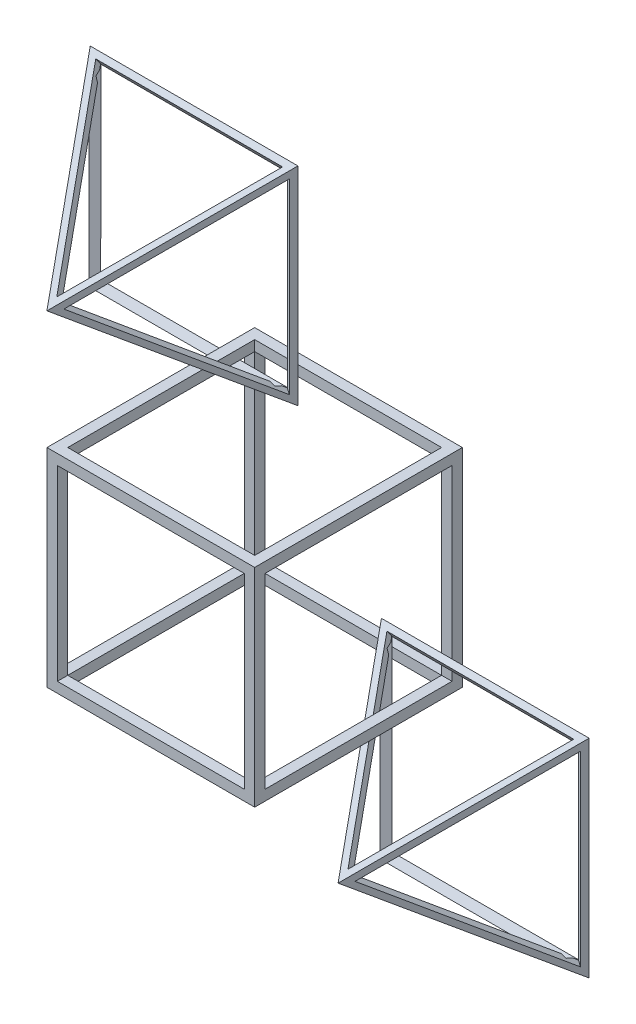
ISO-10303-21;
HEADER;
FILE_DESCRIPTION(('STEP AP214'),'2;1');
FILE_NAME('part.step','',(''),(''),'','','');
FILE_SCHEMA(('AUTOMOTIVE_DESIGN { 1 0 10303 214 1 1 1 1 }'));
ENDSEC;
DATA;
#1=APPLICATION_CONTEXT('core data for automotive mechanical design processes');
#2=APPLICATION_PROTOCOL_DEFINITION('international standard','automotive_design',2000,#1);
#3=PRODUCT_CONTEXT('',#1,'mechanical');
#4=PRODUCT('Part','Part','',(#3));
#5=PRODUCT_RELATED_PRODUCT_CATEGORY('part','',(#4));
#6=PRODUCT_DEFINITION_FORMATION('','',#4);
#7=PRODUCT_DEFINITION_CONTEXT('part definition',#1,'design');
#8=PRODUCT_DEFINITION('design','',#6,#7);
#9=PRODUCT_DEFINITION_SHAPE('','',#8);
#10=(LENGTH_UNIT() NAMED_UNIT(*) SI_UNIT(.MILLI.,.METRE.));
#11=(NAMED_UNIT(*) PLANE_ANGLE_UNIT() SI_UNIT($,.RADIAN.));
#12=(NAMED_UNIT(*) SI_UNIT($,.STERADIAN.) SOLID_ANGLE_UNIT());
#13=UNCERTAINTY_MEASURE_WITH_UNIT(LENGTH_MEASURE(1.E-05),#10,'distance_accuracy_value','');
#14=(GEOMETRIC_REPRESENTATION_CONTEXT(3) GLOBAL_UNCERTAINTY_ASSIGNED_CONTEXT((#13)) GLOBAL_UNIT_ASSIGNED_CONTEXT((#10,
#11,#12)) REPRESENTATION_CONTEXT('',''));
#15=CARTESIAN_POINT('',(0.,0.,0.));
#16=DIRECTION('',(0.,0.,1.));
#17=DIRECTION('',(1.,0.,0.));
#18=AXIS2_PLACEMENT_3D('',#15,#16,#17);
#19=CARTESIAN_POINT('',(49.6564064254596,-50.3193784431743,5.26888157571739));
#20=DIRECTION('',(-0.287871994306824,0.866369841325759,0.408084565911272));
#21=DIRECTION('',(0.,-0.426122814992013,0.904665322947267));
#22=AXIS2_PLACEMENT_3D('',#19,#20,#21);
#23=PLANE('',#22);
#24=DIRECTION('',(0.948984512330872,0.31532268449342,0.));
#25=VECTOR('',#24,1.);
#26=CARTESIAN_POINT('',(49.9671162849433,-51.2544803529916,7.47329907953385));
#27=LINE('',#26,#25);
#28=CARTESIAN_POINT('',(48.5721259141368,-51.7179990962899,7.47329907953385));
#29=VERTEX_POINT('',#28);
#30=CARTESIAN_POINT('',(49.5122057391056,-51.4056352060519,7.47329907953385));
#31=VERTEX_POINT('',#30);
#32=EDGE_CURVE('E366',#29,#31,#27,.T.);
#33=ORIENTED_EDGE('',*,*,#32,.T.);
#34=DIRECTION('',(0.,0.426122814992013,-0.904665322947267));
#35=VECTOR('',#34,1.);
#36=CARTESIAN_POINT('',(49.5122057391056,-50.3585922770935,5.25041075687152));
#37=LINE('',#36,#35);
#38=CARTESIAN_POINT('',(49.5122057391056,-50.780162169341,6.145410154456));
#39=VERTEX_POINT('',#38);
#40=EDGE_CURVE('E568',#31,#39,#37,.T.);
#41=ORIENTED_EDGE('',*,*,#40,.T.);
#42=DIRECTION('',(0.500596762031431,0.499402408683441,-0.707106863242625));
#43=VECTOR('',#42,1.);
#44=CARTESIAN_POINT('',(49.9738071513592,-50.3196620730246,5.4933853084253));
#45=LINE('',#44,#43);
#46=CARTESIAN_POINT('',(49.9669110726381,-50.3265416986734,5.50312621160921));
#47=VERTEX_POINT('',#46);
#48=EDGE_CURVE('E618',#39,#47,#45,.T.);
#49=ORIENTED_EDGE('',*,*,#48,.T.);
#50=DIRECTION('',(-0.956410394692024,-0.238246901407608,-0.168871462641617));
#51=VECTOR('',#50,1.);
#52=CARTESIAN_POINT('',(49.6466852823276,-50.4063116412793,5.44658458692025));
#53=LINE('',#52,#51);
#54=CARTESIAN_POINT('',(49.7979838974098,-50.3686223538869,5.47329907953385));
#55=VERTEX_POINT('',#54);
#56=EDGE_CURVE('E473',#47,#55,#53,.T.);
#57=ORIENTED_EDGE('',*,*,#56,.T.);
#58=DIRECTION('',(0.948984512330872,0.31532268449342,0.));
#59=VECTOR('',#58,1.);
#60=CARTESIAN_POINT('',(4.36784603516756,-65.4638666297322,5.47329907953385));
#61=LINE('',#60,#59);
#62=CARTESIAN_POINT('',(49.9461867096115,-50.3193784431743,5.47329907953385));
#63=VERTEX_POINT('',#62);
#64=EDGE_CURVE('E465',#55,#63,#61,.T.);
#65=ORIENTED_EDGE('',*,*,#64,.T.);
#66=DIRECTION('',(0.817144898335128,0.,0.576432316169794));
#67=VECTOR('',#66,1.);
#68=CARTESIAN_POINT('',(49.6564064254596,-50.3193784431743,5.26888157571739));
#69=LINE('',#68,#67);
#70=CARTESIAN_POINT('',(51.2906962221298,-50.3193784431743,6.42174620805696));
#71=VERTEX_POINT('',#70);
#72=EDGE_CURVE('E448',#63,#71,#69,.T.);
#73=ORIENTED_EDGE('',*,*,#72,.T.);
#74=DIRECTION('',(-0.499403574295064,-0.499402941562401,0.707949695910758));
#75=VECTOR('',#74,1.);
#76=CARTESIAN_POINT('',(51.2906962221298,-50.3193784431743,6.42174620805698));
#77=LINE('',#76,#75);
#78=CARTESIAN_POINT('',(33.3121675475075,-68.2978843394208,31.9079352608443));
#79=VERTEX_POINT('',#78);
#80=EDGE_CURVE('E445',#71,#79,#77,.T.);
#81=ORIENTED_EDGE('',*,*,#80,.T.);
#82=DIRECTION('',(0.817144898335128,0.,0.576432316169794));
#83=VECTOR('',#82,1.);
#84=CARTESIAN_POINT('',(31.6778777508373,-68.2978843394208,30.7550706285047));
#85=LINE('',#84,#83);
#86=CARTESIAN_POINT('',(31.9525887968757,-68.2978843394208,30.9488579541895));
#87=VERTEX_POINT('',#86);
#88=EDGE_CURVE('E453',#87,#79,#85,.T.);
#89=ORIENTED_EDGE('',*,*,#88,.F.);
#90=CARTESIAN_POINT('',(31.9597414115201,-68.2907487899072,30.9387546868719));
#91=VERTEX_POINT('',#90);
#92=EDGE_CURVE('E560',#87,#91,#45,.T.);
#93=ORIENTED_EDGE('',*,*,#92,.T.);
#94=DIRECTION('',(-0.316755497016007,0.31600066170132,-0.89432071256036));
#95=VECTOR('',#94,1.);
#96=CARTESIAN_POINT('',(31.8816431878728,-68.2128366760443,30.7182538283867));
#97=LINE('',#96,#95);
#98=CARTESIAN_POINT('',(31.9597520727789,-68.29075942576,30.9387847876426));
#99=VERTEX_POINT('',#98);
#100=EDGE_CURVE('E468',#99,#91,#97,.T.);
#101=ORIENTED_EDGE('',*,*,#100,.F.);
#102=DIRECTION('',(-0.239730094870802,-0.477747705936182,0.845154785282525));
#103=VECTOR('',#102,1.);
#104=CARTESIAN_POINT('',(36.1646774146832,-59.9109461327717,16.114560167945));
#105=LINE('',#104,#103);
#106=CARTESIAN_POINT('',(31.9597734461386,-68.2907168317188,30.9387094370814));
#107=VERTEX_POINT('',#106);
#108=EDGE_CURVE('E466',#107,#99,#105,.T.);
#109=ORIENTED_EDGE('',*,*,#108,.F.);
#110=EDGE_CURVE('E608',#107,#29,#45,.T.);
#111=ORIENTED_EDGE('',*,*,#110,.T.);
#112=EDGE_LOOP('',(#33,#41,#49,#57,#65,#73,#81,#89,#93,#101,#109,#111));
#113=FACE_BOUND('',#112,.T.);
#114=ADVANCED_FACE('F45',(#113),#23,.F.);
#115=CARTESIAN_POINT('',(31.6778777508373,-68.2978843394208,30.7550706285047));
#116=DIRECTION('',(-0.288560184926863,-0.865680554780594,0.409060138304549));
#117=DIRECTION('',(0.,-0.427233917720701,-0.904141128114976));
#118=AXIS2_PLACEMENT_3D('',#115,#116,#117);
#119=PLANE('',#118);
#120=DIRECTION('',(0.499999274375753,-0.500596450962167,-0.706685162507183));
#121=VECTOR('',#120,1.);
#122=CARTESIAN_POINT('',(49.9594171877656,-86.3226269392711,5.50610646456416));
#123=LINE('',#122,#121);
#124=CARTESIAN_POINT('',(49.5020011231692,-85.8646645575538,6.15260569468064));
#125=VERTEX_POINT('',#124);
#126=CARTESIAN_POINT('',(49.9561640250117,-86.3193698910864,5.51070439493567));
#127=VERTEX_POINT('',#126);
#128=EDGE_CURVE('E541',#125,#127,#123,.T.);
#129=ORIENTED_EDGE('',*,*,#128,.F.);
#130=DIRECTION('',(0.817144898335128,0.,0.576432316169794));
#131=VECTOR('',#130,1.);
#132=CARTESIAN_POINT('',(49.1888420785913,-85.8646645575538,5.93169628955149));
#133=LINE('',#132,#131);
#134=CARTESIAN_POINT('',(49.5122057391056,-85.8646645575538,6.15980425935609));
#135=VERTEX_POINT('',#134);
#136=EDGE_CURVE('E338',#125,#135,#133,.T.);
#137=ORIENTED_EDGE('',*,*,#136,.T.);
#138=DIRECTION('',(0.,0.427233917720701,0.904141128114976));
#139=VECTOR('',#138,1.);
#140=CARTESIAN_POINT('',(49.5122057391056,-73.1575673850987,33.051417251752));
#141=LINE('',#140,#139);
#142=CARTESIAN_POINT('',(49.5122057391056,-85.2439986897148,7.47329907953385));
#143=VERTEX_POINT('',#142);
#144=EDGE_CURVE('E565',#135,#143,#141,.T.);
#145=ORIENTED_EDGE('',*,*,#144,.T.);
#146=DIRECTION('',(-0.948683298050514,0.316227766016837,0.));
#147=VECTOR('',#146,1.);
#148=CARTESIAN_POINT('',(28.3774762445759,-78.1990888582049,7.47329907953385));
#149=LINE('',#148,#147);
#150=CARTESIAN_POINT('',(48.567574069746,-84.9291214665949,7.47329907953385));
#151=VERTEX_POINT('',#150);
#152=EDGE_CURVE('E349',#143,#151,#149,.T.);
#153=ORIENTED_EDGE('',*,*,#152,.T.);
#154=CARTESIAN_POINT('',(32.0026462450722,-68.3444092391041,30.8857104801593));
#155=VERTEX_POINT('',#154);
#156=EDGE_CURVE('E347',#155,#151,#123,.T.);
#157=ORIENTED_EDGE('',*,*,#156,.F.);
#158=DIRECTION('',(0.00204085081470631,0.426676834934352,0.904401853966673));
#159=VECTOR('',#158,1.);
#160=CARTESIAN_POINT('',(32.0024442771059,-68.3866343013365,30.7962084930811));
#161=LINE('',#160,#159);
#162=CARTESIAN_POINT('',(32.0027317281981,-68.3265374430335,30.9235922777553));
#163=VERTEX_POINT('',#162);
#164=EDGE_CURVE('E454',#155,#163,#161,.T.);
#165=ORIENTED_EDGE('',*,*,#164,.T.);
#166=DIRECTION('',(-0.948683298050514,0.316227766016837,0.));
#167=VECTOR('',#166,1.);
#168=CARTESIAN_POINT('',(31.7017672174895,-68.226215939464,30.9235922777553));
#169=LINE('',#168,#167);
#170=CARTESIAN_POINT('',(31.9758438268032,-68.3175748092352,30.9235922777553));
#171=VERTEX_POINT('',#170);
#172=EDGE_CURVE('E546',#163,#171,#169,.T.);
#173=ORIENTED_EDGE('',*,*,#172,.T.);
#174=CARTESIAN_POINT('',(31.9597520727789,-68.3014638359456,30.9463359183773));
#175=VERTEX_POINT('',#174);
#176=EDGE_CURVE('E537',#175,#171,#123,.T.);
#177=ORIENTED_EDGE('',*,*,#176,.F.);
#178=DIRECTION('',(0.478351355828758,0.239746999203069,0.84480847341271));
#179=VECTOR('',#178,1.);
#180=CARTESIAN_POINT('',(31.9135545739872,-68.3246177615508,30.8647472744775));
#181=LINE('',#180,#179);
#182=CARTESIAN_POINT('',(31.9554553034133,-68.303617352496,30.9387474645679));
#183=VERTEX_POINT('',#182);
#184=EDGE_CURVE('E474',#183,#175,#181,.T.);
#185=ORIENTED_EDGE('',*,*,#184,.F.);
#186=DIRECTION('',(-0.239453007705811,0.478906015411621,0.844577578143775));
#187=VECTOR('',#186,1.);
#188=CARTESIAN_POINT('',(31.9760283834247,-68.3447635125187,30.8661839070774));
#189=LINE('',#188,#187);
#190=EDGE_CURVE('E449',#183,#87,#189,.T.);
#191=ORIENTED_EDGE('',*,*,#190,.T.);
#192=ORIENTED_EDGE('',*,*,#88,.T.);
#193=DIRECTION('',(0.499006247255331,-0.5005968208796,-0.707386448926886));
#194=VECTOR('',#193,1.);
#195=CARTESIAN_POINT('',(33.3121675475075,-68.2978843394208,31.9079352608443));
#196=LINE('',#195,#194);
#197=CARTESIAN_POINT('',(51.2763924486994,-86.3193698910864,6.44202309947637));
#198=VERTEX_POINT('',#197);
#199=EDGE_CURVE('E450',#79,#198,#196,.T.);
#200=ORIENTED_EDGE('',*,*,#199,.T.);
#201=DIRECTION('',(0.817144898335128,0.,0.576432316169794));
#202=VECTOR('',#201,1.);
#203=CARTESIAN_POINT('',(49.6421026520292,-86.3193698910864,5.28915846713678));
#204=LINE('',#203,#202);
#205=EDGE_CURVE('E443',#127,#198,#204,.T.);
#206=ORIENTED_EDGE('',*,*,#205,.F.);
#207=EDGE_LOOP('',(#129,#137,#145,#153,#157,#165,#173,#177,#185,#191,#192,#200,#206));
#208=FACE_BOUND('',#207,.T.);
#209=ADVANCED_FACE('F651',(#208),#119,.F.);
#210=CARTESIAN_POINT('',(32.2416263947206,-68.3265374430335,30.7550706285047));
#211=DIRECTION('',(0.288560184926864,0.865680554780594,0.409060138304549));
#212=DIRECTION('',(0.,-0.427233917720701,0.904141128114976));
#213=AXIS2_PLACEMENT_3D('',#210,#211,#212);
#214=PLANE('',#213);
#215=DIRECTION('',(0.948683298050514,-0.316227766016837,0.));
#216=VECTOR('',#215,1.);
#217=CARTESIAN_POINT('',(23.5675611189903,-53.4887837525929,5.47329907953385));
#218=LINE('',#217,#216);
#219=CARTESIAN_POINT('',(14.0163655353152,-50.3050518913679,5.47329907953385));
#220=VERTEX_POINT('',#219);
#221=CARTESIAN_POINT('',(14.0789404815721,-50.3259102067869,5.47329907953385));
#222=VERTEX_POINT('',#221);
#223=EDGE_CURVE('E600',#220,#222,#218,.T.);
#224=ORIENTED_EDGE('',*,*,#223,.T.);
#225=DIRECTION('',(-0.956279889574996,0.239355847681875,0.168040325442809));
#226=VECTOR('',#225,1.);
#227=CARTESIAN_POINT('',(30.7457605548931,-54.4975976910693,2.544556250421));
#228=LINE('',#227,#226);
#229=CARTESIAN_POINT('',(13.9956068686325,-50.3050518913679,5.48794270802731));
#230=VERTEX_POINT('',#229);
#231=EDGE_CURVE('E597',#222,#230,#228,.T.);
#232=ORIENTED_EDGE('',*,*,#231,.T.);
#233=DIRECTION('',(-0.817144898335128,0.,0.576432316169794));
#234=VECTOR('',#233,1.);
#235=CARTESIAN_POINT('',(14.2774014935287,-50.3050518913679,5.28915846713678));
#236=LINE('',#235,#234);
#237=EDGE_CURVE('E555',#220,#230,#236,.T.);
#238=ORIENTED_EDGE('',*,*,#237,.F.);
#239=EDGE_LOOP('',(#224,#232,#238));
#240=FACE_BOUND('',#239,.T.);
#241=ADVANCED_FACE('F723',(#240),#214,.F.);
#242=CARTESIAN_POINT('',(14.2774014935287,-50.3050518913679,5.28915846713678));
#243=DIRECTION('',(-0.576432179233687,0.000689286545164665,-0.817144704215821));
#244=DIRECTION('',(0.817144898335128,0.,-0.576432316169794));
#245=AXIS2_PLACEMENT_3D('',#242,#243,#244);
#246=PLANE('',#245);
#247=ORIENTED_EDGE('',*,*,#237,.T.);
#248=DIRECTION('',(0.631999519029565,-0.633512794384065,-0.446361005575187));
#249=VECTOR('',#248,1.);
#250=CARTESIAN_POINT('',(14.1642392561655,-50.4740880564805,5.3688430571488));
#251=LINE('',#250,#249);
#252=CARTESIAN_POINT('',(14.0163406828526,-50.3258353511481,5.47329907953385));
#253=VERTEX_POINT('',#252);
#254=EDGE_CURVE('E552',#230,#253,#251,.T.);
#255=ORIENTED_EDGE('',*,*,#254,.T.);
#256=DIRECTION('',(0.0011957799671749,0.999999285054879,0.));
#257=VECTOR('',#256,1.);
#258=CARTESIAN_POINT('',(13.9709144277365,-88.3146158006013,5.47329907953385));
#259=LINE('',#258,#257);
#260=EDGE_CURVE('E439',#253,#220,#259,.T.);
#261=ORIENTED_EDGE('',*,*,#260,.T.);
#262=EDGE_LOOP('',(#247,#255,#261));
#263=FACE_BOUND('',#262,.T.);
#264=ADVANCED_FACE('F802',(#263),#246,.F.);
#265=CARTESIAN_POINT('',(13.9597520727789,-86.0017147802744,5.27901800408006));
#266=DIRECTION('',(0.,-0.576432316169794,-0.817144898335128));
#267=DIRECTION('',(0.,0.817144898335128,-0.576432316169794));
#268=AXIS2_PLACEMENT_3D('',#265,#266,#267);
#269=PLANE('',#268);
#270=DIRECTION('',(0.,-0.817144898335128,0.576432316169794));
#271=VECTOR('',#270,1.);
#272=CARTESIAN_POINT('',(13.9597520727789,-86.0017147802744,5.27901800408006));
#273=LINE('',#272,#271);
#274=CARTESIAN_POINT('',(13.9597520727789,-86.2771257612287,5.47329907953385));
#275=VERTEX_POINT('',#274);
#276=CARTESIAN_POINT('',(13.9597520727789,-86.2907082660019,5.48288048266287));
#277=VERTEX_POINT('',#276);
#278=EDGE_CURVE('E432',#275,#277,#273,.T.);
#279=ORIENTED_EDGE('',*,*,#278,.T.);
#280=DIRECTION('',(0.633210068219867,0.632453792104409,-0.446147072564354));
#281=VECTOR('',#280,1.);
#282=CARTESIAN_POINT('',(14.1330791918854,-86.1175881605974,5.36075768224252));
#283=LINE('',#282,#281);
#284=CARTESIAN_POINT('',(13.9733508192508,-86.2771257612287,5.47329907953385));
#285=VERTEX_POINT('',#284);
#286=EDGE_CURVE('E429',#277,#285,#283,.T.);
#287=ORIENTED_EDGE('',*,*,#286,.T.);
#288=DIRECTION('',(-1.,0.,0.));
#289=VECTOR('',#288,1.);
#290=CARTESIAN_POINT('',(11.9597520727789,-86.2771257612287,5.47329907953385));
#291=LINE('',#290,#289);
#292=EDGE_CURVE('E433',#285,#275,#291,.T.);
#293=ORIENTED_EDGE('',*,*,#292,.T.);
#294=EDGE_LOOP('',(#279,#287,#293));
#295=FACE_BOUND('',#294,.T.);
#296=ADVANCED_FACE('F819',(#295),#269,.F.);
#297=CARTESIAN_POINT('',(31.9597520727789,-68.0303337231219,30.7550746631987));
#298=DIRECTION('',(-0.866025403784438,0.288216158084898,0.408572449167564));
#299=DIRECTION('',(-0.426678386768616,0.,-0.904403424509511));
#300=AXIS2_PLACEMENT_3D('',#297,#298,#299);
#301=PLANE('',#300);
#302=DIRECTION('',(0.315775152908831,0.948834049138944,0.));
#303=VECTOR('',#302,1.);
#304=CARTESIAN_POINT('',(13.1505756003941,-88.7085209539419,5.47329907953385));
#305=LINE('',#304,#303);
#306=CARTESIAN_POINT('',(13.9733998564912,-86.2361172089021,5.47329907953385));
#307=VERTEX_POINT('',#306);
#308=EDGE_CURVE('E531',#275,#307,#305,.T.);
#309=ORIENTED_EDGE('',*,*,#308,.T.);
#310=DIRECTION('',(-0.239094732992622,-0.956377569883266,0.167856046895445));
#311=VECTOR('',#310,1.);
#312=CARTESIAN_POINT('',(18.1499894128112,-69.5297827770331,2.54113155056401));
#313=LINE('',#312,#311);
#314=EDGE_CURVE('E534',#307,#277,#313,.T.);
#315=ORIENTED_EDGE('',*,*,#314,.T.);
#316=ORIENTED_EDGE('',*,*,#278,.F.);
#317=EDGE_LOOP('',(#309,#315,#316));
#318=FACE_BOUND('',#317,.T.);
#319=ADVANCED_FACE('F711',(#318),#301,.F.);
#320=CARTESIAN_POINT('',(49.9597520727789,-86.0017147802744,5.27901800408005));
#321=DIRECTION('',(0.866025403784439,0.288216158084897,0.408572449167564));
#322=DIRECTION('',(-0.426678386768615,0.,0.904403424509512));
#323=AXIS2_PLACEMENT_3D('',#320,#321,#322);
#324=PLANE('',#323);
#325=DIRECTION('',(0.315775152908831,-0.948834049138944,0.));
#326=VECTOR('',#325,1.);
#327=CARTESIAN_POINT('',(49.0277621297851,-86.3118841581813,7.47329907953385));
#328=LINE('',#327,#326);
#329=CARTESIAN_POINT('',(48.8789259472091,-85.8646645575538,7.47329907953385));
#330=VERTEX_POINT('',#329);
#331=EDGE_CURVE('E324',#151,#330,#328,.T.);
#332=ORIENTED_EDGE('',*,*,#331,.T.);
#333=DIRECTION('',(0.426678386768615,0.,-0.904403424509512));
#334=VECTOR('',#333,1.);
#335=CARTESIAN_POINT('',(49.9224449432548,-85.8646645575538,5.26141729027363));
#336=LINE('',#335,#334);
#337=EDGE_CURVE('E335',#330,#125,#336,.T.);
#338=ORIENTED_EDGE('',*,*,#337,.T.);
#339=ORIENTED_EDGE('',*,*,#128,.T.);
#340=DIRECTION('',(-0.238507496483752,0.956312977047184,-0.169055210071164));
#341=VECTOR('',#340,1.);
#342=CARTESIAN_POINT('',(49.87457306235,-85.9922250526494,5.45287234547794));
#343=LINE('',#342,#341);
#344=CARTESIAN_POINT('',(49.9033916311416,-86.1077751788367,5.47329907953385));
#345=VERTEX_POINT('',#344);
#346=EDGE_CURVE('E530',#127,#345,#343,.T.);
#347=ORIENTED_EDGE('',*,*,#346,.T.);
#348=DIRECTION('',(0.315775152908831,-0.948834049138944,0.));
#349=VECTOR('',#348,1.);
#350=CARTESIAN_POINT('',(46.7803706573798,-76.7237922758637,5.47329907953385));
#351=LINE('',#350,#349);
#352=CARTESIAN_POINT('',(49.9597520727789,-86.2771257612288,5.47329907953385));
#353=VERTEX_POINT('',#352);
#354=EDGE_CURVE('E508',#345,#353,#351,.T.);
#355=ORIENTED_EDGE('',*,*,#354,.T.);
#356=DIRECTION('',(0.,-0.817144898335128,0.576432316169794));
#357=VECTOR('',#356,1.);
#358=CARTESIAN_POINT('',(49.9597520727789,-86.0017147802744,5.27901800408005));
#359=LINE('',#358,#357);
#360=CARTESIAN_POINT('',(49.9597520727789,-87.6360045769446,6.43188263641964));
#361=VERTEX_POINT('',#360);
#362=EDGE_CURVE('E498',#353,#361,#359,.T.);
#363=ORIENTED_EDGE('',*,*,#362,.T.);
#364=DIRECTION('',(-0.5,0.499205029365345,0.707668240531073));
#365=VECTOR('',#364,1.);
#366=CARTESIAN_POINT('',(49.9597520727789,-87.6360045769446,6.43188263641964));
#367=LINE('',#366,#365);
#368=CARTESIAN_POINT('',(31.9597520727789,-69.6646235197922,31.9079392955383));
#369=VERTEX_POINT('',#368);
#370=EDGE_CURVE('E496',#361,#369,#367,.T.);
#371=ORIENTED_EDGE('',*,*,#370,.T.);
#372=DIRECTION('',(0.,-0.817144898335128,0.576432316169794));
#373=VECTOR('',#372,1.);
#374=CARTESIAN_POINT('',(31.9597520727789,-68.0303337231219,30.7550746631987));
#375=LINE('',#374,#373);
#376=EDGE_CURVE('E413',#175,#369,#375,.T.);
#377=ORIENTED_EDGE('',*,*,#376,.F.);
#378=ORIENTED_EDGE('',*,*,#176,.T.);
#379=DIRECTION('',(-0.316302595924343,-0.317058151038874,0.894106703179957));
#380=VECTOR('',#379,1.);
#381=CARTESIAN_POINT('',(39.254106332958,-61.0219266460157,10.3498019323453));
#382=LINE('',#381,#380);
#383=CARTESIAN_POINT('',(31.9669025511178,-68.3265374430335,30.9488669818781));
#384=VERTEX_POINT('',#383);
#385=EDGE_CURVE('E540',#171,#384,#382,.T.);
#386=ORIENTED_EDGE('',*,*,#385,.T.);
#387=DIRECTION('',(0.47825380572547,-0.239126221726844,-0.845039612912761));
#388=VECTOR('',#387,1.);
#389=CARTESIAN_POINT('',(48.4780347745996,-76.5820800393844,1.77489990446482));
#390=LINE('',#389,#388);
#391=EDGE_CURVE('E418',#384,#155,#390,.T.);
#392=ORIENTED_EDGE('',*,*,#391,.T.);
#393=ORIENTED_EDGE('',*,*,#156,.T.);
#394=EDGE_LOOP('',(#332,#338,#339,#347,#355,#363,#371,#377,#378,#386,#392,#393));
#395=FACE_BOUND('',#394,.T.);
#396=ADVANCED_FACE('F344',(#395),#324,.F.);
#397=CARTESIAN_POINT('',(11.9597520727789,-88.3122108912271,5.47329907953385));
#398=DIRECTION('',(-0.817144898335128,0.,0.576432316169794));
#399=DIRECTION('',(-0.576432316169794,0.,-0.817144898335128));
#400=AXIS2_PLACEMENT_3D('',#397,#398,#399);
#401=PLANE('',#400);
#402=DIRECTION('',(0.499403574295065,0.499402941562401,0.707949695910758));
#403=VECTOR('',#402,1.);
#404=CARTESIAN_POINT('',(12.628807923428,-86.30504333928,6.42174620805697));
#405=LINE('',#404,#403);
#406=CARTESIAN_POINT('',(12.628807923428,-86.30504333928,6.42174620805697));
#407=VERTEX_POINT('',#406);
#408=CARTESIAN_POINT('',(30.6073365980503,-68.3265374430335,31.9079352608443));
#409=VERTEX_POINT('',#408);
#410=EDGE_CURVE('E437',#407,#409,#405,.T.);
#411=ORIENTED_EDGE('',*,*,#410,.F.);
#412=DIRECTION('',(-0.000397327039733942,-0.999999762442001,-0.000563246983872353));
#413=VECTOR('',#412,1.);
#414=CARTESIAN_POINT('',(12.6431116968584,-50.3050518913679,6.44202309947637));
#415=LINE('',#414,#413);
#416=CARTESIAN_POINT('',(12.6431116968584,-50.3050518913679,6.44202309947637));
#417=VERTEX_POINT('',#416);
#418=EDGE_CURVE('E629',#417,#407,#415,.T.);
#419=ORIENTED_EDGE('',*,*,#418,.F.);
#420=DIRECTION('',(-0.49900624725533,0.5005968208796,-0.707386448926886));
#421=VECTOR('',#420,1.);
#422=CARTESIAN_POINT('',(30.6073365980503,-68.3265374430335,31.9079352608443));
#423=LINE('',#422,#421);
#424=EDGE_CURVE('E427',#409,#417,#423,.T.);
#425=ORIENTED_EDGE('',*,*,#424,.F.);
#426=EDGE_LOOP('',(#411,#419,#425));
#427=FACE_BOUND('',#426,.T.);
#428=DIRECTION('',(0.,-1.,0.));
#429=VECTOR('',#428,1.);
#430=CARTESIAN_POINT('',(11.9597520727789,-88.3122108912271,5.47329907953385));
#431=LINE('',#430,#429);
#432=CARTESIAN_POINT('',(11.9597520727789,-48.3122108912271,5.47329907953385));
#433=VERTEX_POINT('',#432);
#434=CARTESIAN_POINT('',(11.9597520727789,-88.3122108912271,5.47329907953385));
#435=VERTEX_POINT('',#434);
#436=EDGE_CURVE('E499',#433,#435,#431,.T.);
#437=ORIENTED_EDGE('',*,*,#436,.T.);
#438=DIRECTION('',(-0.499403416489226,-0.499403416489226,-0.707949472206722));
#439=VECTOR('',#438,1.);
#440=CARTESIAN_POINT('',(11.9597520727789,-88.3122108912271,5.47329907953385));
#441=LINE('',#440,#439);
#442=CARTESIAN_POINT('',(31.9597520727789,-68.3122108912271,33.8251064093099));
#443=VERTEX_POINT('',#442);
#444=EDGE_CURVE('E515',#443,#435,#441,.T.);
#445=ORIENTED_EDGE('',*,*,#444,.F.);
#446=DIRECTION('',(-0.499403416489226,0.499403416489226,-0.707949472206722));
#447=VECTOR('',#446,1.);
#448=CARTESIAN_POINT('',(21.9359029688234,-58.2883617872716,19.6153944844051));
#449=LINE('',#448,#447);
#450=EDGE_CURVE('E511',#443,#433,#449,.T.);
#451=ORIENTED_EDGE('',*,*,#450,.T.);
#452=EDGE_LOOP('',(#437,#445,#451));
#453=FACE_BOUND('',#452,.T.);
#454=ADVANCED_FACE('F694',(#427,#453),#401,.T.);
#455=CARTESIAN_POINT('',(11.9597520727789,-88.3122108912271,5.47329907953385));
#456=DIRECTION('',(0.,-0.817144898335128,0.576432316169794));
#457=DIRECTION('',(0.,-0.576432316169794,-0.817144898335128));
#458=AXIS2_PLACEMENT_3D('',#455,#456,#457);
#459=PLANE('',#458);
#460=ORIENTED_EDGE('',*,*,#370,.F.);
#461=DIRECTION('',(1.,0.,0.));
#462=VECTOR('',#461,1.);
#463=CARTESIAN_POINT('',(13.9597520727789,-87.6360045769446,6.43188263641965));
#464=LINE('',#463,#462);
#465=CARTESIAN_POINT('',(13.9597520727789,-87.6360045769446,6.43188263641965));
#466=VERTEX_POINT('',#465);
#467=EDGE_CURVE('E494',#466,#361,#464,.T.);
#468=ORIENTED_EDGE('',*,*,#467,.F.);
#469=DIRECTION('',(-0.5,-0.499205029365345,-0.707668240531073));
#470=VECTOR('',#469,1.);
#471=CARTESIAN_POINT('',(31.9597520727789,-69.6646235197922,31.9079392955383));
#472=LINE('',#471,#470);
#473=EDGE_CURVE('E409',#369,#466,#472,.T.);
#474=ORIENTED_EDGE('',*,*,#473,.F.);
#475=EDGE_LOOP('',(#460,#468,#474));
#476=FACE_BOUND('',#475,.T.);
#477=DIRECTION('',(1.,0.,0.));
#478=VECTOR('',#477,1.);
#479=CARTESIAN_POINT('',(11.9597520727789,-88.3122108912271,5.47329907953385));
#480=LINE('',#479,#478);
#481=CARTESIAN_POINT('',(51.9597520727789,-88.3122108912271,5.47329907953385));
#482=VERTEX_POINT('',#481);
#483=EDGE_CURVE('E512',#435,#482,#480,.T.);
#484=ORIENTED_EDGE('',*,*,#483,.T.);
#485=DIRECTION('',(0.499403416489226,-0.499403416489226,-0.707949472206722));
#486=VECTOR('',#485,1.);
#487=CARTESIAN_POINT('',(51.9597520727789,-88.3122108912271,5.47329907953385));
#488=LINE('',#487,#486);
#489=EDGE_CURVE('E519',#443,#482,#488,.T.);
#490=ORIENTED_EDGE('',*,*,#489,.F.);
#491=ORIENTED_EDGE('',*,*,#444,.T.);
#492=EDGE_LOOP('',(#484,#490,#491));
#493=FACE_BOUND('',#492,.T.);
#494=ADVANCED_FACE('F691',(#476,#493),#459,.T.);
#495=CARTESIAN_POINT('',(51.9597520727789,-88.3122108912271,5.47329907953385));
#496=DIRECTION('',(0.817144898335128,0.,0.576432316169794));
#497=DIRECTION('',(-0.576432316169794,0.,0.817144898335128));
#498=AXIS2_PLACEMENT_3D('',#495,#496,#497);
#499=PLANE('',#498);
#500=ORIENTED_EDGE('',*,*,#80,.F.);
#501=DIRECTION('',(0.000397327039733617,0.999999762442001,-0.000563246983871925));
#502=VECTOR('',#501,1.);
#503=CARTESIAN_POINT('',(51.2763924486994,-86.3193698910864,6.44202309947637));
#504=LINE('',#503,#502);
#505=EDGE_CURVE('E441',#198,#71,#504,.T.);
#506=ORIENTED_EDGE('',*,*,#505,.F.);
#507=ORIENTED_EDGE('',*,*,#199,.F.);
#508=EDGE_LOOP('',(#500,#506,#507));
#509=FACE_BOUND('',#508,.T.);
#510=DIRECTION('',(0.,1.,0.));
#511=VECTOR('',#510,1.);
#512=CARTESIAN_POINT('',(51.9597520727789,-88.3122108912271,5.47329907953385));
#513=LINE('',#512,#511);
#514=CARTESIAN_POINT('',(51.9597520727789,-48.3122108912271,5.47329907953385));
#515=VERTEX_POINT('',#514);
#516=EDGE_CURVE('E516',#482,#515,#513,.T.);
#517=ORIENTED_EDGE('',*,*,#516,.T.);
#518=DIRECTION('',(0.499403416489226,0.499403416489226,-0.707949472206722));
#519=VECTOR('',#518,1.);
#520=CARTESIAN_POINT('',(41.9836011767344,-58.2883617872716,19.6153944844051));
#521=LINE('',#520,#519);
#522=EDGE_CURVE('E523',#443,#515,#521,.T.);
#523=ORIENTED_EDGE('',*,*,#522,.F.);
#524=ORIENTED_EDGE('',*,*,#489,.T.);
#525=EDGE_LOOP('',(#517,#523,#524));
#526=FACE_BOUND('',#525,.T.);
#527=ADVANCED_FACE('F670',(#509,#526),#499,.T.);
#528=CARTESIAN_POINT('',(11.9597520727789,-48.3122108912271,5.47329907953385));
#529=DIRECTION('',(0.,0.817144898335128,0.576432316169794));
#530=DIRECTION('',(0.,-0.576432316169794,0.817144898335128));
#531=AXIS2_PLACEMENT_3D('',#528,#529,#530);
#532=PLANE('',#531);
#533=DIRECTION('',(0.499402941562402,-0.499403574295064,0.707949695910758));
#534=VECTOR('',#533,1.);
#535=CARTESIAN_POINT('',(13.9669196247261,-48.9812667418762,6.42174620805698));
#536=LINE('',#535,#534);
#537=CARTESIAN_POINT('',(13.9669196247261,-48.9812667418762,6.42174620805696));
#538=VERTEX_POINT('',#537);
#539=CARTESIAN_POINT('',(31.9454255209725,-66.9597954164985,31.9079352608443));
#540=VERTEX_POINT('',#539);
#541=EDGE_CURVE('E752',#538,#540,#536,.T.);
#542=ORIENTED_EDGE('',*,*,#541,.F.);
#543=DIRECTION('',(-0.999999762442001,0.000397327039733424,-0.00056324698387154));
#544=VECTOR('',#543,1.);
#545=CARTESIAN_POINT('',(49.9669110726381,-48.9955705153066,6.44202309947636));
#546=LINE('',#545,#544);
#547=CARTESIAN_POINT('',(49.9669110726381,-48.9955705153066,6.44202309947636));
#548=VERTEX_POINT('',#547);
#549=EDGE_CURVE('E757',#548,#538,#546,.T.);
#550=ORIENTED_EDGE('',*,*,#549,.F.);
#551=DIRECTION('',(0.5005968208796,0.499006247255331,-0.707386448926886));
#552=VECTOR('',#551,1.);
#553=CARTESIAN_POINT('',(31.9454255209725,-66.9597954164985,31.9079352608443));
#554=LINE('',#553,#552);
#555=EDGE_CURVE('E748',#540,#548,#554,.T.);
#556=ORIENTED_EDGE('',*,*,#555,.F.);
#557=EDGE_LOOP('',(#542,#550,#556));
#558=FACE_BOUND('',#557,.T.);
#559=DIRECTION('',(-1.,0.,0.));
#560=VECTOR('',#559,1.);
#561=CARTESIAN_POINT('',(11.9597520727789,-48.3122108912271,5.47329907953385));
#562=LINE('',#561,#560);
#563=EDGE_CURVE('E520',#515,#433,#562,.T.);
#564=ORIENTED_EDGE('',*,*,#563,.T.);
#565=ORIENTED_EDGE('',*,*,#450,.F.);
#566=ORIENTED_EDGE('',*,*,#522,.T.);
#567=EDGE_LOOP('',(#564,#565,#566));
#568=FACE_BOUND('',#567,.T.);
#569=ADVANCED_FACE('F703',(#558,#568),#532,.T.);
#570=CARTESIAN_POINT('',(11.9597520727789,-88.3122108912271,5.47329907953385));
#571=DIRECTION('',(0.,0.,-1.));
#572=DIRECTION('',(0.,1.,0.));
#573=AXIS2_PLACEMENT_3D('',#570,#571,#572);
#574=PLANE('',#573);
#575=DIRECTION('',(0.999999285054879,-0.00119577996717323,0.));
#576=VECTOR('',#575,1.);
#577=CARTESIAN_POINT('',(12.005178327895,-50.3234304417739,5.47329907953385));
#578=LINE('',#577,#576);
#579=EDGE_CURVE('E601',#222,#55,#578,.T.);
#580=ORIENTED_EDGE('',*,*,#579,.F.);
#581=ORIENTED_EDGE('',*,*,#223,.F.);
#582=ORIENTED_EDGE('',*,*,#260,.F.);
#583=CARTESIAN_POINT('',(13.9669196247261,-50.3257762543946,5.47329907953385));
#584=VERTEX_POINT('',#583);
#585=EDGE_CURVE('E603',#584,#253,#578,.T.);
#586=ORIENTED_EDGE('',*,*,#585,.F.);
#587=DIRECTION('',(-0.31532268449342,0.948984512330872,0.));
#588=VECTOR('',#587,1.);
#589=CARTESIAN_POINT('',(25.1342719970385,-83.9346631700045,5.47329907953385));
#590=LINE('',#589,#588);
#591=CARTESIAN_POINT('',(14.0161635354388,-50.4739790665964,5.47329907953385));
#592=VERTEX_POINT('',#591);
#593=EDGE_CURVE('E592',#592,#584,#590,.T.);
#594=ORIENTED_EDGE('',*,*,#593,.F.);
#595=EDGE_CURVE('E434',#307,#592,#259,.T.);
#596=ORIENTED_EDGE('',*,*,#595,.F.);
#597=ORIENTED_EDGE('',*,*,#308,.F.);
#598=ORIENTED_EDGE('',*,*,#292,.F.);
#599=CARTESIAN_POINT('',(13.9733174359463,-86.30504333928,5.47329907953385));
#600=VERTEX_POINT('',#599);
#601=EDGE_CURVE('E440',#600,#285,#259,.T.);
#602=ORIENTED_EDGE('',*,*,#601,.F.);
#603=DIRECTION('',(-0.948984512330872,-0.31532268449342,0.));
#604=VECTOR('',#603,1.);
#605=CARTESIAN_POINT('',(11.5593401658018,-87.1071447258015,5.47329907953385));
#606=LINE('',#605,#604);
#607=CARTESIAN_POINT('',(14.0573372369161,-86.2771257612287,5.47329907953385));
#608=VERTEX_POINT('',#607);
#609=EDGE_CURVE('E425',#608,#600,#606,.T.);
#610=ORIENTED_EDGE('',*,*,#609,.F.);
#611=CARTESIAN_POINT('',(49.7764062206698,-86.2771257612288,5.47329907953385));
#612=VERTEX_POINT('',#611);
#613=EDGE_CURVE('E423',#612,#608,#291,.T.);
#614=ORIENTED_EDGE('',*,*,#613,.F.);
#615=DIRECTION('',(-0.948683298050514,0.316227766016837,0.));
#616=VECTOR('',#615,1.);
#617=CARTESIAN_POINT('',(16.3519430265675,-75.1356380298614,5.47329907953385));
#618=LINE('',#617,#616);
#619=CARTESIAN_POINT('',(49.9031386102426,-86.3193698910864,5.47329907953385));
#620=VERTEX_POINT('',#619);
#621=EDGE_CURVE('E482',#620,#612,#618,.T.);
#622=ORIENTED_EDGE('',*,*,#621,.F.);
#623=DIRECTION('',(-0.00119577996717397,-0.999999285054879,0.));
#624=VECTOR('',#623,1.);
#625=CARTESIAN_POINT('',(49.9007013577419,-88.357579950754,5.47329907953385));
#626=LINE('',#625,#624);
#627=CARTESIAN_POINT('',(49.9031891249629,-86.2771257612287,5.47329907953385));
#628=VERTEX_POINT('',#627);
#629=EDGE_CURVE('E490',#628,#620,#626,.T.);
#630=ORIENTED_EDGE('',*,*,#629,.F.);
#631=EDGE_CURVE('E493',#353,#628,#291,.T.);
#632=ORIENTED_EDGE('',*,*,#631,.F.);
#633=ORIENTED_EDGE('',*,*,#354,.F.);
#634=CARTESIAN_POINT('',(49.9460527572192,-50.4313993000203,5.47329907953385));
#635=VERTEX_POINT('',#634);
#636=EDGE_CURVE('E456',#635,#345,#626,.T.);
#637=ORIENTED_EDGE('',*,*,#636,.F.);
#638=DIRECTION('',(-0.316227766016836,-0.948683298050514,0.));
#639=VECTOR('',#638,1.);
#640=CARTESIAN_POINT('',(34.7831792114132,-95.9200199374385,5.47329907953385));
#641=LINE('',#640,#639);
#642=CARTESIAN_POINT('',(49.9669110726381,-50.3688243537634,5.47329907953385));
#643=VERTEX_POINT('',#642);
#644=EDGE_CURVE('E625',#643,#635,#641,.T.);
#645=ORIENTED_EDGE('',*,*,#644,.F.);
#646=CARTESIAN_POINT('',(49.946127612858,-50.3687995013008,5.47329907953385));
#647=VERTEX_POINT('',#646);
#648=EDGE_CURVE('E605',#647,#643,#578,.T.);
#649=ORIENTED_EDGE('',*,*,#648,.F.);
#650=EDGE_CURVE('E485',#63,#647,#626,.T.);
#651=ORIENTED_EDGE('',*,*,#650,.F.);
#652=ORIENTED_EDGE('',*,*,#64,.F.);
#653=EDGE_LOOP('',(#580,#581,#582,#586,#594,#596,#597,#598,#602,#610,#614,#622,#630,#632,#633,
#637,#645,#649,#651,#652));
#654=FACE_BOUND('',#653,.T.);
#655=ORIENTED_EDGE('',*,*,#436,.F.);
#656=ORIENTED_EDGE('',*,*,#563,.F.);
#657=ORIENTED_EDGE('',*,*,#516,.F.);
#658=ORIENTED_EDGE('',*,*,#483,.F.);
#659=EDGE_LOOP('',(#655,#656,#657,#658));
#660=FACE_BOUND('',#659,.T.);
#661=ADVANCED_FACE('F682',(#654,#660),#574,.T.);
#662=ORIENTED_EDGE('',*,*,#613,.T.);
#663=DIRECTION('',(-0.95644299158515,-0.238540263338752,0.168271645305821));
#664=VECTOR('',#663,1.);
#665=CARTESIAN_POINT('',(14.0621710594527,-86.2759201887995,5.47244864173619));
#666=LINE('',#665,#664);
#667=CARTESIAN_POINT('',(13.9597520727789,-86.3014638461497,5.49046770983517));
#668=VERTEX_POINT('',#667);
#669=EDGE_CURVE('E420',#608,#668,#666,.T.);
#670=ORIENTED_EDGE('',*,*,#669,.T.);
#671=EDGE_CURVE('E424',#668,#466,#273,.T.);
#672=ORIENTED_EDGE('',*,*,#671,.T.);
#673=ORIENTED_EDGE('',*,*,#467,.T.);
#674=ORIENTED_EDGE('',*,*,#362,.F.);
#675=ORIENTED_EDGE('',*,*,#631,.T.);
#676=DIRECTION('',(0.632302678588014,-0.633059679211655,0.446574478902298));
#677=VECTOR('',#676,1.);
#678=CARTESIAN_POINT('',(35.3676608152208,-71.7241953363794,-4.79266404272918));
#679=LINE('',#678,#677);
#680=CARTESIAN_POINT('',(49.9453827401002,-86.3193698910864,5.50309903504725));
#681=VERTEX_POINT('',#680);
#682=EDGE_CURVE('E480',#628,#681,#679,.T.);
#683=ORIENTED_EDGE('',*,*,#682,.T.);
#684=DIRECTION('',(-0.956247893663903,0.239061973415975,-0.168639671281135));
#685=VECTOR('',#684,1.);
#686=CARTESIAN_POINT('',(16.9310086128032,-78.0657763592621,-0.319170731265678));
#687=LINE('',#686,#685);
#688=EDGE_CURVE('E477',#681,#612,#687,.T.);
#689=ORIENTED_EDGE('',*,*,#688,.T.);
#690=EDGE_LOOP('',(#662,#670,#672,#673,#674,#675,#683,#689));
#691=FACE_BOUND('',#690,.T.);
#692=ADVANCED_FACE('F689',(#691),#269,.F.);
#693=DIRECTION('',(0.499999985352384,0.499402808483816,0.707528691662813));
#694=VECTOR('',#693,1.);
#695=CARTESIAN_POINT('',(31.9597954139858,-68.3229189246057,30.9615626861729));
#696=LINE('',#695,#694);
#697=CARTESIAN_POINT('',(14.4072984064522,-85.8544520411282,6.12377147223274));
#698=VERTEX_POINT('',#697);
#699=EDGE_CURVE('E410',#668,#698,#696,.T.);
#700=ORIENTED_EDGE('',*,*,#699,.T.);
#701=DIRECTION('',(0.,-0.817144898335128,0.576432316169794));
#702=VECTOR('',#701,1.);
#703=CARTESIAN_POINT('',(14.4072984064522,-85.5548800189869,5.91244665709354));
#704=LINE('',#703,#702);
#705=CARTESIAN_POINT('',(14.4072984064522,-85.8646645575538,6.13097561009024));
#706=VERTEX_POINT('',#705);
#707=EDGE_CURVE('E394',#698,#706,#704,.T.);
#708=ORIENTED_EDGE('',*,*,#707,.T.);
#709=DIRECTION('',(0.426678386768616,0.,0.904403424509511));
#710=VECTOR('',#709,1.);
#711=CARTESIAN_POINT('',(27.1049792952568,-85.8646645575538,33.0454536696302));
#712=LINE('',#711,#710);
#713=CARTESIAN_POINT('',(15.0405781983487,-85.8646645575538,7.47329907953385));
#714=VERTEX_POINT('',#713);
#715=EDGE_CURVE('E398',#706,#714,#712,.T.);
#716=ORIENTED_EDGE('',*,*,#715,.T.);
#717=DIRECTION('',(0.315775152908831,0.948834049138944,0.));
#718=VECTOR('',#717,1.);
#719=CARTESIAN_POINT('',(22.0711462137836,-64.7393725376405,7.47329907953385));
#720=LINE('',#719,#718);
#721=CARTESIAN_POINT('',(15.3609894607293,-84.9019000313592,7.47329907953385));
#722=VERTEX_POINT('',#721);
#723=EDGE_CURVE('E348',#714,#722,#720,.T.);
#724=ORIENTED_EDGE('',*,*,#723,.T.);
#725=CARTESIAN_POINT('',(31.956172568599,-68.3265374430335,30.9564361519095));
#726=VERTEX_POINT('',#725);
#727=EDGE_CURVE('E403',#722,#726,#696,.T.);
#728=ORIENTED_EDGE('',*,*,#727,.T.);
#729=DIRECTION('',(-0.239143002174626,0.47885724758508,-0.844693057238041));
#730=VECTOR('',#729,1.);
#731=CARTESIAN_POINT('',(31.8817818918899,-68.177578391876,30.6936758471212));
#732=LINE('',#731,#730);
#733=CARTESIAN_POINT('',(31.9511626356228,-68.3165056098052,30.9387402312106));
#734=VERTEX_POINT('',#733);
#735=EDGE_CURVE('E481',#726,#734,#732,.T.);
#736=ORIENTED_EDGE('',*,*,#735,.T.);
#737=DIRECTION('',(0.316001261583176,0.948758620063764,0.000532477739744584));
#738=VECTOR('',#737,1.);
#739=CARTESIAN_POINT('',(32.0377863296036,-68.056427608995,30.9388861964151));
#740=LINE('',#739,#738);
#741=EDGE_CURVE('E476',#734,#183,#740,.T.);
#742=ORIENTED_EDGE('',*,*,#741,.T.);
#743=ORIENTED_EDGE('',*,*,#184,.T.);
#744=ORIENTED_EDGE('',*,*,#376,.T.);
#745=ORIENTED_EDGE('',*,*,#473,.T.);
#746=ORIENTED_EDGE('',*,*,#671,.F.);
#747=EDGE_LOOP('',(#700,#708,#716,#724,#728,#736,#742,#743,#744,#745,#746));
#748=FACE_BOUND('',#747,.T.);
#749=ADVANCED_FACE('F658',(#748),#301,.F.);
#750=DIRECTION('',(0.0020408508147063,0.426676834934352,-0.904401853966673));
#751=VECTOR('',#750,1.);
#752=CARTESIAN_POINT('',(31.9798538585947,-55.1095662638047,2.96908820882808));
#753=LINE('',#752,#751);
#754=CARTESIAN_POINT('',(31.9167724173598,-68.2978843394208,30.9235922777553));
#755=VERTEX_POINT('',#754);
#756=CARTESIAN_POINT('',(31.9168068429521,-68.2906870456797,30.9083365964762));
#757=VERTEX_POINT('',#756);
#758=EDGE_CURVE('E415',#755,#757,#753,.T.);
#759=ORIENTED_EDGE('',*,*,#758,.T.);
#760=DIRECTION('',(0.477698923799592,-0.239419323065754,0.84527044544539));
#761=VECTOR('',#760,1.);
#762=CARTESIAN_POINT('',(23.5567104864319,-64.1006658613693,16.1154576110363));
#763=LINE('',#762,#761);
#764=CARTESIAN_POINT('',(31.9311671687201,-68.2978843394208,30.9337466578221));
#765=VERTEX_POINT('',#764);
#766=EDGE_CURVE('E461',#757,#765,#763,.T.);
#767=ORIENTED_EDGE('',*,*,#766,.T.);
#768=EDGE_CURVE('E458',#755,#765,#85,.T.);
#769=ORIENTED_EDGE('',*,*,#768,.F.);
#770=EDGE_LOOP('',(#759,#767,#769));
#771=FACE_BOUND('',#770,.T.);
#772=ADVANCED_FACE('F719',(#771),#23,.F.);
#773=ORIENTED_EDGE('',*,*,#768,.T.);
#774=DIRECTION('',(-0.315774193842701,-0.317284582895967,-0.894213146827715));
#775=VECTOR('',#774,1.);
#776=CARTESIAN_POINT('',(31.8554581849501,-68.3739554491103,30.7193530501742));
#777=LINE('',#776,#775);
#778=CARTESIAN_POINT('',(31.9275813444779,-68.3014873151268,30.9235922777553));
#779=VERTEX_POINT('',#778);
#780=EDGE_CURVE('E462',#765,#779,#777,.T.);
#781=ORIENTED_EDGE('',*,*,#780,.T.);
#782=EDGE_CURVE('E488',#779,#755,#169,.T.);
#783=ORIENTED_EDGE('',*,*,#782,.T.);
#784=EDGE_LOOP('',(#773,#781,#783));
#785=FACE_BOUND('',#784,.T.);
#786=ADVANCED_FACE('F725',(#785),#119,.F.);
#787=CARTESIAN_POINT('',(49.6421026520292,-86.3193698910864,5.28915846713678));
#788=DIRECTION('',(0.576432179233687,-0.000689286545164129,-0.817144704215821));
#789=DIRECTION('',(0.817144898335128,0.,0.576432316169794));
#790=AXIS2_PLACEMENT_3D('',#787,#788,#789);
#791=PLANE('',#790);
#792=ORIENTED_EDGE('',*,*,#650,.T.);
#793=DIRECTION('',(0.633512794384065,0.631999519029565,0.446361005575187));
#794=VECTOR('',#793,1.);
#795=CARTESIAN_POINT('',(35.3781587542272,-64.9019697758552,-4.79101331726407));
#796=LINE('',#795,#794);
#797=CARTESIAN_POINT('',(49.9669110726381,-50.3480656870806,5.48794270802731));
#798=VERTEX_POINT('',#797);
#799=EDGE_CURVE('E489',#647,#798,#796,.T.);
#800=ORIENTED_EDGE('',*,*,#799,.T.);
#801=DIRECTION('',(-0.239355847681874,-0.956279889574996,-0.168040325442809));
#802=VECTOR('',#801,1.);
#803=CARTESIAN_POINT('',(41.7067926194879,-83.3490775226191,-0.31109252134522));
#804=LINE('',#803,#802);
#805=EDGE_CURVE('E611',#798,#635,#804,.T.);
#806=ORIENTED_EDGE('',*,*,#805,.T.);
#807=ORIENTED_EDGE('',*,*,#636,.T.);
#808=ORIENTED_EDGE('',*,*,#346,.F.);
#809=ORIENTED_EDGE('',*,*,#205,.T.);
#810=ORIENTED_EDGE('',*,*,#505,.T.);
#811=ORIENTED_EDGE('',*,*,#72,.F.);
#812=EDGE_LOOP('',(#792,#800,#806,#807,#808,#809,#810,#811));
#813=FACE_BOUND('',#812,.T.);
#814=ADVANCED_FACE('F675',(#813),#791,.F.);
#815=CARTESIAN_POINT('',(31.9597520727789,-68.2907167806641,30.9387547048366));
#816=VERTEX_POINT('',#815);
#817=EDGE_CURVE('E503',#816,#99,#375,.T.);
#818=ORIENTED_EDGE('',*,*,#817,.F.);
#819=DIRECTION('',(0.426955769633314,-0.00101987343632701,-0.904271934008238));
#820=VECTOR('',#819,1.);
#821=CARTESIAN_POINT('',(45.1555231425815,-68.322237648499,2.99074164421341));
#822=LINE('',#821,#820);
#823=EDGE_CURVE('E444',#816,#107,#822,.T.);
#824=ORIENTED_EDGE('',*,*,#823,.T.);
#825=ORIENTED_EDGE('',*,*,#108,.T.);
#826=EDGE_LOOP('',(#818,#824,#825));
#827=FACE_BOUND('',#826,.T.);
#828=ADVANCED_FACE('F713',(#827),#324,.F.);
#829=ORIENTED_EDGE('',*,*,#100,.T.);
#830=DIRECTION('',(0.316001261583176,0.948758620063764,0.000532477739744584));
#831=VECTOR('',#830,1.);
#832=CARTESIAN_POINT('',(32.0377863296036,-68.056427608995,30.9388861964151));
#833=LINE('',#832,#831);
#834=EDGE_CURVE('E471',#91,#816,#833,.T.);
#835=ORIENTED_EDGE('',*,*,#834,.T.);
#836=ORIENTED_EDGE('',*,*,#817,.T.);
#837=EDGE_LOOP('',(#829,#835,#836));
#838=FACE_BOUND('',#837,.T.);
#839=ADVANCED_FACE('F736',(#838),#301,.F.);
#840=ORIENTED_EDGE('',*,*,#629,.T.);
#841=EDGE_CURVE('E457',#620,#681,#204,.T.);
#842=ORIENTED_EDGE('',*,*,#841,.T.);
#843=ORIENTED_EDGE('',*,*,#682,.F.);
#844=EDGE_LOOP('',(#840,#842,#843));
#845=FACE_BOUND('',#844,.T.);
#846=ADVANCED_FACE('F804',(#845),#791,.F.);
#847=ORIENTED_EDGE('',*,*,#621,.T.);
#848=ORIENTED_EDGE('',*,*,#688,.F.);
#849=ORIENTED_EDGE('',*,*,#841,.F.);
#850=EDGE_LOOP('',(#847,#848,#849));
#851=FACE_BOUND('',#850,.T.);
#852=ADVANCED_FACE('F726',(#851),#119,.F.);
#853=DIRECTION('',(0.499402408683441,-0.500596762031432,0.707106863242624));
#854=VECTOR('',#853,1.);
#855=CARTESIAN_POINT('',(31.9526573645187,-68.3266233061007,30.959097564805));
#856=LINE('',#855,#854);
#857=CARTESIAN_POINT('',(13.9740828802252,-50.3050518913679,5.50312621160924));
#858=VERTEX_POINT('',#857);
#859=CARTESIAN_POINT('',(14.4277033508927,-50.7597572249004,6.14541015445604));
#860=VERTEX_POINT('',#859);
#861=EDGE_CURVE('E577',#858,#860,#856,.T.);
#862=ORIENTED_EDGE('',*,*,#861,.T.);
#863=DIRECTION('',(-0.817144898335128,0.,0.576432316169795));
#864=VECTOR('',#863,1.);
#865=CARTESIAN_POINT('',(14.7306620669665,-50.7597572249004,5.93169628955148));
#866=LINE('',#865,#864);
#867=CARTESIAN_POINT('',(14.4072984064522,-50.7597572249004,6.15980425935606));
#868=VERTEX_POINT('',#867);
#869=EDGE_CURVE('E571',#860,#868,#866,.T.);
#870=ORIENTED_EDGE('',*,*,#869,.T.);
#871=DIRECTION('',(0.,-0.427233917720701,0.904141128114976));
#872=VECTOR('',#871,1.);
#873=CARTESIAN_POINT('',(14.4072984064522,-63.4668543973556,33.051417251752));
#874=LINE('',#873,#872);
#875=CARTESIAN_POINT('',(14.4072984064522,-51.3804230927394,7.47329907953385));
#876=VERTEX_POINT('',#875);
#877=EDGE_CURVE('E341',#868,#876,#874,.T.);
#878=ORIENTED_EDGE('',*,*,#877,.T.);
#879=DIRECTION('',(0.948683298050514,-0.316227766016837,0.));
#880=VECTOR('',#879,1.);
#881=CARTESIAN_POINT('',(35.542027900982,-58.4253329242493,7.47329907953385));
#882=LINE('',#881,#880);
#883=CARTESIAN_POINT('',(15.3655402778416,-51.6998370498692,7.47329907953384));
#884=VERTEX_POINT('',#883);
#885=EDGE_CURVE('E360',#876,#884,#882,.T.);
#886=ORIENTED_EDGE('',*,*,#885,.T.);
#887=EDGE_CURVE('E484',#884,#757,#856,.T.);
#888=ORIENTED_EDGE('',*,*,#887,.T.);
#889=ORIENTED_EDGE('',*,*,#758,.F.);
#890=ORIENTED_EDGE('',*,*,#782,.F.);
#891=CARTESIAN_POINT('',(31.9454255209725,-68.3193741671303,30.9488579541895));
#892=VERTEX_POINT('',#891);
#893=EDGE_CURVE('E559',#779,#892,#856,.T.);
#894=ORIENTED_EDGE('',*,*,#893,.T.);
#895=DIRECTION('',(0.478906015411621,0.239453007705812,-0.844577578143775));
#896=VECTOR('',#895,1.);
#897=CARTESIAN_POINT('',(32.0909198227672,-68.246627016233,30.6922706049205));
#898=LINE('',#897,#896);
#899=EDGE_CURVE('E556',#892,#734,#898,.T.);
#900=ORIENTED_EDGE('',*,*,#899,.T.);
#901=ORIENTED_EDGE('',*,*,#735,.F.);
#902=DIRECTION('',(-0.817144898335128,0.,0.576432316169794));
#903=VECTOR('',#902,1.);
#904=CARTESIAN_POINT('',(32.2416263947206,-68.3265374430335,30.7550706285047));
#905=LINE('',#904,#903);
#906=EDGE_CURVE('E405',#726,#409,#905,.T.);
#907=ORIENTED_EDGE('',*,*,#906,.T.);
#908=ORIENTED_EDGE('',*,*,#424,.T.);
#909=EDGE_CURVE('E551',#858,#417,#236,.T.);
#910=ORIENTED_EDGE('',*,*,#909,.F.);
#911=EDGE_LOOP('',(#862,#870,#878,#886,#888,#889,#890,#894,#900,#901,#907,#908,#910));
#912=FACE_BOUND('',#911,.T.);
#913=ADVANCED_FACE('F582',(#912),#214,.F.);
#914=CARTESIAN_POINT('',(14.2630977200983,-86.30504333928,5.26888157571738));
#915=DIRECTION('',(0.287871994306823,-0.866369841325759,0.408084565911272));
#916=DIRECTION('',(0.,-0.426122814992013,-0.904665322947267));
#917=AXIS2_PLACEMENT_3D('',#914,#915,#916);
#918=PLANE('',#917);
#919=DIRECTION('',(-0.948984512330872,-0.31532268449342,0.));
#920=VECTOR('',#919,1.);
#921=CARTESIAN_POINT('',(13.9523878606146,-85.3699414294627,7.47329907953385));
#922=LINE('',#921,#920);
#923=CARTESIAN_POINT('',(14.4072984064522,-85.2187865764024,7.47329907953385));
#924=VERTEX_POINT('',#923);
#925=EDGE_CURVE('E352',#722,#924,#922,.T.);
#926=ORIENTED_EDGE('',*,*,#925,.T.);
#927=DIRECTION('',(0.,-0.426122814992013,-0.904665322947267));
#928=VECTOR('',#927,1.);
#929=CARTESIAN_POINT('',(14.4072984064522,-86.2658295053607,5.25041075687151));
#930=LINE('',#929,#928);
#931=EDGE_CURVE('E391',#924,#698,#930,.T.);
#932=ORIENTED_EDGE('',*,*,#931,.T.);
#933=ORIENTED_EDGE('',*,*,#699,.F.);
#934=ORIENTED_EDGE('',*,*,#669,.F.);
#935=ORIENTED_EDGE('',*,*,#609,.T.);
#936=DIRECTION('',(-0.817144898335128,0.,0.576432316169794));
#937=VECTOR('',#936,1.);
#938=CARTESIAN_POINT('',(14.2630977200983,-86.30504333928,5.26888157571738));
#939=LINE('',#938,#937);
#940=EDGE_CURVE('E428',#600,#407,#939,.T.);
#941=ORIENTED_EDGE('',*,*,#940,.T.);
#942=ORIENTED_EDGE('',*,*,#410,.T.);
#943=ORIENTED_EDGE('',*,*,#906,.F.);
#944=ORIENTED_EDGE('',*,*,#727,.F.);
#945=EDGE_LOOP('',(#926,#932,#933,#934,#935,#941,#942,#943,#944));
#946=FACE_BOUND('',#945,.T.);
#947=ADVANCED_FACE('F401',(#946),#918,.F.);
#948=ORIENTED_EDGE('',*,*,#595,.T.);
#949=DIRECTION('',(-0.238246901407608,0.956410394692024,0.168871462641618));
#950=VECTOR('',#949,1.);
#951=CARTESIAN_POINT('',(13.9999083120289,-50.4087246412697,5.48482092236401));
#952=LINE('',#951,#950);
#953=EDGE_CURVE('E438',#592,#858,#952,.T.);
#954=ORIENTED_EDGE('',*,*,#953,.T.);
#955=ORIENTED_EDGE('',*,*,#909,.T.);
#956=ORIENTED_EDGE('',*,*,#418,.T.);
#957=ORIENTED_EDGE('',*,*,#940,.F.);
#958=ORIENTED_EDGE('',*,*,#601,.T.);
#959=ORIENTED_EDGE('',*,*,#286,.F.);
#960=ORIENTED_EDGE('',*,*,#314,.F.);
#961=EDGE_LOOP('',(#948,#954,#955,#956,#957,#958,#959,#960));
#962=FACE_BOUND('',#961,.T.);
#963=ADVANCED_FACE('F799',(#962),#246,.F.);
#964=EDGE_CURVE('E594',#163,#384,#905,.T.);
#965=ORIENTED_EDGE('',*,*,#964,.F.);
#966=ORIENTED_EDGE('',*,*,#164,.F.);
#967=ORIENTED_EDGE('',*,*,#391,.F.);
#968=EDGE_LOOP('',(#965,#966,#967));
#969=FACE_BOUND('',#968,.T.);
#970=ADVANCED_FACE('F796',(#969),#918,.F.);
#971=ORIENTED_EDGE('',*,*,#172,.F.);
#972=ORIENTED_EDGE('',*,*,#964,.T.);
#973=ORIENTED_EDGE('',*,*,#385,.F.);
#974=EDGE_LOOP('',(#971,#972,#973));
#975=FACE_BOUND('',#974,.T.);
#976=ADVANCED_FACE('F792',(#975),#214,.F.);
#977=CARTESIAN_POINT('',(13.9669196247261,-50.6155565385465,5.26888157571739));
#978=DIRECTION('',(-0.866369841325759,-0.287871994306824,0.408084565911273));
#979=DIRECTION('',(-0.426122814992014,0.,-0.904665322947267));
#980=AXIS2_PLACEMENT_3D('',#977,#978,#979);
#981=PLANE('',#980);
#982=DIRECTION('',(-0.31532268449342,0.948984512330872,0.));
#983=VECTOR('',#982,1.);
#984=CARTESIAN_POINT('',(14.9020215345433,-50.3048466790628,7.47329907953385));
#985=LINE('',#984,#983);
#986=CARTESIAN_POINT('',(15.0531763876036,-50.7597572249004,7.47329907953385));
#987=VERTEX_POINT('',#986);
#988=EDGE_CURVE('E363',#884,#987,#985,.T.);
#989=ORIENTED_EDGE('',*,*,#988,.T.);
#990=DIRECTION('',(-0.426122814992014,0.,-0.904665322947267));
#991=VECTOR('',#990,1.);
#992=CARTESIAN_POINT('',(14.0061334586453,-50.7597572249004,5.25041075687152));
#993=LINE('',#992,#991);
#994=EDGE_CURVE('E354',#987,#860,#993,.T.);
#995=ORIENTED_EDGE('',*,*,#994,.T.);
#996=ORIENTED_EDGE('',*,*,#861,.F.);
#997=ORIENTED_EDGE('',*,*,#953,.F.);
#998=ORIENTED_EDGE('',*,*,#593,.T.);
#999=DIRECTION('',(0.,0.817144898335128,0.576432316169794));
#1000=VECTOR('',#999,1.);
#1001=CARTESIAN_POINT('',(13.9669196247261,-50.6155565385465,5.26888157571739));
#1002=LINE('',#1001,#1000);
#1003=EDGE_CURVE('E588',#584,#538,#1002,.T.);
#1004=ORIENTED_EDGE('',*,*,#1003,.T.);
#1005=ORIENTED_EDGE('',*,*,#541,.T.);
#1006=DIRECTION('',(0.,0.817144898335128,0.576432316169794));
#1007=VECTOR('',#1006,1.);
#1008=CARTESIAN_POINT('',(31.9454255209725,-68.5940852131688,30.7550706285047));
#1009=LINE('',#1008,#1007);
#1010=EDGE_CURVE('E604',#892,#540,#1009,.T.);
#1011=ORIENTED_EDGE('',*,*,#1010,.F.);
#1012=ORIENTED_EDGE('',*,*,#893,.F.);
#1013=ORIENTED_EDGE('',*,*,#780,.F.);
#1014=ORIENTED_EDGE('',*,*,#766,.F.);
#1015=ORIENTED_EDGE('',*,*,#887,.F.);
#1016=EDGE_LOOP('',(#989,#995,#996,#997,#998,#1004,#1005,#1011,#1012,#1013,#1014,#1015));
#1017=FACE_BOUND('',#1016,.T.);
#1018=ADVANCED_FACE('F576',(#1017),#981,.F.);
#1019=CARTESIAN_POINT('',(49.9669110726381,-50.6298603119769,5.28915846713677));
#1020=DIRECTION('',(0.000689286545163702,0.576432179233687,-0.817144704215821));
#1021=DIRECTION('',(0.,0.817144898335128,0.576432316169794));
#1022=AXIS2_PLACEMENT_3D('',#1019,#1020,#1021);
#1023=PLANE('',#1022);
#1024=DIRECTION('',(0.,0.817144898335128,0.576432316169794));
#1025=VECTOR('',#1024,1.);
#1026=CARTESIAN_POINT('',(49.9669110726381,-50.6298603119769,5.28915846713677));
#1027=LINE('',#1026,#1025);
#1028=EDGE_CURVE('E755',#47,#548,#1027,.T.);
#1029=ORIENTED_EDGE('',*,*,#1028,.T.);
#1030=ORIENTED_EDGE('',*,*,#549,.T.);
#1031=ORIENTED_EDGE('',*,*,#1003,.F.);
#1032=ORIENTED_EDGE('',*,*,#585,.T.);
#1033=ORIENTED_EDGE('',*,*,#254,.F.);
#1034=ORIENTED_EDGE('',*,*,#231,.F.);
#1035=ORIENTED_EDGE('',*,*,#579,.T.);
#1036=ORIENTED_EDGE('',*,*,#56,.F.);
#1037=EDGE_LOOP('',(#1029,#1030,#1031,#1032,#1033,#1034,#1035,#1036));
#1038=FACE_BOUND('',#1037,.T.);
#1039=ADVANCED_FACE('F782',(#1038),#1023,.F.);
#1040=CARTESIAN_POINT('',(31.9454255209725,-68.5940852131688,30.7550706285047));
#1041=DIRECTION('',(0.865680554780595,-0.288560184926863,0.409060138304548));
#1042=DIRECTION('',(-0.4272339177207,0.,0.904141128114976));
#1043=AXIS2_PLACEMENT_3D('',#1040,#1041,#1042);
#1044=PLANE('',#1043);
#1045=ORIENTED_EDGE('',*,*,#48,.F.);
#1046=DIRECTION('',(0.,0.817144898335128,0.576432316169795));
#1047=VECTOR('',#1046,1.);
#1048=CARTESIAN_POINT('',(49.5122057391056,-51.0831208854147,5.93169628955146));
#1049=LINE('',#1048,#1047);
#1050=CARTESIAN_POINT('',(49.5122057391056,-50.7597572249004,6.15980425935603));
#1051=VERTEX_POINT('',#1050);
#1052=EDGE_CURVE('E397',#39,#1051,#1049,.T.);
#1053=ORIENTED_EDGE('',*,*,#1052,.T.);
#1054=DIRECTION('',(-0.4272339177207,0.,0.904141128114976));
#1055=VECTOR('',#1054,1.);
#1056=CARTESIAN_POINT('',(36.8051085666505,-50.7597572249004,33.051417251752));
#1057=LINE('',#1056,#1055);
#1058=CARTESIAN_POINT('',(48.8915398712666,-50.7597572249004,7.47329907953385));
#1059=VERTEX_POINT('',#1058);
#1060=EDGE_CURVE('E885',#1051,#1059,#1057,.T.);
#1061=ORIENTED_EDGE('',*,*,#1060,.T.);
#1062=DIRECTION('',(-0.316227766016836,-0.948683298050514,0.));
#1063=VECTOR('',#1062,1.);
#1064=CARTESIAN_POINT('',(41.8466300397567,-71.8944867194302,7.47329907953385));
#1065=LINE('',#1064,#1063);
#1066=EDGE_CURVE('E628',#1059,#29,#1065,.T.);
#1067=ORIENTED_EDGE('',*,*,#1066,.T.);
#1068=ORIENTED_EDGE('',*,*,#110,.F.);
#1069=ORIENTED_EDGE('',*,*,#823,.F.);
#1070=ORIENTED_EDGE('',*,*,#834,.F.);
#1071=ORIENTED_EDGE('',*,*,#92,.F.);
#1072=ORIENTED_EDGE('',*,*,#190,.F.);
#1073=ORIENTED_EDGE('',*,*,#741,.F.);
#1074=ORIENTED_EDGE('',*,*,#899,.F.);
#1075=ORIENTED_EDGE('',*,*,#1010,.T.);
#1076=ORIENTED_EDGE('',*,*,#555,.T.);
#1077=ORIENTED_EDGE('',*,*,#1028,.F.);
#1078=EDGE_LOOP('',(#1045,#1053,#1061,#1067,#1068,#1069,#1070,#1071,#1072,#1073,#1074,#1075,
#1076,#1077));
#1079=FACE_BOUND('',#1078,.T.);
#1080=ADVANCED_FACE('F744',(#1079),#1044,.F.);
#1081=ORIENTED_EDGE('',*,*,#648,.T.);
#1082=EDGE_CURVE('E627',#643,#798,#1027,.T.);
#1083=ORIENTED_EDGE('',*,*,#1082,.T.);
#1084=ORIENTED_EDGE('',*,*,#799,.F.);
#1085=EDGE_LOOP('',(#1081,#1083,#1084));
#1086=FACE_BOUND('',#1085,.T.);
#1087=ADVANCED_FACE('F766',(#1086),#1023,.F.);
#1088=ORIENTED_EDGE('',*,*,#644,.T.);
#1089=ORIENTED_EDGE('',*,*,#805,.F.);
#1090=ORIENTED_EDGE('',*,*,#1082,.F.);
#1091=EDGE_LOOP('',(#1088,#1089,#1090));
#1092=FACE_BOUND('',#1091,.T.);
#1093=ADVANCED_FACE('F771',(#1092),#1044,.F.);
#1094=CARTESIAN_POINT('',(11.9597520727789,-88.3122108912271,7.47329907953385));
#1095=DIRECTION('',(0.,0.,1.));
#1096=DIRECTION('',(0.,-1.,0.));
#1097=AXIS2_PLACEMENT_3D('',#1094,#1095,#1096);
#1098=PLANE('',#1097);
#1099=ORIENTED_EDGE('',*,*,#1066,.F.);
#1100=DIRECTION('',(1.,0.,0.));
#1101=VECTOR('',#1100,1.);
#1102=CARTESIAN_POINT('',(14.4072984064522,-50.7597572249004,7.47329907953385));
#1103=LINE('',#1102,#1101);
#1104=CARTESIAN_POINT('',(49.5122057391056,-50.7597572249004,7.47329907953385));
#1105=VERTEX_POINT('',#1104);
#1106=EDGE_CURVE('E66',#1059,#1105,#1103,.T.);
#1107=ORIENTED_EDGE('',*,*,#1106,.T.);
#1108=DIRECTION('',(0.,-1.,0.));
#1109=VECTOR('',#1108,1.);
#1110=CARTESIAN_POINT('',(49.5122057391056,-50.7597572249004,7.47329907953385));
#1111=LINE('',#1110,#1109);
#1112=EDGE_CURVE('E379',#1105,#31,#1111,.T.);
#1113=ORIENTED_EDGE('',*,*,#1112,.T.);
#1114=ORIENTED_EDGE('',*,*,#32,.F.);
#1115=EDGE_LOOP('',(#1099,#1107,#1113,#1114));
#1116=FACE_BOUND('',#1115,.T.);
#1117=ADVANCED_FACE('F773',(#1116),#1098,.F.);
#1118=CARTESIAN_POINT('',(14.4072984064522,-50.7597572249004,7.47329907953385));
#1119=DIRECTION('',(0.,1.,0.));
#1120=DIRECTION('',(-1.,0.,0.));
#1121=AXIS2_PLACEMENT_3D('',#1118,#1119,#1120);
#1122=PLANE('',#1121);
#1123=DIRECTION('',(0.,0.,-1.));
#1124=VECTOR('',#1123,1.);
#1125=CARTESIAN_POINT('',(49.5122057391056,-50.7597572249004,7.47329907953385));
#1126=LINE('',#1125,#1124);
#1127=EDGE_CURVE('E372',#1105,#1051,#1126,.T.);
#1128=ORIENTED_EDGE('',*,*,#1127,.F.);
#1129=ORIENTED_EDGE('',*,*,#1106,.F.);
#1130=ORIENTED_EDGE('',*,*,#1060,.F.);
#1131=EDGE_LOOP('',(#1128,#1129,#1130));
#1132=FACE_BOUND('',#1131,.T.);
#1133=ADVANCED_FACE('F779',(#1132),#1122,.F.);
#1134=CARTESIAN_POINT('',(49.5122057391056,-50.7597572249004,7.47329907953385));
#1135=DIRECTION('',(1.,0.,0.));
#1136=DIRECTION('',(0.,1.,0.));
#1137=AXIS2_PLACEMENT_3D('',#1134,#1135,#1136);
#1138=PLANE('',#1137);
#1139=ORIENTED_EDGE('',*,*,#1112,.F.);
#1140=ORIENTED_EDGE('',*,*,#1127,.T.);
#1141=ORIENTED_EDGE('',*,*,#1052,.F.);
#1142=ORIENTED_EDGE('',*,*,#40,.F.);
#1143=EDGE_LOOP('',(#1139,#1140,#1141,#1142));
#1144=FACE_BOUND('',#1143,.T.);
#1145=ADVANCED_FACE('F869',(#1144),#1138,.F.);
#1146=DIRECTION('',(0.,1.,0.));
#1147=VECTOR('',#1146,1.);
#1148=CARTESIAN_POINT('',(14.4072984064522,-50.7597572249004,7.47329907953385));
#1149=LINE('',#1148,#1147);
#1150=CARTESIAN_POINT('',(14.4072984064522,-50.7597572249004,7.47329907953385));
#1151=VERTEX_POINT('',#1150);
#1152=EDGE_CURVE('E12',#876,#1151,#1149,.T.);
#1153=ORIENTED_EDGE('',*,*,#1152,.T.);
#1154=EDGE_CURVE('E380',#1151,#987,#1103,.T.);
#1155=ORIENTED_EDGE('',*,*,#1154,.T.);
#1156=ORIENTED_EDGE('',*,*,#988,.F.);
#1157=ORIENTED_EDGE('',*,*,#885,.F.);
#1158=EDGE_LOOP('',(#1153,#1155,#1156,#1157));
#1159=FACE_BOUND('',#1158,.T.);
#1160=ADVANCED_FACE('F780',(#1159),#1098,.F.);
#1161=ORIENTED_EDGE('',*,*,#994,.F.);
#1162=ORIENTED_EDGE('',*,*,#1154,.F.);
#1163=DIRECTION('',(0.,0.,-1.));
#1164=VECTOR('',#1163,1.);
#1165=CARTESIAN_POINT('',(14.4072984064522,-50.7597572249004,7.47329907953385));
#1166=LINE('',#1165,#1164);
#1167=EDGE_CURVE('E332',#1151,#868,#1166,.T.);
#1168=ORIENTED_EDGE('',*,*,#1167,.T.);
#1169=ORIENTED_EDGE('',*,*,#869,.F.);
#1170=EDGE_LOOP('',(#1161,#1162,#1168,#1169));
#1171=FACE_BOUND('',#1170,.T.);
#1172=ADVANCED_FACE('F862',(#1171),#1122,.F.);
#1173=CARTESIAN_POINT('',(14.4072984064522,-50.7597572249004,7.47329907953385));
#1174=DIRECTION('',(-1.,0.,0.));
#1175=DIRECTION('',(0.,-1.,0.));
#1176=AXIS2_PLACEMENT_3D('',#1173,#1174,#1175);
#1177=PLANE('',#1176);
#1178=ORIENTED_EDGE('',*,*,#1167,.F.);
#1179=ORIENTED_EDGE('',*,*,#1152,.F.);
#1180=ORIENTED_EDGE('',*,*,#877,.F.);
#1181=EDGE_LOOP('',(#1178,#1179,#1180));
#1182=FACE_BOUND('',#1181,.T.);
#1183=ADVANCED_FACE('F859',(#1182),#1177,.F.);
#1184=DIRECTION('',(-1.,0.,0.));
#1185=VECTOR('',#1184,1.);
#1186=CARTESIAN_POINT('',(14.4072984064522,-85.8646645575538,7.47329907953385));
#1187=LINE('',#1186,#1185);
#1188=CARTESIAN_POINT('',(14.4072984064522,-85.8646645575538,7.47329907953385));
#1189=VERTEX_POINT('',#1188);
#1190=EDGE_CURVE('E331',#714,#1189,#1187,.T.);
#1191=ORIENTED_EDGE('',*,*,#1190,.T.);
#1192=EDGE_CURVE('E49',#1189,#924,#1149,.T.);
#1193=ORIENTED_EDGE('',*,*,#1192,.T.);
#1194=ORIENTED_EDGE('',*,*,#925,.F.);
#1195=ORIENTED_EDGE('',*,*,#723,.F.);
#1196=EDGE_LOOP('',(#1191,#1193,#1194,#1195));
#1197=FACE_BOUND('',#1196,.T.);
#1198=ADVANCED_FACE('F386',(#1197),#1098,.F.);
#1199=ORIENTED_EDGE('',*,*,#931,.F.);
#1200=ORIENTED_EDGE('',*,*,#1192,.F.);
#1201=DIRECTION('',(0.,0.,-1.));
#1202=VECTOR('',#1201,1.);
#1203=CARTESIAN_POINT('',(14.4072984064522,-85.8646645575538,7.47329907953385));
#1204=LINE('',#1203,#1202);
#1205=EDGE_CURVE('E369',#1189,#706,#1204,.T.);
#1206=ORIENTED_EDGE('',*,*,#1205,.T.);
#1207=ORIENTED_EDGE('',*,*,#707,.F.);
#1208=EDGE_LOOP('',(#1199,#1200,#1206,#1207));
#1209=FACE_BOUND('',#1208,.T.);
#1210=ADVANCED_FACE('F392',(#1209),#1177,.F.);
#1211=CARTESIAN_POINT('',(14.4072984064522,-85.8646645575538,7.47329907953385));
#1212=DIRECTION('',(0.,-1.,0.));
#1213=DIRECTION('',(1.,0.,0.));
#1214=AXIS2_PLACEMENT_3D('',#1211,#1212,#1213);
#1215=PLANE('',#1214);
#1216=ORIENTED_EDGE('',*,*,#1205,.F.);
#1217=ORIENTED_EDGE('',*,*,#1190,.F.);
#1218=ORIENTED_EDGE('',*,*,#715,.F.);
#1219=EDGE_LOOP('',(#1216,#1217,#1218));
#1220=FACE_BOUND('',#1219,.T.);
#1221=ADVANCED_FACE('F871',(#1220),#1215,.F.);
#1222=ORIENTED_EDGE('',*,*,#337,.F.);
#1223=CARTESIAN_POINT('',(49.5122057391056,-85.8646645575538,7.47329907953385));
#1224=VERTEX_POINT('',#1223);
#1225=EDGE_CURVE('E321',#1224,#330,#1187,.T.);
#1226=ORIENTED_EDGE('',*,*,#1225,.F.);
#1227=DIRECTION('',(0.,0.,-1.));
#1228=VECTOR('',#1227,1.);
#1229=CARTESIAN_POINT('',(49.5122057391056,-85.8646645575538,7.47329907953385));
#1230=LINE('',#1229,#1228);
#1231=EDGE_CURVE('E375',#1224,#135,#1230,.T.);
#1232=ORIENTED_EDGE('',*,*,#1231,.T.);
#1233=ORIENTED_EDGE('',*,*,#136,.F.);
#1234=EDGE_LOOP('',(#1222,#1226,#1232,#1233));
#1235=FACE_BOUND('',#1234,.T.);
#1236=ADVANCED_FACE('F336',(#1235),#1215,.F.);
#1237=ORIENTED_EDGE('',*,*,#1231,.F.);
#1238=EDGE_CURVE('E327',#143,#1224,#1111,.T.);
#1239=ORIENTED_EDGE('',*,*,#1238,.F.);
#1240=ORIENTED_EDGE('',*,*,#144,.F.);
#1241=EDGE_LOOP('',(#1237,#1239,#1240));
#1242=FACE_BOUND('',#1241,.T.);
#1243=ADVANCED_FACE('F866',(#1242),#1138,.F.);
#1244=ORIENTED_EDGE('',*,*,#1238,.T.);
#1245=ORIENTED_EDGE('',*,*,#1225,.T.);
#1246=ORIENTED_EDGE('',*,*,#331,.F.);
#1247=ORIENTED_EDGE('',*,*,#152,.F.);
#1248=EDGE_LOOP('',(#1244,#1245,#1246,#1247));
#1249=FACE_BOUND('',#1248,.T.);
#1250=ADVANCED_FACE('F47',(#1249),#1098,.F.);
#1251=CLOSED_SHELL('',(#114,#209,#241,#264,#296,#319,#396,#454,#494,#527,#569,#661,#692,#749,
#772,#786,#814,#828,#839,#846,#852,#913,#947,#963,#970,#976,#1018,#1039,#1080,#1087,#1093,#1117,
#1133,#1145,#1160,#1172,#1183,#1198,#1210,#1221,#1236,#1243,#1250));
#1252=MANIFOLD_SOLID_BREP('B2',#1251);
#1253=CARTESIAN_POINT('',(-15.1413932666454,-14.7179990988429,4.78834477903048));
#1254=DIRECTION('',(0.,0.,-1.));
#1255=DIRECTION('',(0.,1.,0.));
#1256=AXIS2_PLACEMENT_3D('',#1253,#1254,#1255);
#1257=PLANE('',#1256);
#1258=DIRECTION('',(-1.,0.,0.));
#1259=VECTOR('',#1258,1.);
#1260=CARTESIAN_POINT('',(-13.1413932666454,-52.717999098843,4.78834477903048));
#1261=LINE('',#1260,#1259);
#1262=CARTESIAN_POINT('',(-13.1413932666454,-52.7179990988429,4.78834477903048));
#1263=VERTEX_POINT('',#1262);
#1264=CARTESIAN_POINT('',(-15.1413932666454,-52.717999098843,4.78834477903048));
#1265=VERTEX_POINT('',#1264);
#1266=EDGE_CURVE('E1366',#1263,#1265,#1261,.T.);
#1267=ORIENTED_EDGE('',*,*,#1266,.F.);
#1268=DIRECTION('',(0.,1.,0.));
#1269=VECTOR('',#1268,1.);
#1270=CARTESIAN_POINT('',(-13.1413932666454,-16.7179990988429,4.78834477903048));
#1271=LINE('',#1270,#1269);
#1272=CARTESIAN_POINT('',(-13.1413932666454,-16.7179990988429,4.78834477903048));
#1273=VERTEX_POINT('',#1272);
#1274=EDGE_CURVE('E1142',#1263,#1273,#1271,.T.);
#1275=ORIENTED_EDGE('',*,*,#1274,.T.);
#1276=DIRECTION('',(-1.,0.,0.));
#1277=VECTOR('',#1276,1.);
#1278=CARTESIAN_POINT('',(-13.1413932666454,-16.7179990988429,4.78834477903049));
#1279=LINE('',#1278,#1277);
#1280=CARTESIAN_POINT('',(-15.1413932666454,-16.7179990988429,4.78834477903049));
#1281=VERTEX_POINT('',#1280);
#1282=EDGE_CURVE('E1368',#1273,#1281,#1279,.T.);
#1283=ORIENTED_EDGE('',*,*,#1282,.T.);
#1284=DIRECTION('',(0.,-1.,0.));
#1285=VECTOR('',#1284,1.);
#1286=CARTESIAN_POINT('',(-15.1413932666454,-16.7179990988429,4.78834477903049));
#1287=LINE('',#1286,#1285);
#1288=EDGE_CURVE('E1352',#1281,#1265,#1287,.T.);
#1289=ORIENTED_EDGE('',*,*,#1288,.T.);
#1290=EDGE_LOOP('',(#1267,#1275,#1283,#1289));
#1291=FACE_BOUND('',#1290,.T.);
#1292=ADVANCED_FACE('F1138',(#1291),#1257,.F.);
#1293=DIRECTION('',(0.,-1.,0.));
#1294=VECTOR('',#1293,1.);
#1295=CARTESIAN_POINT('',(22.8586067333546,-14.7179990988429,4.78834477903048));
#1296=LINE('',#1295,#1294);
#1297=CARTESIAN_POINT('',(22.8586067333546,-52.7179990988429,4.78834477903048));
#1298=VERTEX_POINT('',#1297);
#1299=CARTESIAN_POINT('',(22.8586067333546,-54.7179990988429,4.78834477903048));
#1300=VERTEX_POINT('',#1299);
#1301=EDGE_CURVE('E1437',#1298,#1300,#1296,.T.);
#1302=ORIENTED_EDGE('',*,*,#1301,.F.);
#1303=DIRECTION('',(-1.,0.,0.));
#1304=VECTOR('',#1303,1.);
#1305=CARTESIAN_POINT('',(22.8586067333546,-52.7179990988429,4.78834477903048));
#1306=LINE('',#1305,#1304);
#1307=EDGE_CURVE('E1290',#1298,#1263,#1306,.T.);
#1308=ORIENTED_EDGE('',*,*,#1307,.T.);
#1309=DIRECTION('',(0.,-1.,0.));
#1310=VECTOR('',#1309,1.);
#1311=CARTESIAN_POINT('',(-13.1413932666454,-14.7179990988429,4.78834477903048));
#1312=LINE('',#1311,#1310);
#1313=CARTESIAN_POINT('',(-13.1413932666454,-54.7179990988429,4.78834477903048));
#1314=VERTEX_POINT('',#1313);
#1315=EDGE_CURVE('E1414',#1263,#1314,#1312,.T.);
#1316=ORIENTED_EDGE('',*,*,#1315,.T.);
#1317=DIRECTION('',(1.,0.,0.));
#1318=VECTOR('',#1317,1.);
#1319=CARTESIAN_POINT('',(-15.1413932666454,-54.7179990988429,4.78834477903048));
#1320=LINE('',#1319,#1318);
#1321=EDGE_CURVE('E1417',#1314,#1300,#1320,.T.);
#1322=ORIENTED_EDGE('',*,*,#1321,.T.);
#1323=EDGE_LOOP('',(#1302,#1308,#1316,#1322));
#1324=FACE_BOUND('',#1323,.T.);
#1325=ADVANCED_FACE('F1500',(#1324),#1257,.F.);
#1326=DIRECTION('',(1.,0.,0.));
#1327=VECTOR('',#1326,1.);
#1328=CARTESIAN_POINT('',(22.8586067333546,-16.7179990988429,4.78834477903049));
#1329=LINE('',#1328,#1327);
#1330=CARTESIAN_POINT('',(22.8586067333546,-16.7179990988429,4.78834477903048));
#1331=VERTEX_POINT('',#1330);
#1332=CARTESIAN_POINT('',(24.8586067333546,-16.7179990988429,4.78834477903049));
#1333=VERTEX_POINT('',#1332);
#1334=EDGE_CURVE('E1392',#1331,#1333,#1329,.T.);
#1335=ORIENTED_EDGE('',*,*,#1334,.F.);
#1336=DIRECTION('',(0.,-1.,0.));
#1337=VECTOR('',#1336,1.);
#1338=CARTESIAN_POINT('',(22.8586067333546,-16.7179990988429,4.78834477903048));
#1339=LINE('',#1338,#1337);
#1340=EDGE_CURVE('E1302',#1331,#1298,#1339,.T.);
#1341=ORIENTED_EDGE('',*,*,#1340,.T.);
#1342=DIRECTION('',(1.,0.,0.));
#1343=VECTOR('',#1342,1.);
#1344=CARTESIAN_POINT('',(22.8586067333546,-52.717999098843,4.78834477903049));
#1345=LINE('',#1344,#1343);
#1346=CARTESIAN_POINT('',(24.8586067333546,-52.717999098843,4.78834477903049));
#1347=VERTEX_POINT('',#1346);
#1348=EDGE_CURVE('E1394',#1298,#1347,#1345,.T.);
#1349=ORIENTED_EDGE('',*,*,#1348,.T.);
#1350=DIRECTION('',(0.,1.,0.));
#1351=VECTOR('',#1350,1.);
#1352=CARTESIAN_POINT('',(24.8586067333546,-52.717999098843,4.78834477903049));
#1353=LINE('',#1352,#1351);
#1354=EDGE_CURVE('E1378',#1347,#1333,#1353,.T.);
#1355=ORIENTED_EDGE('',*,*,#1354,.T.);
#1356=EDGE_LOOP('',(#1335,#1341,#1349,#1355));
#1357=FACE_BOUND('',#1356,.T.);
#1358=ADVANCED_FACE('F1506',(#1357),#1257,.F.);
#1359=CARTESIAN_POINT('',(-15.1413932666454,-14.7179990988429,40.7883447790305));
#1360=DIRECTION('',(0.,0.,1.));
#1361=DIRECTION('',(0.,-1.,0.));
#1362=AXIS2_PLACEMENT_3D('',#1359,#1360,#1361);
#1363=PLANE('',#1362);
#1364=DIRECTION('',(-1.,0.,0.));
#1365=VECTOR('',#1364,1.);
#1366=CARTESIAN_POINT('',(-13.1413932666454,-16.7179990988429,40.7883447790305));
#1367=LINE('',#1366,#1365);
#1368=CARTESIAN_POINT('',(-13.1413932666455,-16.7179990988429,40.7883447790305));
#1369=VERTEX_POINT('',#1368);
#1370=CARTESIAN_POINT('',(-15.1413932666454,-16.7179990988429,40.7883447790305));
#1371=VERTEX_POINT('',#1370);
#1372=EDGE_CURVE('E1371',#1369,#1371,#1367,.T.);
#1373=ORIENTED_EDGE('',*,*,#1372,.F.);
#1374=DIRECTION('',(0.,-1.,0.));
#1375=VECTOR('',#1374,1.);
#1376=CARTESIAN_POINT('',(-13.1413932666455,-16.7179990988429,40.7883447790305));
#1377=LINE('',#1376,#1375);
#1378=CARTESIAN_POINT('',(-13.1413932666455,-52.7179990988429,40.7883447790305));
#1379=VERTEX_POINT('',#1378);
#1380=EDGE_CURVE('E1317',#1369,#1379,#1377,.T.);
#1381=ORIENTED_EDGE('',*,*,#1380,.T.);
#1382=DIRECTION('',(-1.,0.,0.));
#1383=VECTOR('',#1382,1.);
#1384=CARTESIAN_POINT('',(-13.1413932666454,-52.717999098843,40.7883447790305));
#1385=LINE('',#1384,#1383);
#1386=CARTESIAN_POINT('',(-15.1413932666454,-52.717999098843,40.7883447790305));
#1387=VERTEX_POINT('',#1386);
#1388=EDGE_CURVE('E1356',#1379,#1387,#1385,.T.);
#1389=ORIENTED_EDGE('',*,*,#1388,.T.);
#1390=DIRECTION('',(0.,1.,0.));
#1391=VECTOR('',#1390,1.);
#1392=CARTESIAN_POINT('',(-15.1413932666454,-16.7179990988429,40.7883447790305));
#1393=LINE('',#1392,#1391);
#1394=EDGE_CURVE('E1358',#1387,#1371,#1393,.T.);
#1395=ORIENTED_EDGE('',*,*,#1394,.T.);
#1396=EDGE_LOOP('',(#1373,#1381,#1389,#1395));
#1397=FACE_BOUND('',#1396,.T.);
#1398=ADVANCED_FACE('F1524',(#1397),#1363,.F.);
#1399=DIRECTION('',(0.,-1.,0.));
#1400=VECTOR('',#1399,1.);
#1401=CARTESIAN_POINT('',(22.8586067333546,-14.7179990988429,40.7883447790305));
#1402=LINE('',#1401,#1400);
#1403=CARTESIAN_POINT('',(22.8586067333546,-14.7179990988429,40.7883447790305));
#1404=VERTEX_POINT('',#1403);
#1405=CARTESIAN_POINT('',(22.8586067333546,-16.7179990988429,40.7883447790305));
#1406=VERTEX_POINT('',#1405);
#1407=EDGE_CURVE('E1430',#1404,#1406,#1402,.T.);
#1408=ORIENTED_EDGE('',*,*,#1407,.T.);
#1409=DIRECTION('',(-1.,0.,0.));
#1410=VECTOR('',#1409,1.);
#1411=CARTESIAN_POINT('',(22.8586067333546,-16.7179990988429,40.7883447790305));
#1412=LINE('',#1411,#1410);
#1413=EDGE_CURVE('E1327',#1406,#1369,#1412,.T.);
#1414=ORIENTED_EDGE('',*,*,#1413,.T.);
#1415=DIRECTION('',(0.,-1.,0.));
#1416=VECTOR('',#1415,1.);
#1417=CARTESIAN_POINT('',(-13.1413932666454,-14.7179990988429,40.7883447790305));
#1418=LINE('',#1417,#1416);
#1419=CARTESIAN_POINT('',(-13.1413932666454,-14.7179990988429,40.7883447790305));
#1420=VERTEX_POINT('',#1419);
#1421=EDGE_CURVE('E1425',#1420,#1369,#1418,.T.);
#1422=ORIENTED_EDGE('',*,*,#1421,.F.);
#1423=DIRECTION('',(-1.,0.,0.));
#1424=VECTOR('',#1423,1.);
#1425=CARTESIAN_POINT('',(-15.1413932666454,-14.7179990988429,40.7883447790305));
#1426=LINE('',#1425,#1424);
#1427=EDGE_CURVE('E1411',#1404,#1420,#1426,.T.);
#1428=ORIENTED_EDGE('',*,*,#1427,.F.);
#1429=EDGE_LOOP('',(#1408,#1414,#1422,#1428));
#1430=FACE_BOUND('',#1429,.T.);
#1431=ADVANCED_FACE('F1529',(#1430),#1363,.F.);
#1432=DIRECTION('',(1.,0.,0.));
#1433=VECTOR('',#1432,1.);
#1434=CARTESIAN_POINT('',(22.8586067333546,-52.717999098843,40.7883447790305));
#1435=LINE('',#1434,#1433);
#1436=CARTESIAN_POINT('',(22.8586067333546,-52.717999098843,40.7883447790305));
#1437=VERTEX_POINT('',#1436);
#1438=CARTESIAN_POINT('',(24.8586067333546,-52.717999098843,40.7883447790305));
#1439=VERTEX_POINT('',#1438);
#1440=EDGE_CURVE('E1397',#1437,#1439,#1435,.T.);
#1441=ORIENTED_EDGE('',*,*,#1440,.F.);
#1442=DIRECTION('',(0.,1.,0.));
#1443=VECTOR('',#1442,1.);
#1444=CARTESIAN_POINT('',(22.8586067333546,-16.7179990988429,40.7883447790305));
#1445=LINE('',#1444,#1443);
#1446=EDGE_CURVE('E1324',#1437,#1406,#1445,.T.);
#1447=ORIENTED_EDGE('',*,*,#1446,.T.);
#1448=DIRECTION('',(1.,0.,0.));
#1449=VECTOR('',#1448,1.);
#1450=CARTESIAN_POINT('',(22.8586067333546,-16.7179990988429,40.7883447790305));
#1451=LINE('',#1450,#1449);
#1452=CARTESIAN_POINT('',(24.8586067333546,-16.7179990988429,40.7883447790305));
#1453=VERTEX_POINT('',#1452);
#1454=EDGE_CURVE('E1382',#1406,#1453,#1451,.T.);
#1455=ORIENTED_EDGE('',*,*,#1454,.T.);
#1456=DIRECTION('',(0.,-1.,0.));
#1457=VECTOR('',#1456,1.);
#1458=CARTESIAN_POINT('',(24.8586067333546,-52.717999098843,40.7883447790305));
#1459=LINE('',#1458,#1457);
#1460=EDGE_CURVE('E1384',#1453,#1439,#1459,.T.);
#1461=ORIENTED_EDGE('',*,*,#1460,.T.);
#1462=EDGE_LOOP('',(#1441,#1447,#1455,#1461));
#1463=FACE_BOUND('',#1462,.T.);
#1464=ADVANCED_FACE('F1567',(#1463),#1363,.F.);
#1465=CARTESIAN_POINT('',(-13.1413932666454,-14.7179990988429,2.78834477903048));
#1466=DIRECTION('',(-1.,0.,0.));
#1467=DIRECTION('',(0.,-1.,0.));
#1468=AXIS2_PLACEMENT_3D('',#1465,#1466,#1467);
#1469=PLANE('',#1468);
#1470=ORIENTED_EDGE('',*,*,#1315,.F.);
#1471=DIRECTION('',(0.,0.,1.));
#1472=VECTOR('',#1471,1.);
#1473=CARTESIAN_POINT('',(-13.1413932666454,-52.717999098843,4.78834477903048));
#1474=LINE('',#1473,#1472);
#1475=EDGE_CURVE('E1349',#1263,#1379,#1474,.T.);
#1476=ORIENTED_EDGE('',*,*,#1475,.T.);
#1477=CARTESIAN_POINT('',(-13.1413932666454,-54.7179990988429,40.7883447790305));
#1478=VERTEX_POINT('',#1477);
#1479=EDGE_CURVE('E1428',#1379,#1478,#1418,.T.);
#1480=ORIENTED_EDGE('',*,*,#1479,.T.);
#1481=DIRECTION('',(0.,0.,-1.));
#1482=VECTOR('',#1481,1.);
#1483=CARTESIAN_POINT('',(-13.1413932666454,-54.7179990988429,2.78834477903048));
#1484=LINE('',#1483,#1482);
#1485=EDGE_CURVE('E1395',#1478,#1314,#1484,.T.);
#1486=ORIENTED_EDGE('',*,*,#1485,.T.);
#1487=EDGE_LOOP('',(#1470,#1476,#1480,#1486));
#1488=FACE_BOUND('',#1487,.T.);
#1489=ADVANCED_FACE('F1692',(#1488),#1469,.F.);
#1490=CARTESIAN_POINT('',(22.8586067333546,-14.7179990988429,2.78834477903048));
#1491=DIRECTION('',(1.,0.,0.));
#1492=DIRECTION('',(0.,1.,0.));
#1493=AXIS2_PLACEMENT_3D('',#1490,#1491,#1492);
#1494=PLANE('',#1493);
#1495=CARTESIAN_POINT('',(22.8586067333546,-14.7179990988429,4.78834477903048));
#1496=VERTEX_POINT('',#1495);
#1497=EDGE_CURVE('E1434',#1496,#1331,#1296,.T.);
#1498=ORIENTED_EDGE('',*,*,#1497,.T.);
#1499=DIRECTION('',(0.,0.,1.));
#1500=VECTOR('',#1499,1.);
#1501=CARTESIAN_POINT('',(22.8586067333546,-16.7179990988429,4.78834477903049));
#1502=LINE('',#1501,#1500);
#1503=EDGE_CURVE('E1375',#1331,#1406,#1502,.T.);
#1504=ORIENTED_EDGE('',*,*,#1503,.T.);
#1505=ORIENTED_EDGE('',*,*,#1407,.F.);
#1506=DIRECTION('',(0.,0.,1.));
#1507=VECTOR('',#1506,1.);
#1508=CARTESIAN_POINT('',(22.8586067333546,-14.7179990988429,2.78834477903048));
#1509=LINE('',#1508,#1507);
#1510=EDGE_CURVE('E1408',#1496,#1404,#1509,.T.);
#1511=ORIENTED_EDGE('',*,*,#1510,.F.);
#1512=EDGE_LOOP('',(#1498,#1504,#1505,#1511));
#1513=FACE_BOUND('',#1512,.T.);
#1514=ADVANCED_FACE('F1522',(#1513),#1494,.F.);
#1515=CARTESIAN_POINT('',(-15.1413932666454,-14.7179990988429,2.78834477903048));
#1516=DIRECTION('',(-1.,0.,0.));
#1517=DIRECTION('',(0.,-1.,0.));
#1518=AXIS2_PLACEMENT_3D('',#1515,#1516,#1517);
#1519=PLANE('',#1518);
#1520=DIRECTION('',(0.,0.,1.));
#1521=VECTOR('',#1520,1.);
#1522=CARTESIAN_POINT('',(-15.1413932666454,-52.717999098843,4.78834477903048));
#1523=LINE('',#1522,#1521);
#1524=EDGE_CURVE('E1343',#1265,#1387,#1523,.T.);
#1525=ORIENTED_EDGE('',*,*,#1524,.F.);
#1526=ORIENTED_EDGE('',*,*,#1288,.F.);
#1527=DIRECTION('',(0.,0.,-1.));
#1528=VECTOR('',#1527,1.);
#1529=CARTESIAN_POINT('',(-15.1413932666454,-16.7179990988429,4.78834477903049));
#1530=LINE('',#1529,#1528);
#1531=EDGE_CURVE('E1361',#1371,#1281,#1530,.T.);
#1532=ORIENTED_EDGE('',*,*,#1531,.F.);
#1533=ORIENTED_EDGE('',*,*,#1394,.F.);
#1534=EDGE_LOOP('',(#1525,#1526,#1532,#1533));
#1535=FACE_BOUND('',#1534,.T.);
#1536=DIRECTION('',(0.,0.,-1.));
#1537=VECTOR('',#1536,1.);
#1538=CARTESIAN_POINT('',(-15.1413932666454,-54.7179990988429,2.78834477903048));
#1539=LINE('',#1538,#1537);
#1540=CARTESIAN_POINT('',(-15.1413932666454,-54.7179990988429,42.7883447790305));
#1541=VERTEX_POINT('',#1540);
#1542=CARTESIAN_POINT('',(-15.1413932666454,-54.7179990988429,2.78834477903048));
#1543=VERTEX_POINT('',#1542);
#1544=EDGE_CURVE('E1429',#1541,#1543,#1539,.T.);
#1545=ORIENTED_EDGE('',*,*,#1544,.F.);
#1546=DIRECTION('',(0.,-1.,0.));
#1547=VECTOR('',#1546,1.);
#1548=CARTESIAN_POINT('',(-15.1413932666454,-14.7179990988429,42.7883447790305));
#1549=LINE('',#1548,#1547);
#1550=CARTESIAN_POINT('',(-15.1413932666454,-14.7179990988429,42.7883447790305));
#1551=VERTEX_POINT('',#1550);
#1552=EDGE_CURVE('E1464',#1551,#1541,#1549,.T.);
#1553=ORIENTED_EDGE('',*,*,#1552,.F.);
#1554=DIRECTION('',(0.,0.,-1.));
#1555=VECTOR('',#1554,1.);
#1556=CARTESIAN_POINT('',(-15.1413932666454,-14.7179990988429,2.78834477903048));
#1557=LINE('',#1556,#1555);
#1558=CARTESIAN_POINT('',(-15.1413932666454,-14.7179990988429,2.78834477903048));
#1559=VERTEX_POINT('',#1558);
#1560=EDGE_CURVE('E1440',#1551,#1559,#1557,.T.);
#1561=ORIENTED_EDGE('',*,*,#1560,.T.);
#1562=DIRECTION('',(0.,-1.,0.));
#1563=VECTOR('',#1562,1.);
#1564=CARTESIAN_POINT('',(-15.1413932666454,-14.7179990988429,2.78834477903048));
#1565=LINE('',#1564,#1563);
#1566=EDGE_CURVE('E1453',#1559,#1543,#1565,.T.);
#1567=ORIENTED_EDGE('',*,*,#1566,.T.);
#1568=EDGE_LOOP('',(#1545,#1553,#1561,#1567));
#1569=FACE_BOUND('',#1568,.T.);
#1570=ADVANCED_FACE('F1473',(#1535,#1569),#1519,.T.);
#1571=CARTESIAN_POINT('',(-15.1413932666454,-14.7179990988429,42.7883447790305));
#1572=DIRECTION('',(0.,0.,1.));
#1573=DIRECTION('',(0.,-1.,0.));
#1574=AXIS2_PLACEMENT_3D('',#1571,#1572,#1573);
#1575=PLANE('',#1574);
#1576=DIRECTION('',(0.,-1.,0.));
#1577=VECTOR('',#1576,1.);
#1578=CARTESIAN_POINT('',(-13.1413932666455,-16.7179990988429,42.7883447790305));
#1579=LINE('',#1578,#1577);
#1580=CARTESIAN_POINT('',(-13.1413932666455,-16.7179990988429,42.7883447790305));
#1581=VERTEX_POINT('',#1580);
#1582=CARTESIAN_POINT('',(-13.1413932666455,-52.7179990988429,42.7883447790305));
#1583=VERTEX_POINT('',#1582);
#1584=EDGE_CURVE('E1314',#1581,#1583,#1579,.T.);
#1585=ORIENTED_EDGE('',*,*,#1584,.F.);
#1586=DIRECTION('',(-1.,0.,0.));
#1587=VECTOR('',#1586,1.);
#1588=CARTESIAN_POINT('',(22.8586067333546,-16.7179990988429,42.7883447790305));
#1589=LINE('',#1588,#1587);
#1590=CARTESIAN_POINT('',(22.8586067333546,-16.7179990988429,42.7883447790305));
#1591=VERTEX_POINT('',#1590);
#1592=EDGE_CURVE('E1320',#1591,#1581,#1589,.T.);
#1593=ORIENTED_EDGE('',*,*,#1592,.F.);
#1594=DIRECTION('',(0.,1.,0.));
#1595=VECTOR('',#1594,1.);
#1596=CARTESIAN_POINT('',(22.8586067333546,-16.7179990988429,42.7883447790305));
#1597=LINE('',#1596,#1595);
#1598=CARTESIAN_POINT('',(22.8586067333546,-52.7179990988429,42.7883447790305));
#1599=VERTEX_POINT('',#1598);
#1600=EDGE_CURVE('E1335',#1599,#1591,#1597,.T.);
#1601=ORIENTED_EDGE('',*,*,#1600,.F.);
#1602=DIRECTION('',(1.,0.,0.));
#1603=VECTOR('',#1602,1.);
#1604=CARTESIAN_POINT('',(22.8586067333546,-52.7179990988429,42.7883447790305));
#1605=LINE('',#1604,#1603);
#1606=EDGE_CURVE('E1332',#1583,#1599,#1605,.T.);
#1607=ORIENTED_EDGE('',*,*,#1606,.F.);
#1608=EDGE_LOOP('',(#1585,#1593,#1601,#1607));
#1609=FACE_BOUND('',#1608,.T.);
#1610=DIRECTION('',(-1.,0.,0.));
#1611=VECTOR('',#1610,1.);
#1612=CARTESIAN_POINT('',(-15.1413932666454,-54.7179990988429,42.7883447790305));
#1613=LINE('',#1612,#1611);
#1614=CARTESIAN_POINT('',(24.8586067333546,-54.7179990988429,42.7883447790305));
#1615=VERTEX_POINT('',#1614);
#1616=EDGE_CURVE('E1443',#1615,#1541,#1613,.T.);
#1617=ORIENTED_EDGE('',*,*,#1616,.F.);
#1618=DIRECTION('',(0.,-1.,0.));
#1619=VECTOR('',#1618,1.);
#1620=CARTESIAN_POINT('',(24.8586067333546,-14.7179990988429,42.7883447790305));
#1621=LINE('',#1620,#1619);
#1622=CARTESIAN_POINT('',(24.8586067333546,-14.7179990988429,42.7883447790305));
#1623=VERTEX_POINT('',#1622);
#1624=EDGE_CURVE('E1466',#1623,#1615,#1621,.T.);
#1625=ORIENTED_EDGE('',*,*,#1624,.F.);
#1626=DIRECTION('',(-1.,0.,0.));
#1627=VECTOR('',#1626,1.);
#1628=CARTESIAN_POINT('',(-15.1413932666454,-14.7179990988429,42.7883447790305));
#1629=LINE('',#1628,#1627);
#1630=EDGE_CURVE('E1450',#1623,#1551,#1629,.T.);
#1631=ORIENTED_EDGE('',*,*,#1630,.T.);
#1632=ORIENTED_EDGE('',*,*,#1552,.T.);
#1633=EDGE_LOOP('',(#1617,#1625,#1631,#1632));
#1634=FACE_BOUND('',#1633,.T.);
#1635=ADVANCED_FACE('F1481',(#1609,#1634),#1575,.T.);
#1636=CARTESIAN_POINT('',(24.8586067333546,-14.7179990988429,2.78834477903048));
#1637=DIRECTION('',(1.,0.,0.));
#1638=DIRECTION('',(0.,1.,0.));
#1639=AXIS2_PLACEMENT_3D('',#1636,#1637,#1638);
#1640=PLANE('',#1639);
#1641=DIRECTION('',(0.,0.,1.));
#1642=VECTOR('',#1641,1.);
#1643=CARTESIAN_POINT('',(24.8586067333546,-16.7179990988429,4.78834477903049));
#1644=LINE('',#1643,#1642);
#1645=EDGE_CURVE('E1369',#1333,#1453,#1644,.T.);
#1646=ORIENTED_EDGE('',*,*,#1645,.F.);
#1647=ORIENTED_EDGE('',*,*,#1354,.F.);
#1648=DIRECTION('',(0.,0.,-1.));
#1649=VECTOR('',#1648,1.);
#1650=CARTESIAN_POINT('',(24.8586067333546,-52.717999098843,4.78834477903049));
#1651=LINE('',#1650,#1649);
#1652=EDGE_CURVE('E1387',#1439,#1347,#1651,.T.);
#1653=ORIENTED_EDGE('',*,*,#1652,.F.);
#1654=ORIENTED_EDGE('',*,*,#1460,.F.);
#1655=EDGE_LOOP('',(#1646,#1647,#1653,#1654));
#1656=FACE_BOUND('',#1655,.T.);
#1657=DIRECTION('',(0.,0.,1.));
#1658=VECTOR('',#1657,1.);
#1659=CARTESIAN_POINT('',(24.8586067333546,-54.7179990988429,2.78834477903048));
#1660=LINE('',#1659,#1658);
#1661=CARTESIAN_POINT('',(24.8586067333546,-54.7179990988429,2.78834477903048));
#1662=VERTEX_POINT('',#1661);
#1663=EDGE_CURVE('E1459',#1662,#1615,#1660,.T.);
#1664=ORIENTED_EDGE('',*,*,#1663,.F.);
#1665=DIRECTION('',(0.,-1.,0.));
#1666=VECTOR('',#1665,1.);
#1667=CARTESIAN_POINT('',(24.8586067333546,-14.7179990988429,2.78834477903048));
#1668=LINE('',#1667,#1666);
#1669=CARTESIAN_POINT('',(24.8586067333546,-14.7179990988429,2.78834477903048));
#1670=VERTEX_POINT('',#1669);
#1671=EDGE_CURVE('E1468',#1670,#1662,#1668,.T.);
#1672=ORIENTED_EDGE('',*,*,#1671,.F.);
#1673=DIRECTION('',(0.,0.,1.));
#1674=VECTOR('',#1673,1.);
#1675=CARTESIAN_POINT('',(24.8586067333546,-14.7179990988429,2.78834477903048));
#1676=LINE('',#1675,#1674);
#1677=EDGE_CURVE('E1447',#1670,#1623,#1676,.T.);
#1678=ORIENTED_EDGE('',*,*,#1677,.T.);
#1679=ORIENTED_EDGE('',*,*,#1624,.T.);
#1680=EDGE_LOOP('',(#1664,#1672,#1678,#1679));
#1681=FACE_BOUND('',#1680,.T.);
#1682=ADVANCED_FACE('F1487',(#1656,#1681),#1640,.T.);
#1683=CARTESIAN_POINT('',(-15.1413932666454,-14.7179990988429,2.78834477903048));
#1684=DIRECTION('',(0.,0.,-1.));
#1685=DIRECTION('',(0.,1.,0.));
#1686=AXIS2_PLACEMENT_3D('',#1683,#1684,#1685);
#1687=PLANE('',#1686);
#1688=DIRECTION('',(0.,1.,0.));
#1689=VECTOR('',#1688,1.);
#1690=CARTESIAN_POINT('',(-13.1413932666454,-16.7179990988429,2.78834477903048));
#1691=LINE('',#1690,#1689);
#1692=CARTESIAN_POINT('',(-13.1413932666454,-52.7179990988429,2.78834477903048));
#1693=VERTEX_POINT('',#1692);
#1694=CARTESIAN_POINT('',(-13.1413932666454,-16.7179990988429,2.78834477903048));
#1695=VERTEX_POINT('',#1694);
#1696=EDGE_CURVE('E43',#1693,#1695,#1691,.T.);
#1697=ORIENTED_EDGE('',*,*,#1696,.F.);
#1698=DIRECTION('',(-1.,0.,0.));
#1699=VECTOR('',#1698,1.);
#1700=CARTESIAN_POINT('',(22.8586067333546,-52.7179990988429,2.78834477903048));
#1701=LINE('',#1700,#1699);
#1702=CARTESIAN_POINT('',(22.8586067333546,-52.7179990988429,2.78834477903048));
#1703=VERTEX_POINT('',#1702);
#1704=EDGE_CURVE('E1296',#1703,#1693,#1701,.T.);
#1705=ORIENTED_EDGE('',*,*,#1704,.F.);
#1706=DIRECTION('',(0.,-1.,0.));
#1707=VECTOR('',#1706,1.);
#1708=CARTESIAN_POINT('',(22.8586067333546,-16.7179990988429,2.78834477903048));
#1709=LINE('',#1708,#1707);
#1710=CARTESIAN_POINT('',(22.8586067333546,-16.7179990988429,2.78834477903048));
#1711=VERTEX_POINT('',#1710);
#1712=EDGE_CURVE('E1294',#1711,#1703,#1709,.T.);
#1713=ORIENTED_EDGE('',*,*,#1712,.F.);
#1714=DIRECTION('',(1.,0.,0.));
#1715=VECTOR('',#1714,1.);
#1716=CARTESIAN_POINT('',(22.8586067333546,-16.7179990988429,2.78834477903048));
#1717=LINE('',#1716,#1715);
#1718=EDGE_CURVE('E1148',#1695,#1711,#1717,.T.);
#1719=ORIENTED_EDGE('',*,*,#1718,.F.);
#1720=EDGE_LOOP('',(#1697,#1705,#1713,#1719));
#1721=FACE_BOUND('',#1720,.T.);
#1722=DIRECTION('',(1.,0.,0.));
#1723=VECTOR('',#1722,1.);
#1724=CARTESIAN_POINT('',(-15.1413932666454,-54.7179990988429,2.78834477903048));
#1725=LINE('',#1724,#1723);
#1726=EDGE_CURVE('E1456',#1543,#1662,#1725,.T.);
#1727=ORIENTED_EDGE('',*,*,#1726,.F.);
#1728=ORIENTED_EDGE('',*,*,#1566,.F.);
#1729=DIRECTION('',(1.,0.,0.));
#1730=VECTOR('',#1729,1.);
#1731=CARTESIAN_POINT('',(-15.1413932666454,-14.7179990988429,2.78834477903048));
#1732=LINE('',#1731,#1730);
#1733=EDGE_CURVE('E1444',#1559,#1670,#1732,.T.);
#1734=ORIENTED_EDGE('',*,*,#1733,.T.);
#1735=ORIENTED_EDGE('',*,*,#1671,.T.);
#1736=EDGE_LOOP('',(#1727,#1728,#1734,#1735));
#1737=FACE_BOUND('',#1736,.T.);
#1738=ADVANCED_FACE('F1292',(#1721,#1737),#1687,.T.);
#1739=CARTESIAN_POINT('',(-15.1413932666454,-14.7179990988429,2.78834477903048));
#1740=DIRECTION('',(0.,-1.,0.));
#1741=DIRECTION('',(1.,0.,0.));
#1742=AXIS2_PLACEMENT_3D('',#1739,#1740,#1741);
#1743=PLANE('',#1742);
#1744=ORIENTED_EDGE('',*,*,#1427,.T.);
#1745=DIRECTION('',(0.,0.,-1.));
#1746=VECTOR('',#1745,1.);
#1747=CARTESIAN_POINT('',(-13.1413932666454,-14.7179990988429,2.78834477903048));
#1748=LINE('',#1747,#1746);
#1749=CARTESIAN_POINT('',(-13.1413932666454,-14.7179990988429,4.78834477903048));
#1750=VERTEX_POINT('',#1749);
#1751=EDGE_CURVE('E1401',#1420,#1750,#1748,.T.);
#1752=ORIENTED_EDGE('',*,*,#1751,.T.);
#1753=DIRECTION('',(1.,0.,0.));
#1754=VECTOR('',#1753,1.);
#1755=CARTESIAN_POINT('',(-15.1413932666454,-14.7179990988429,4.78834477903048));
#1756=LINE('',#1755,#1754);
#1757=EDGE_CURVE('E1405',#1750,#1496,#1756,.T.);
#1758=ORIENTED_EDGE('',*,*,#1757,.T.);
#1759=ORIENTED_EDGE('',*,*,#1510,.T.);
#1760=EDGE_LOOP('',(#1744,#1752,#1758,#1759));
#1761=FACE_BOUND('',#1760,.T.);
#1762=ORIENTED_EDGE('',*,*,#1560,.F.);
#1763=ORIENTED_EDGE('',*,*,#1630,.F.);
#1764=ORIENTED_EDGE('',*,*,#1677,.F.);
#1765=ORIENTED_EDGE('',*,*,#1733,.F.);
#1766=EDGE_LOOP('',(#1762,#1763,#1764,#1765));
#1767=FACE_BOUND('',#1766,.T.);
#1768=ADVANCED_FACE('F1484',(#1761,#1767),#1743,.F.);
#1769=CARTESIAN_POINT('',(-15.1413932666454,-54.7179990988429,2.78834477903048));
#1770=DIRECTION('',(0.,-1.,0.));
#1771=DIRECTION('',(1.,0.,0.));
#1772=AXIS2_PLACEMENT_3D('',#1769,#1770,#1771);
#1773=PLANE('',#1772);
#1774=ORIENTED_EDGE('',*,*,#1485,.F.);
#1775=DIRECTION('',(-1.,0.,0.));
#1776=VECTOR('',#1775,1.);
#1777=CARTESIAN_POINT('',(-15.1413932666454,-54.7179990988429,40.7883447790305));
#1778=LINE('',#1777,#1776);
#1779=CARTESIAN_POINT('',(22.8586067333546,-54.7179990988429,40.7883447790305));
#1780=VERTEX_POINT('',#1779);
#1781=EDGE_CURVE('E1404',#1780,#1478,#1778,.T.);
#1782=ORIENTED_EDGE('',*,*,#1781,.F.);
#1783=DIRECTION('',(0.,0.,1.));
#1784=VECTOR('',#1783,1.);
#1785=CARTESIAN_POINT('',(22.8586067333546,-54.7179990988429,2.78834477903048));
#1786=LINE('',#1785,#1784);
#1787=EDGE_CURVE('E1420',#1300,#1780,#1786,.T.);
#1788=ORIENTED_EDGE('',*,*,#1787,.F.);
#1789=ORIENTED_EDGE('',*,*,#1321,.F.);
#1790=EDGE_LOOP('',(#1774,#1782,#1788,#1789));
#1791=FACE_BOUND('',#1790,.T.);
#1792=ORIENTED_EDGE('',*,*,#1544,.T.);
#1793=ORIENTED_EDGE('',*,*,#1726,.T.);
#1794=ORIENTED_EDGE('',*,*,#1663,.T.);
#1795=ORIENTED_EDGE('',*,*,#1616,.T.);
#1796=EDGE_LOOP('',(#1792,#1793,#1794,#1795));
#1797=FACE_BOUND('',#1796,.T.);
#1798=ADVANCED_FACE('F1478',(#1791,#1797),#1773,.T.);
#1799=ORIENTED_EDGE('',*,*,#1421,.T.);
#1800=DIRECTION('',(0.,0.,-1.));
#1801=VECTOR('',#1800,1.);
#1802=CARTESIAN_POINT('',(-13.1413932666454,-16.7179990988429,4.78834477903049));
#1803=LINE('',#1802,#1801);
#1804=EDGE_CURVE('E1353',#1369,#1273,#1803,.T.);
#1805=ORIENTED_EDGE('',*,*,#1804,.T.);
#1806=EDGE_CURVE('E1438',#1750,#1273,#1312,.T.);
#1807=ORIENTED_EDGE('',*,*,#1806,.F.);
#1808=ORIENTED_EDGE('',*,*,#1751,.F.);
#1809=EDGE_LOOP('',(#1799,#1805,#1807,#1808));
#1810=FACE_BOUND('',#1809,.T.);
#1811=ADVANCED_FACE('F1541',(#1810),#1469,.F.);
#1812=ORIENTED_EDGE('',*,*,#1479,.F.);
#1813=DIRECTION('',(1.,0.,0.));
#1814=VECTOR('',#1813,1.);
#1815=CARTESIAN_POINT('',(22.8586067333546,-52.7179990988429,40.7883447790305));
#1816=LINE('',#1815,#1814);
#1817=EDGE_CURVE('E1321',#1379,#1437,#1816,.T.);
#1818=ORIENTED_EDGE('',*,*,#1817,.T.);
#1819=EDGE_CURVE('E1433',#1437,#1780,#1402,.T.);
#1820=ORIENTED_EDGE('',*,*,#1819,.T.);
#1821=ORIENTED_EDGE('',*,*,#1781,.T.);
#1822=EDGE_LOOP('',(#1812,#1818,#1820,#1821));
#1823=FACE_BOUND('',#1822,.T.);
#1824=ADVANCED_FACE('F1520',(#1823),#1363,.F.);
#1825=ORIENTED_EDGE('',*,*,#1819,.F.);
#1826=DIRECTION('',(0.,0.,-1.));
#1827=VECTOR('',#1826,1.);
#1828=CARTESIAN_POINT('',(22.8586067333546,-52.717999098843,4.78834477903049));
#1829=LINE('',#1828,#1827);
#1830=EDGE_CURVE('E1379',#1437,#1298,#1829,.T.);
#1831=ORIENTED_EDGE('',*,*,#1830,.T.);
#1832=ORIENTED_EDGE('',*,*,#1301,.T.);
#1833=ORIENTED_EDGE('',*,*,#1787,.T.);
#1834=EDGE_LOOP('',(#1825,#1831,#1832,#1833));
#1835=FACE_BOUND('',#1834,.T.);
#1836=ADVANCED_FACE('F1512',(#1835),#1494,.F.);
#1837=ORIENTED_EDGE('',*,*,#1806,.T.);
#1838=DIRECTION('',(1.,0.,0.));
#1839=VECTOR('',#1838,1.);
#1840=CARTESIAN_POINT('',(22.8586067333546,-16.7179990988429,4.78834477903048));
#1841=LINE('',#1840,#1839);
#1842=EDGE_CURVE('E1288',#1273,#1331,#1841,.T.);
#1843=ORIENTED_EDGE('',*,*,#1842,.T.);
#1844=ORIENTED_EDGE('',*,*,#1497,.F.);
#1845=ORIENTED_EDGE('',*,*,#1757,.F.);
#1846=EDGE_LOOP('',(#1837,#1843,#1844,#1845));
#1847=FACE_BOUND('',#1846,.T.);
#1848=ADVANCED_FACE('F1502',(#1847),#1257,.F.);
#1849=CARTESIAN_POINT('',(22.8586067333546,-16.7179990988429,4.78834477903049));
#1850=DIRECTION('',(0.,1.,0.));
#1851=DIRECTION('',(-1.,0.,0.));
#1852=AXIS2_PLACEMENT_3D('',#1849,#1850,#1851);
#1853=PLANE('',#1852);
#1854=ORIENTED_EDGE('',*,*,#1645,.T.);
#1855=ORIENTED_EDGE('',*,*,#1454,.F.);
#1856=ORIENTED_EDGE('',*,*,#1503,.F.);
#1857=ORIENTED_EDGE('',*,*,#1334,.T.);
#1858=EDGE_LOOP('',(#1854,#1855,#1856,#1857));
#1859=FACE_BOUND('',#1858,.T.);
#1860=ADVANCED_FACE('F1511',(#1859),#1853,.F.);
#1861=CARTESIAN_POINT('',(22.8586067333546,-52.717999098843,4.78834477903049));
#1862=DIRECTION('',(0.,-1.,0.));
#1863=DIRECTION('',(0.,0.,-1.));
#1864=AXIS2_PLACEMENT_3D('',#1861,#1862,#1863);
#1865=PLANE('',#1864);
#1866=ORIENTED_EDGE('',*,*,#1652,.T.);
#1867=ORIENTED_EDGE('',*,*,#1348,.F.);
#1868=ORIENTED_EDGE('',*,*,#1830,.F.);
#1869=ORIENTED_EDGE('',*,*,#1440,.T.);
#1870=EDGE_LOOP('',(#1866,#1867,#1868,#1869));
#1871=FACE_BOUND('',#1870,.T.);
#1872=ADVANCED_FACE('F1517',(#1871),#1865,.F.);
#1873=CARTESIAN_POINT('',(-13.1413932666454,-52.717999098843,4.78834477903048));
#1874=DIRECTION('',(0.,-1.,0.));
#1875=DIRECTION('',(0.,0.,-1.));
#1876=AXIS2_PLACEMENT_3D('',#1873,#1874,#1875);
#1877=PLANE('',#1876);
#1878=ORIENTED_EDGE('',*,*,#1524,.T.);
#1879=ORIENTED_EDGE('',*,*,#1388,.F.);
#1880=ORIENTED_EDGE('',*,*,#1475,.F.);
#1881=ORIENTED_EDGE('',*,*,#1266,.T.);
#1882=EDGE_LOOP('',(#1878,#1879,#1880,#1881));
#1883=FACE_BOUND('',#1882,.T.);
#1884=ADVANCED_FACE('F1554',(#1883),#1877,.F.);
#1885=CARTESIAN_POINT('',(-13.1413932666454,-16.7179990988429,4.78834477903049));
#1886=DIRECTION('',(0.,1.,0.));
#1887=DIRECTION('',(-1.,0.,0.));
#1888=AXIS2_PLACEMENT_3D('',#1885,#1886,#1887);
#1889=PLANE('',#1888);
#1890=ORIENTED_EDGE('',*,*,#1531,.T.);
#1891=ORIENTED_EDGE('',*,*,#1282,.F.);
#1892=ORIENTED_EDGE('',*,*,#1804,.F.);
#1893=ORIENTED_EDGE('',*,*,#1372,.T.);
#1894=EDGE_LOOP('',(#1890,#1891,#1892,#1893));
#1895=FACE_BOUND('',#1894,.T.);
#1896=ADVANCED_FACE('F1544',(#1895),#1889,.F.);
#1897=CARTESIAN_POINT('',(-13.1413932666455,-16.7179990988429,40.7883447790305));
#1898=DIRECTION('',(-1.,0.,0.));
#1899=DIRECTION('',(0.,-1.,0.));
#1900=AXIS2_PLACEMENT_3D('',#1897,#1898,#1899);
#1901=PLANE('',#1900);
#1902=ORIENTED_EDGE('',*,*,#1584,.T.);
#1903=DIRECTION('',(0.,0.,1.));
#1904=VECTOR('',#1903,1.);
#1905=CARTESIAN_POINT('',(-13.1413932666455,-52.7179990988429,40.7883447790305));
#1906=LINE('',#1905,#1904);
#1907=EDGE_CURVE('E1330',#1379,#1583,#1906,.T.);
#1908=ORIENTED_EDGE('',*,*,#1907,.F.);
#1909=ORIENTED_EDGE('',*,*,#1380,.F.);
#1910=DIRECTION('',(0.,0.,1.));
#1911=VECTOR('',#1910,1.);
#1912=CARTESIAN_POINT('',(-13.1413932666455,-16.7179990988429,40.7883447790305));
#1913=LINE('',#1912,#1911);
#1914=EDGE_CURVE('E1340',#1369,#1581,#1913,.T.);
#1915=ORIENTED_EDGE('',*,*,#1914,.T.);
#1916=EDGE_LOOP('',(#1902,#1908,#1909,#1915));
#1917=FACE_BOUND('',#1916,.T.);
#1918=ADVANCED_FACE('F1558',(#1917),#1901,.F.);
#1919=CARTESIAN_POINT('',(22.8586067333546,-16.7179990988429,40.7883447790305));
#1920=DIRECTION('',(0.,1.,0.));
#1921=DIRECTION('',(-1.,0.,0.));
#1922=AXIS2_PLACEMENT_3D('',#1919,#1920,#1921);
#1923=PLANE('',#1922);
#1924=ORIENTED_EDGE('',*,*,#1592,.T.);
#1925=ORIENTED_EDGE('',*,*,#1914,.F.);
#1926=ORIENTED_EDGE('',*,*,#1413,.F.);
#1927=DIRECTION('',(0.,0.,1.));
#1928=VECTOR('',#1927,1.);
#1929=CARTESIAN_POINT('',(22.8586067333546,-16.7179990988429,40.7883447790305));
#1930=LINE('',#1929,#1928);
#1931=EDGE_CURVE('E1342',#1406,#1591,#1930,.T.);
#1932=ORIENTED_EDGE('',*,*,#1931,.T.);
#1933=EDGE_LOOP('',(#1924,#1925,#1926,#1932));
#1934=FACE_BOUND('',#1933,.T.);
#1935=ADVANCED_FACE('F1563',(#1934),#1923,.F.);
#1936=CARTESIAN_POINT('',(22.8586067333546,-16.7179990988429,40.7883447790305));
#1937=DIRECTION('',(1.,0.,0.));
#1938=DIRECTION('',(0.,1.,0.));
#1939=AXIS2_PLACEMENT_3D('',#1936,#1937,#1938);
#1940=PLANE('',#1939);
#1941=ORIENTED_EDGE('',*,*,#1600,.T.);
#1942=ORIENTED_EDGE('',*,*,#1931,.F.);
#1943=ORIENTED_EDGE('',*,*,#1446,.F.);
#1944=DIRECTION('',(0.,0.,1.));
#1945=VECTOR('',#1944,1.);
#1946=CARTESIAN_POINT('',(22.8586067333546,-52.7179990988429,40.7883447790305));
#1947=LINE('',#1946,#1945);
#1948=EDGE_CURVE('E1345',#1437,#1599,#1947,.T.);
#1949=ORIENTED_EDGE('',*,*,#1948,.T.);
#1950=EDGE_LOOP('',(#1941,#1942,#1943,#1949));
#1951=FACE_BOUND('',#1950,.T.);
#1952=ADVANCED_FACE('F1585',(#1951),#1940,.F.);
#1953=CARTESIAN_POINT('',(22.8586067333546,-52.7179990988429,40.7883447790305));
#1954=DIRECTION('',(0.,-1.,0.));
#1955=DIRECTION('',(1.,0.,0.));
#1956=AXIS2_PLACEMENT_3D('',#1953,#1954,#1955);
#1957=PLANE('',#1956);
#1958=ORIENTED_EDGE('',*,*,#1606,.T.);
#1959=ORIENTED_EDGE('',*,*,#1948,.F.);
#1960=ORIENTED_EDGE('',*,*,#1817,.F.);
#1961=ORIENTED_EDGE('',*,*,#1907,.T.);
#1962=EDGE_LOOP('',(#1958,#1959,#1960,#1961));
#1963=FACE_BOUND('',#1962,.T.);
#1964=ADVANCED_FACE('F1582',(#1963),#1957,.F.);
#1965=CARTESIAN_POINT('',(-13.1413932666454,-16.7179990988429,4.78834477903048));
#1966=DIRECTION('',(-1.,0.,0.));
#1967=DIRECTION('',(0.,-1.,0.));
#1968=AXIS2_PLACEMENT_3D('',#1965,#1966,#1967);
#1969=PLANE('',#1968);
#1970=ORIENTED_EDGE('',*,*,#1696,.T.);
#1971=DIRECTION('',(0.,0.,-1.));
#1972=VECTOR('',#1971,1.);
#1973=CARTESIAN_POINT('',(-13.1413932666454,-16.7179990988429,4.78834477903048));
#1974=LINE('',#1973,#1972);
#1975=EDGE_CURVE('E1175',#1273,#1695,#1974,.T.);
#1976=ORIENTED_EDGE('',*,*,#1975,.F.);
#1977=ORIENTED_EDGE('',*,*,#1274,.F.);
#1978=DIRECTION('',(0.,0.,-1.));
#1979=VECTOR('',#1978,1.);
#1980=CARTESIAN_POINT('',(-13.1413932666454,-52.7179990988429,4.78834477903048));
#1981=LINE('',#1980,#1979);
#1982=EDGE_CURVE('E1178',#1263,#1693,#1981,.T.);
#1983=ORIENTED_EDGE('',*,*,#1982,.T.);
#1984=EDGE_LOOP('',(#1970,#1976,#1977,#1983));
#1985=FACE_BOUND('',#1984,.T.);
#1986=ADVANCED_FACE('F1280',(#1985),#1969,.F.);
#1987=CARTESIAN_POINT('',(22.8586067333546,-52.7179990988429,4.78834477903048));
#1988=DIRECTION('',(0.,-1.,0.));
#1989=DIRECTION('',(1.,0.,0.));
#1990=AXIS2_PLACEMENT_3D('',#1987,#1988,#1989);
#1991=PLANE('',#1990);
#1992=ORIENTED_EDGE('',*,*,#1704,.T.);
#1993=ORIENTED_EDGE('',*,*,#1982,.F.);
#1994=ORIENTED_EDGE('',*,*,#1307,.F.);
#1995=DIRECTION('',(0.,0.,-1.));
#1996=VECTOR('',#1995,1.);
#1997=CARTESIAN_POINT('',(22.8586067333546,-52.7179990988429,4.78834477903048));
#1998=LINE('',#1997,#1996);
#1999=EDGE_CURVE('E1169',#1298,#1703,#1998,.T.);
#2000=ORIENTED_EDGE('',*,*,#1999,.T.);
#2001=EDGE_LOOP('',(#1992,#1993,#1994,#2000));
#2002=FACE_BOUND('',#2001,.T.);
#2003=ADVANCED_FACE('F1140',(#2002),#1991,.F.);
#2004=CARTESIAN_POINT('',(22.8586067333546,-16.7179990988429,4.78834477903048));
#2005=DIRECTION('',(1.,0.,0.));
#2006=DIRECTION('',(0.,1.,0.));
#2007=AXIS2_PLACEMENT_3D('',#2004,#2005,#2006);
#2008=PLANE('',#2007);
#2009=ORIENTED_EDGE('',*,*,#1712,.T.);
#2010=ORIENTED_EDGE('',*,*,#1999,.F.);
#2011=ORIENTED_EDGE('',*,*,#1340,.F.);
#2012=DIRECTION('',(0.,0.,-1.));
#2013=VECTOR('',#2012,1.);
#2014=CARTESIAN_POINT('',(22.8586067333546,-16.7179990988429,4.78834477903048));
#2015=LINE('',#2014,#2013);
#2016=EDGE_CURVE('E1157',#1331,#1711,#2015,.T.);
#2017=ORIENTED_EDGE('',*,*,#2016,.T.);
#2018=EDGE_LOOP('',(#2009,#2010,#2011,#2017));
#2019=FACE_BOUND('',#2018,.T.);
#2020=ADVANCED_FACE('F1601',(#2019),#2008,.F.);
#2021=CARTESIAN_POINT('',(22.8586067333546,-16.7179990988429,4.78834477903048));
#2022=DIRECTION('',(0.,1.,0.));
#2023=DIRECTION('',(-1.,0.,0.));
#2024=AXIS2_PLACEMENT_3D('',#2021,#2022,#2023);
#2025=PLANE('',#2024);
#2026=ORIENTED_EDGE('',*,*,#1718,.T.);
#2027=ORIENTED_EDGE('',*,*,#2016,.F.);
#2028=ORIENTED_EDGE('',*,*,#1842,.F.);
#2029=ORIENTED_EDGE('',*,*,#1975,.T.);
#2030=EDGE_LOOP('',(#2026,#2027,#2028,#2029));
#2031=FACE_BOUND('',#2030,.T.);
#2032=ADVANCED_FACE('F1285',(#2031),#2025,.F.);
#2033=CLOSED_SHELL('',(#1292,#1325,#1358,#1398,#1431,#1464,#1489,#1514,#1570,#1635,#1682,#1738,
#1768,#1798,#1811,#1824,#1836,#1848,#1860,#1872,#1884,#1896,#1918,#1935,#1952,#1964,#1986,#2003,
#2020,#2032));
#2034=MANIFOLD_SOLID_BREP('B6',#2033);
#2035=CARTESIAN_POINT('',(-6.13128959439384,17.3898547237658,5.56245134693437));
#2036=DIRECTION('',(-0.287871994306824,0.866369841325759,0.408084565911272));
#2037=DIRECTION('',(0.,-0.426122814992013,0.904665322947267));
#2038=AXIS2_PLACEMENT_3D('',#2035,#2036,#2037);
#2039=PLANE('',#2038);
#2040=DIRECTION('',(0.948984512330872,0.31532268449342,0.));
#2041=VECTOR('',#2040,1.);
#2042=CARTESIAN_POINT('',(-5.82057973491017,16.4547528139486,7.76686885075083));
#2043=LINE('',#2042,#2041);
#2044=CARTESIAN_POINT('',(-7.21557010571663,15.9912340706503,7.76686885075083));
#2045=VERTEX_POINT('',#2044);
#2046=CARTESIAN_POINT('',(-6.27549028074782,16.3035979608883,7.76686885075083));
#2047=VERTEX_POINT('',#2046);
#2048=EDGE_CURVE('E2159',#2045,#2047,#2043,.T.);
#2049=ORIENTED_EDGE('',*,*,#2048,.T.);
#2050=DIRECTION('',(0.,0.426122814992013,-0.904665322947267));
#2051=VECTOR('',#2050,1.);
#2052=CARTESIAN_POINT('',(-6.27549028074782,17.3506408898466,5.5439805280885));
#2053=LINE('',#2052,#2051);
#2054=CARTESIAN_POINT('',(-6.27549028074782,16.9290709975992,6.43897992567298));
#2055=VERTEX_POINT('',#2054);
#2056=EDGE_CURVE('E2185',#2047,#2055,#2053,.T.);
#2057=ORIENTED_EDGE('',*,*,#2056,.T.);
#2058=DIRECTION('',(0.500596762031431,0.499402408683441,-0.707106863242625));
#2059=VECTOR('',#2058,1.);
#2060=CARTESIAN_POINT('',(-5.81388886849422,17.3895710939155,5.78695507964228));
#2061=LINE('',#2060,#2059);
#2062=CARTESIAN_POINT('',(-5.82078494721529,17.3826914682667,5.79669598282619));
#2063=VERTEX_POINT('',#2062);
#2064=EDGE_CURVE('E2392',#2055,#2063,#2061,.T.);
#2065=ORIENTED_EDGE('',*,*,#2064,.T.);
#2066=DIRECTION('',(-0.956410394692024,-0.238246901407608,-0.168871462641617));
#2067=VECTOR('',#2066,1.);
#2068=CARTESIAN_POINT('',(-6.14101073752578,17.3029215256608,5.74015435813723));
#2069=LINE('',#2068,#2067);
#2070=CARTESIAN_POINT('',(-5.98971212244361,17.3406108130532,5.76686885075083));
#2071=VERTEX_POINT('',#2070);
#2072=EDGE_CURVE('E2311',#2063,#2071,#2069,.T.);
#2073=ORIENTED_EDGE('',*,*,#2072,.T.);
#2074=DIRECTION('',(0.948984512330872,0.31532268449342,0.));
#2075=VECTOR('',#2074,1.);
#2076=CARTESIAN_POINT('',(-51.4198499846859,2.24536653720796,5.76686885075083));
#2077=LINE('',#2076,#2075);
#2078=CARTESIAN_POINT('',(-5.84150931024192,17.3898547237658,5.76686885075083));
#2079=VERTEX_POINT('',#2078);
#2080=EDGE_CURVE('E2308',#2071,#2079,#2077,.T.);
#2081=ORIENTED_EDGE('',*,*,#2080,.T.);
#2082=DIRECTION('',(0.817144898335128,0.,0.576432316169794));
#2083=VECTOR('',#2082,1.);
#2084=CARTESIAN_POINT('',(-6.13128959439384,17.3898547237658,5.56245134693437));
#2085=LINE('',#2084,#2083);
#2086=CARTESIAN_POINT('',(-4.49699979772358,17.3898547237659,6.71531597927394));
#2087=VERTEX_POINT('',#2086);
#2088=EDGE_CURVE('E2310',#2079,#2087,#2085,.T.);
#2089=ORIENTED_EDGE('',*,*,#2088,.T.);
#2090=DIRECTION('',(-0.499403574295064,-0.499402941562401,0.707949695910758));
#2091=VECTOR('',#2090,1.);
#2092=CARTESIAN_POINT('',(-4.49699979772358,17.3898547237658,6.71531597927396));
#2093=LINE('',#2092,#2091);
#2094=CARTESIAN_POINT('',(-22.4755284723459,-0.588651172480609,32.2015050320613));
#2095=VERTEX_POINT('',#2094);
#2096=EDGE_CURVE('E2320',#2087,#2095,#2093,.T.);
#2097=ORIENTED_EDGE('',*,*,#2096,.T.);
#2098=DIRECTION('',(0.817144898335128,0.,0.576432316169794));
#2099=VECTOR('',#2098,1.);
#2100=CARTESIAN_POINT('',(-24.1098182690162,-0.588651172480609,31.0486403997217));
#2101=LINE('',#2100,#2099);
#2102=CARTESIAN_POINT('',(-23.8351072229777,-0.588651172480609,31.2424277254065));
#2103=VERTEX_POINT('',#2102);
#2104=EDGE_CURVE('E2326',#2103,#2095,#2101,.T.);
#2105=ORIENTED_EDGE('',*,*,#2104,.F.);
#2106=CARTESIAN_POINT('',(-23.8279546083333,-0.581515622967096,31.2323244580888));
#2107=VERTEX_POINT('',#2106);
#2108=EDGE_CURVE('E2201',#2103,#2107,#2061,.T.);
#2109=ORIENTED_EDGE('',*,*,#2108,.T.);
#2110=DIRECTION('',(-0.316755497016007,0.31600066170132,-0.89432071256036));
#2111=VECTOR('',#2110,1.);
#2112=CARTESIAN_POINT('',(-23.9060528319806,-0.503603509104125,31.0118235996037));
#2113=LINE('',#2112,#2111);
#2114=CARTESIAN_POINT('',(-23.8279439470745,-0.581526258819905,31.2323545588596));
#2115=VERTEX_POINT('',#2114);
#2116=EDGE_CURVE('E2312',#2115,#2107,#2113,.T.);
#2117=ORIENTED_EDGE('',*,*,#2116,.F.);
#2118=DIRECTION('',(-0.239730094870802,-0.477747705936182,0.845154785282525));
#2119=VECTOR('',#2118,1.);
#2120=CARTESIAN_POINT('',(-19.6230186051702,7.79828703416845,16.4081299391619));
#2121=LINE('',#2120,#2119);
#2122=CARTESIAN_POINT('',(-23.8279225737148,-0.581483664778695,31.2322792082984));
#2123=VERTEX_POINT('',#2122);
#2124=EDGE_CURVE('E2315',#2123,#2115,#2121,.T.);
#2125=ORIENTED_EDGE('',*,*,#2124,.F.);
#2126=EDGE_CURVE('E2393',#2123,#2045,#2061,.T.);
#2127=ORIENTED_EDGE('',*,*,#2126,.T.);
#2128=EDGE_LOOP('',(#2049,#2057,#2065,#2073,#2081,#2089,#2097,#2105,#2109,#2117,#2125,#2127));
#2129=FACE_BOUND('',#2128,.T.);
#2130=ADVANCED_FACE('F1847',(#2129),#2039,.F.);
#2131=CARTESIAN_POINT('',(-24.1098182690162,-0.588651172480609,31.0486403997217));
#2132=DIRECTION('',(-0.288560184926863,-0.865680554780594,0.409060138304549));
#2133=DIRECTION('',(0.,-0.427233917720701,-0.904141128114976));
#2134=AXIS2_PLACEMENT_3D('',#2131,#2132,#2133);
#2135=PLANE('',#2134);
#2136=DIRECTION('',(0.499999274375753,-0.500596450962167,-0.706685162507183));
#2137=VECTOR('',#2136,1.);
#2138=CARTESIAN_POINT('',(-5.82827883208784,-18.613393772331,5.79967623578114));
#2139=LINE('',#2138,#2137);
#2140=CARTESIAN_POINT('',(-6.28569489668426,-18.1554313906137,6.44617546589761));
#2141=VERTEX_POINT('',#2140);
#2142=CARTESIAN_POINT('',(-5.83153199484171,-18.6101367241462,5.80427416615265));
#2143=VERTEX_POINT('',#2142);
#2144=EDGE_CURVE('E2235',#2141,#2143,#2139,.T.);
#2145=ORIENTED_EDGE('',*,*,#2144,.F.);
#2146=DIRECTION('',(0.817144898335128,0.,0.576432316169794));
#2147=VECTOR('',#2146,1.);
#2148=CARTESIAN_POINT('',(-6.59885394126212,-18.1554313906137,6.22526606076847));
#2149=LINE('',#2148,#2147);
#2150=CARTESIAN_POINT('',(-6.27549028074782,-18.1554313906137,6.45337403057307));
#2151=VERTEX_POINT('',#2150);
#2152=EDGE_CURVE('E2198',#2141,#2151,#2149,.T.);
#2153=ORIENTED_EDGE('',*,*,#2152,.T.);
#2154=DIRECTION('',(0.,0.427233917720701,0.904141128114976));
#2155=VECTOR('',#2154,1.);
#2156=CARTESIAN_POINT('',(-6.27549028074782,-5.44833421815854,33.344987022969));
#2157=LINE('',#2156,#2155);
#2158=CARTESIAN_POINT('',(-6.27549028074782,-17.5347655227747,7.76686885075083));
#2159=VERTEX_POINT('',#2158);
#2160=EDGE_CURVE('E2188',#2151,#2159,#2157,.T.);
#2161=ORIENTED_EDGE('',*,*,#2160,.T.);
#2162=DIRECTION('',(-0.948683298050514,0.316227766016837,0.));
#2163=VECTOR('',#2162,1.);
#2164=CARTESIAN_POINT('',(-27.4102197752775,-10.4898556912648,7.76686885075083));
#2165=LINE('',#2164,#2163);
#2166=CARTESIAN_POINT('',(-7.22012195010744,-17.2198882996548,7.76686885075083));
#2167=VERTEX_POINT('',#2166);
#2168=EDGE_CURVE('E2179',#2159,#2167,#2165,.T.);
#2169=ORIENTED_EDGE('',*,*,#2168,.T.);
#2170=CARTESIAN_POINT('',(-23.7850497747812,-0.635176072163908,31.1792802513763));
#2171=VERTEX_POINT('',#2170);
#2172=EDGE_CURVE('E2231',#2171,#2167,#2139,.T.);
#2173=ORIENTED_EDGE('',*,*,#2172,.F.);
#2174=DIRECTION('',(0.00204085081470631,0.426676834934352,0.904401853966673));
#2175=VECTOR('',#2174,1.);
#2176=CARTESIAN_POINT('',(-23.7852517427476,-0.677401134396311,31.0897782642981));
#2177=LINE('',#2176,#2175);
#2178=CARTESIAN_POINT('',(-23.7849642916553,-0.61730427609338,31.2171620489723));
#2179=VERTEX_POINT('',#2178);
#2180=EDGE_CURVE('E2222',#2171,#2179,#2177,.T.);
#2181=ORIENTED_EDGE('',*,*,#2180,.T.);
#2182=DIRECTION('',(-0.948683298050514,0.316227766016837,0.));
#2183=VECTOR('',#2182,1.);
#2184=CARTESIAN_POINT('',(-24.0859288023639,-0.516982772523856,31.2171620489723));
#2185=LINE('',#2184,#2183);
#2186=CARTESIAN_POINT('',(-23.8118521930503,-0.60834164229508,31.2171620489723));
#2187=VERTEX_POINT('',#2186);
#2188=EDGE_CURVE('E2225',#2179,#2187,#2185,.T.);
#2189=ORIENTED_EDGE('',*,*,#2188,.T.);
#2190=CARTESIAN_POINT('',(-23.8279439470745,-0.592230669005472,31.2399056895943));
#2191=VERTEX_POINT('',#2190);
#2192=EDGE_CURVE('E2220',#2191,#2187,#2139,.T.);
#2193=ORIENTED_EDGE('',*,*,#2192,.F.);
#2194=DIRECTION('',(0.478351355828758,0.239746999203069,0.84480847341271));
#2195=VECTOR('',#2194,1.);
#2196=CARTESIAN_POINT('',(-23.8741414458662,-0.615384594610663,31.1583170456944));
#2197=LINE('',#2196,#2195);
#2198=CARTESIAN_POINT('',(-23.8322407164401,-0.594384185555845,31.2323172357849));
#2199=VERTEX_POINT('',#2198);
#2200=EDGE_CURVE('E2305',#2199,#2191,#2197,.T.);
#2201=ORIENTED_EDGE('',*,*,#2200,.F.);
#2202=DIRECTION('',(-0.239453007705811,0.478906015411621,0.844577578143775));
#2203=VECTOR('',#2202,1.);
#2204=CARTESIAN_POINT('',(-23.8116676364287,-0.635530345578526,31.1597536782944));
#2205=LINE('',#2204,#2203);
#2206=EDGE_CURVE('E2334',#2199,#2103,#2205,.T.);
#2207=ORIENTED_EDGE('',*,*,#2206,.T.);
#2208=ORIENTED_EDGE('',*,*,#2104,.T.);
#2209=DIRECTION('',(0.499006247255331,-0.5005968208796,-0.707386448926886));
#2210=VECTOR('',#2209,1.);
#2211=CARTESIAN_POINT('',(-22.4755284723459,-0.588651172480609,32.2015050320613));
#2212=LINE('',#2211,#2210);
#2213=CARTESIAN_POINT('',(-4.51130357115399,-18.6101367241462,6.73559287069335));
#2214=VERTEX_POINT('',#2213);
#2215=EDGE_CURVE('E2226',#2095,#2214,#2212,.T.);
#2216=ORIENTED_EDGE('',*,*,#2215,.T.);
#2217=DIRECTION('',(0.817144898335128,0.,0.576432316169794));
#2218=VECTOR('',#2217,1.);
#2219=CARTESIAN_POINT('',(-6.14559336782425,-18.6101367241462,5.58272823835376));
#2220=LINE('',#2219,#2218);
#2221=EDGE_CURVE('E2327',#2143,#2214,#2220,.T.);
#2222=ORIENTED_EDGE('',*,*,#2221,.F.);
#2223=EDGE_LOOP('',(#2145,#2153,#2161,#2169,#2173,#2181,#2189,#2193,#2201,#2207,#2208,#2216,#2222));
#2224=FACE_BOUND('',#2223,.T.);
#2225=ADVANCED_FACE('F2496',(#2224),#2135,.F.);
#2226=CARTESIAN_POINT('',(-23.5460696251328,-0.61730427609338,31.0486403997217));
#2227=DIRECTION('',(0.288560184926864,0.865680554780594,0.409060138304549));
#2228=DIRECTION('',(0.,-0.427233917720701,0.904141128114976));
#2229=AXIS2_PLACEMENT_3D('',#2226,#2227,#2228);
#2230=PLANE('',#2229);
#2231=DIRECTION('',(0.948683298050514,-0.316227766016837,0.));
#2232=VECTOR('',#2231,1.);
#2233=CARTESIAN_POINT('',(-32.2201349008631,14.2204494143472,5.76686885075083));
#2234=LINE('',#2233,#2232);
#2235=CARTESIAN_POINT('',(-41.7713304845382,17.4041812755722,5.76686885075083));
#2236=VERTEX_POINT('',#2235);
#2237=CARTESIAN_POINT('',(-41.7087555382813,17.3833229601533,5.76686885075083));
#2238=VERTEX_POINT('',#2237);
#2239=EDGE_CURVE('E2356',#2236,#2238,#2234,.T.);
#2240=ORIENTED_EDGE('',*,*,#2239,.T.);
#2241=DIRECTION('',(-0.956279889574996,0.239355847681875,0.168040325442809));
#2242=VECTOR('',#2241,1.);
#2243=CARTESIAN_POINT('',(-25.0419354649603,13.2116354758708,2.83812602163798));
#2244=LINE('',#2243,#2242);
#2245=CARTESIAN_POINT('',(-41.7920891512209,17.4041812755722,5.78151247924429));
#2246=VERTEX_POINT('',#2245);
#2247=EDGE_CURVE('E2359',#2238,#2246,#2244,.T.);
#2248=ORIENTED_EDGE('',*,*,#2247,.T.);
#2249=DIRECTION('',(-0.817144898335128,0.,0.576432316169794));
#2250=VECTOR('',#2249,1.);
#2251=CARTESIAN_POINT('',(-41.5102945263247,17.4041812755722,5.58272823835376));
#2252=LINE('',#2251,#2250);
#2253=EDGE_CURVE('E2211',#2236,#2246,#2252,.T.);
#2254=ORIENTED_EDGE('',*,*,#2253,.F.);
#2255=EDGE_LOOP('',(#2240,#2248,#2254));
#2256=FACE_BOUND('',#2255,.T.);
#2257=ADVANCED_FACE('F2472',(#2256),#2230,.F.);
#2258=CARTESIAN_POINT('',(-41.5102945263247,17.4041812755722,5.58272823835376));
#2259=DIRECTION('',(-0.576432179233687,0.000689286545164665,-0.817144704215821));
#2260=DIRECTION('',(0.817144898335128,0.,-0.576432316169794));
#2261=AXIS2_PLACEMENT_3D('',#2258,#2259,#2260);
#2262=PLANE('',#2261);
#2263=ORIENTED_EDGE('',*,*,#2253,.T.);
#2264=DIRECTION('',(0.631999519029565,-0.633512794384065,-0.446361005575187));
#2265=VECTOR('',#2264,1.);
#2266=CARTESIAN_POINT('',(-41.6234567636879,17.2351451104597,5.66241282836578));
#2267=LINE('',#2266,#2265);
#2268=CARTESIAN_POINT('',(-41.7713553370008,17.3833978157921,5.76686885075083));
#2269=VERTEX_POINT('',#2268);
#2270=EDGE_CURVE('E2207',#2246,#2269,#2267,.T.);
#2271=ORIENTED_EDGE('',*,*,#2270,.T.);
#2272=DIRECTION('',(0.0011957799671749,0.999999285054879,0.));
#2273=VECTOR('',#2272,1.);
#2274=CARTESIAN_POINT('',(-41.8167815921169,-20.6053826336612,5.76686885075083));
#2275=LINE('',#2274,#2273);
#2276=EDGE_CURVE('E2210',#2269,#2236,#2275,.T.);
#2277=ORIENTED_EDGE('',*,*,#2276,.T.);
#2278=EDGE_LOOP('',(#2263,#2271,#2277));
#2279=FACE_BOUND('',#2278,.T.);
#2280=ADVANCED_FACE('F2468',(#2279),#2262,.F.);
#2281=CARTESIAN_POINT('',(-41.8279439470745,-18.2924816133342,5.57258777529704));
#2282=DIRECTION('',(0.,-0.576432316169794,-0.817144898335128));
#2283=DIRECTION('',(0.,0.817144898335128,-0.576432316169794));
#2284=AXIS2_PLACEMENT_3D('',#2281,#2282,#2283);
#2285=PLANE('',#2284);
#2286=DIRECTION('',(0.,-0.817144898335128,0.576432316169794));
#2287=VECTOR('',#2286,1.);
#2288=CARTESIAN_POINT('',(-41.8279439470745,-18.2924816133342,5.57258777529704));
#2289=LINE('',#2288,#2287);
#2290=CARTESIAN_POINT('',(-41.8279439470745,-18.5678925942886,5.76686885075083));
#2291=VERTEX_POINT('',#2290);
#2292=CARTESIAN_POINT('',(-41.8279439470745,-18.5814750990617,5.77645025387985));
#2293=VERTEX_POINT('',#2292);
#2294=EDGE_CURVE('E2277',#2291,#2293,#2289,.T.);
#2295=ORIENTED_EDGE('',*,*,#2294,.T.);
#2296=DIRECTION('',(0.633210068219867,0.632453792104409,-0.446147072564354));
#2297=VECTOR('',#2296,1.);
#2298=CARTESIAN_POINT('',(-41.654616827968,-18.4083549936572,5.6543274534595));
#2299=LINE('',#2298,#2297);
#2300=CARTESIAN_POINT('',(-41.8143452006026,-18.5678925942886,5.76686885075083));
#2301=VERTEX_POINT('',#2300);
#2302=EDGE_CURVE('E2280',#2293,#2301,#2299,.T.);
#2303=ORIENTED_EDGE('',*,*,#2302,.T.);
#2304=DIRECTION('',(-1.,0.,0.));
#2305=VECTOR('',#2304,1.);
#2306=CARTESIAN_POINT('',(-43.8279439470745,-18.5678925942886,5.76686885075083));
#2307=LINE('',#2306,#2305);
#2308=EDGE_CURVE('E2241',#2301,#2291,#2307,.T.);
#2309=ORIENTED_EDGE('',*,*,#2308,.T.);
#2310=EDGE_LOOP('',(#2295,#2303,#2309));
#2311=FACE_BOUND('',#2310,.T.);
#2312=ADVANCED_FACE('F2545',(#2311),#2285,.F.);
#2313=CARTESIAN_POINT('',(-23.8279439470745,-0.321100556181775,31.0486444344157));
#2314=DIRECTION('',(-0.866025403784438,0.288216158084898,0.408572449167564));
#2315=DIRECTION('',(-0.426678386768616,0.,-0.904403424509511));
#2316=AXIS2_PLACEMENT_3D('',#2313,#2314,#2315);
#2317=PLANE('',#2316);
#2318=DIRECTION('',(0.315775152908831,0.948834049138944,0.));
#2319=VECTOR('',#2318,1.);
#2320=CARTESIAN_POINT('',(-42.6371204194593,-20.9992877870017,5.76686885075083));
#2321=LINE('',#2320,#2319);
#2322=CARTESIAN_POINT('',(-41.8142961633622,-18.526884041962,5.76686885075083));
#2323=VERTEX_POINT('',#2322);
#2324=EDGE_CURVE('E2221',#2291,#2323,#2321,.T.);
#2325=ORIENTED_EDGE('',*,*,#2324,.T.);
#2326=DIRECTION('',(-0.239094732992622,-0.956377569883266,0.167856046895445));
#2327=VECTOR('',#2326,1.);
#2328=CARTESIAN_POINT('',(-37.6377066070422,-1.82054961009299,2.83470132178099));
#2329=LINE('',#2328,#2327);
#2330=EDGE_CURVE('E2217',#2323,#2293,#2329,.T.);
#2331=ORIENTED_EDGE('',*,*,#2330,.T.);
#2332=ORIENTED_EDGE('',*,*,#2294,.F.);
#2333=EDGE_LOOP('',(#2325,#2331,#2332));
#2334=FACE_BOUND('',#2333,.T.);
#2335=ADVANCED_FACE('F2539',(#2334),#2317,.F.);
#2336=CARTESIAN_POINT('',(-5.82794394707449,-18.2924816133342,5.57258777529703));
#2337=DIRECTION('',(0.866025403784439,0.288216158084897,0.408572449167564));
#2338=DIRECTION('',(-0.426678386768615,0.,0.904403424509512));
#2339=AXIS2_PLACEMENT_3D('',#2336,#2337,#2338);
#2340=PLANE('',#2339);
#2341=DIRECTION('',(0.315775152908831,-0.948834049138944,0.));
#2342=VECTOR('',#2341,1.);
#2343=CARTESIAN_POINT('',(-6.75993389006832,-18.6026509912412,7.76686885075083));
#2344=LINE('',#2343,#2342);
#2345=CARTESIAN_POINT('',(-6.90877007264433,-18.1554313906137,7.76686885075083));
#2346=VERTEX_POINT('',#2345);
#2347=EDGE_CURVE('E2176',#2167,#2346,#2344,.T.);
#2348=ORIENTED_EDGE('',*,*,#2347,.T.);
#2349=DIRECTION('',(0.426678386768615,0.,-0.904403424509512));
#2350=VECTOR('',#2349,1.);
#2351=CARTESIAN_POINT('',(-5.86525107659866,-18.1554313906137,5.55498706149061));
#2352=LINE('',#2351,#2350);
#2353=EDGE_CURVE('E2195',#2346,#2141,#2352,.T.);
#2354=ORIENTED_EDGE('',*,*,#2353,.T.);
#2355=ORIENTED_EDGE('',*,*,#2144,.T.);
#2356=DIRECTION('',(-0.238507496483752,0.956312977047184,-0.169055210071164));
#2357=VECTOR('',#2356,1.);
#2358=CARTESIAN_POINT('',(-5.91312295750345,-18.2829918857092,5.74644211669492));
#2359=LINE('',#2358,#2357);
#2360=CARTESIAN_POINT('',(-5.88430438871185,-18.3985420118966,5.76686885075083));
#2361=VERTEX_POINT('',#2360);
#2362=EDGE_CURVE('E2227',#2143,#2361,#2359,.T.);
#2363=ORIENTED_EDGE('',*,*,#2362,.T.);
#2364=DIRECTION('',(0.315775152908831,-0.948834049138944,0.));
#2365=VECTOR('',#2364,1.);
#2366=CARTESIAN_POINT('',(-9.00732536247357,-9.01455910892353,5.76686885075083));
#2367=LINE('',#2366,#2365);
#2368=CARTESIAN_POINT('',(-5.8279439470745,-18.5678925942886,5.76686885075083));
#2369=VERTEX_POINT('',#2368);
#2370=EDGE_CURVE('E2230',#2361,#2369,#2367,.T.);
#2371=ORIENTED_EDGE('',*,*,#2370,.T.);
#2372=DIRECTION('',(0.,-0.817144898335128,0.576432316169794));
#2373=VECTOR('',#2372,1.);
#2374=CARTESIAN_POINT('',(-5.82794394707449,-18.2924816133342,5.57258777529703));
#2375=LINE('',#2374,#2373);
#2376=CARTESIAN_POINT('',(-5.82794394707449,-19.9267714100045,6.72545240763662));
#2377=VERTEX_POINT('',#2376);
#2378=EDGE_CURVE('E2246',#2369,#2377,#2375,.T.);
#2379=ORIENTED_EDGE('',*,*,#2378,.T.);
#2380=DIRECTION('',(-0.5,0.499205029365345,0.707668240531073));
#2381=VECTOR('',#2380,1.);
#2382=CARTESIAN_POINT('',(-5.82794394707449,-19.9267714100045,6.72545240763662));
#2383=LINE('',#2382,#2381);
#2384=CARTESIAN_POINT('',(-23.8279439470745,-1.95539035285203,32.2015090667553));
#2385=VERTEX_POINT('',#2384);
#2386=EDGE_CURVE('E2268',#2377,#2385,#2383,.T.);
#2387=ORIENTED_EDGE('',*,*,#2386,.T.);
#2388=DIRECTION('',(0.,-0.817144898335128,0.576432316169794));
#2389=VECTOR('',#2388,1.);
#2390=CARTESIAN_POINT('',(-23.8279439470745,-0.321100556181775,31.0486444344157));
#2391=LINE('',#2390,#2389);
#2392=EDGE_CURVE('E2276',#2191,#2385,#2391,.T.);
#2393=ORIENTED_EDGE('',*,*,#2392,.F.);
#2394=ORIENTED_EDGE('',*,*,#2192,.T.);
#2395=DIRECTION('',(-0.316302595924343,-0.317058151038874,0.894106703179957));
#2396=VECTOR('',#2395,1.);
#2397=CARTESIAN_POINT('',(-16.5335896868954,6.68730652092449,10.6433717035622));
#2398=LINE('',#2397,#2396);
#2399=CARTESIAN_POINT('',(-23.8207934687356,-0.61730427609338,31.2424367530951));
#2400=VERTEX_POINT('',#2399);
#2401=EDGE_CURVE('E2234',#2187,#2400,#2398,.T.);
#2402=ORIENTED_EDGE('',*,*,#2401,.T.);
#2403=DIRECTION('',(0.47825380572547,-0.239126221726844,-0.845039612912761));
#2404=VECTOR('',#2403,1.);
#2405=CARTESIAN_POINT('',(-7.30966124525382,-8.87284687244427,2.0684696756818));
#2406=LINE('',#2405,#2404);
#2407=EDGE_CURVE('E2353',#2400,#2171,#2406,.T.);
#2408=ORIENTED_EDGE('',*,*,#2407,.T.);
#2409=ORIENTED_EDGE('',*,*,#2172,.T.);
#2410=EDGE_LOOP('',(#2348,#2354,#2355,#2363,#2371,#2379,#2387,#2393,#2394,#2402,#2408,#2409));
#2411=FACE_BOUND('',#2410,.T.);
#2412=ADVANCED_FACE('F2542',(#2411),#2340,.F.);
#2413=CARTESIAN_POINT('',(-43.8279439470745,-20.602977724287,5.76686885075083));
#2414=DIRECTION('',(-0.817144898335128,0.,0.576432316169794));
#2415=DIRECTION('',(-0.576432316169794,0.,-0.817144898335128));
#2416=AXIS2_PLACEMENT_3D('',#2413,#2414,#2415);
#2417=PLANE('',#2416);
#2418=DIRECTION('',(0.499403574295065,0.499402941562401,0.707949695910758));
#2419=VECTOR('',#2418,1.);
#2420=CARTESIAN_POINT('',(-43.1588880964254,-18.5958101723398,6.71531597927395));
#2421=LINE('',#2420,#2419);
#2422=CARTESIAN_POINT('',(-43.1588880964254,-18.5958101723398,6.71531597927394));
#2423=VERTEX_POINT('',#2422);
#2424=CARTESIAN_POINT('',(-25.1803594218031,-0.61730427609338,32.2015050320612));
#2425=VERTEX_POINT('',#2424);
#2426=EDGE_CURVE('E2338',#2423,#2425,#2421,.T.);
#2427=ORIENTED_EDGE('',*,*,#2426,.F.);
#2428=DIRECTION('',(-0.000397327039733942,-0.999999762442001,-0.000563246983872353));
#2429=VECTOR('',#2428,1.);
#2430=CARTESIAN_POINT('',(-43.144584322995,17.4041812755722,6.73559287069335));
#2431=LINE('',#2430,#2429);
#2432=CARTESIAN_POINT('',(-43.144584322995,17.4041812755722,6.73559287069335));
#2433=VERTEX_POINT('',#2432);
#2434=EDGE_CURVE('E2377',#2433,#2423,#2431,.T.);
#2435=ORIENTED_EDGE('',*,*,#2434,.F.);
#2436=DIRECTION('',(-0.49900624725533,0.5005968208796,-0.707386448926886));
#2437=VECTOR('',#2436,1.);
#2438=CARTESIAN_POINT('',(-25.1803594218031,-0.61730427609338,32.2015050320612));
#2439=LINE('',#2438,#2437);
#2440=EDGE_CURVE('E2345',#2425,#2433,#2439,.T.);
#2441=ORIENTED_EDGE('',*,*,#2440,.F.);
#2442=EDGE_LOOP('',(#2427,#2435,#2441));
#2443=FACE_BOUND('',#2442,.T.);
#2444=DIRECTION('',(0.,-1.,0.));
#2445=VECTOR('',#2444,1.);
#2446=CARTESIAN_POINT('',(-43.8279439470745,-20.602977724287,5.76686885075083));
#2447=LINE('',#2446,#2445);
#2448=CARTESIAN_POINT('',(-43.8279439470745,19.397022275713,5.76686885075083));
#2449=VERTEX_POINT('',#2448);
#2450=CARTESIAN_POINT('',(-43.8279439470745,-20.602977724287,5.76686885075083));
#2451=VERTEX_POINT('',#2450);
#2452=EDGE_CURVE('E2256',#2449,#2451,#2447,.T.);
#2453=ORIENTED_EDGE('',*,*,#2452,.T.);
#2454=DIRECTION('',(-0.499403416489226,-0.499403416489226,-0.707949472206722));
#2455=VECTOR('',#2454,1.);
#2456=CARTESIAN_POINT('',(-43.8279439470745,-20.602977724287,5.76686885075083));
#2457=LINE('',#2456,#2455);
#2458=CARTESIAN_POINT('',(-23.8279439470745,-0.602977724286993,34.1186761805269));
#2459=VERTEX_POINT('',#2458);
#2460=EDGE_CURVE('E2257',#2459,#2451,#2457,.T.);
#2461=ORIENTED_EDGE('',*,*,#2460,.F.);
#2462=DIRECTION('',(-0.499403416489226,0.499403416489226,-0.707949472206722));
#2463=VECTOR('',#2462,1.);
#2464=CARTESIAN_POINT('',(-33.85179305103,9.42087137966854,19.9089642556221));
#2465=LINE('',#2464,#2463);
#2466=EDGE_CURVE('E2253',#2459,#2449,#2465,.T.);
#2467=ORIENTED_EDGE('',*,*,#2466,.T.);
#2468=EDGE_LOOP('',(#2453,#2461,#2467));
#2469=FACE_BOUND('',#2468,.T.);
#2470=ADVANCED_FACE('F2546',(#2443,#2469),#2417,.T.);
#2471=CARTESIAN_POINT('',(-43.8279439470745,-20.602977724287,5.76686885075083));
#2472=DIRECTION('',(0.,-0.817144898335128,0.576432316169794));
#2473=DIRECTION('',(0.,-0.576432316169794,-0.817144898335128));
#2474=AXIS2_PLACEMENT_3D('',#2471,#2472,#2473);
#2475=PLANE('',#2474);
#2476=ORIENTED_EDGE('',*,*,#2386,.F.);
#2477=DIRECTION('',(1.,0.,0.));
#2478=VECTOR('',#2477,1.);
#2479=CARTESIAN_POINT('',(-41.8279439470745,-19.9267714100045,6.72545240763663));
#2480=LINE('',#2479,#2478);
#2481=CARTESIAN_POINT('',(-41.8279439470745,-19.9267714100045,6.72545240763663));
#2482=VERTEX_POINT('',#2481);
#2483=EDGE_CURVE('E2240',#2482,#2377,#2480,.T.);
#2484=ORIENTED_EDGE('',*,*,#2483,.F.);
#2485=DIRECTION('',(-0.5,-0.499205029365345,-0.707668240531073));
#2486=VECTOR('',#2485,1.);
#2487=CARTESIAN_POINT('',(-23.8279439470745,-1.95539035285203,32.2015090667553));
#2488=LINE('',#2487,#2486);
#2489=EDGE_CURVE('E2282',#2385,#2482,#2488,.T.);
#2490=ORIENTED_EDGE('',*,*,#2489,.F.);
#2491=EDGE_LOOP('',(#2476,#2484,#2490));
#2492=FACE_BOUND('',#2491,.T.);
#2493=DIRECTION('',(1.,0.,0.));
#2494=VECTOR('',#2493,1.);
#2495=CARTESIAN_POINT('',(-43.8279439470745,-20.602977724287,5.76686885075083));
#2496=LINE('',#2495,#2494);
#2497=CARTESIAN_POINT('',(-3.8279439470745,-20.602977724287,5.76686885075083));
#2498=VERTEX_POINT('',#2497);
#2499=EDGE_CURVE('E2255',#2451,#2498,#2496,.T.);
#2500=ORIENTED_EDGE('',*,*,#2499,.T.);
#2501=DIRECTION('',(0.499403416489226,-0.499403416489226,-0.707949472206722));
#2502=VECTOR('',#2501,1.);
#2503=CARTESIAN_POINT('',(-3.8279439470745,-20.602977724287,5.76686885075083));
#2504=LINE('',#2503,#2502);
#2505=EDGE_CURVE('E2247',#2459,#2498,#2504,.T.);
#2506=ORIENTED_EDGE('',*,*,#2505,.F.);
#2507=ORIENTED_EDGE('',*,*,#2460,.T.);
#2508=EDGE_LOOP('',(#2500,#2506,#2507));
#2509=FACE_BOUND('',#2508,.T.);
#2510=ADVANCED_FACE('F2549',(#2492,#2509),#2475,.T.);
#2511=CARTESIAN_POINT('',(-3.8279439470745,-20.602977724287,5.76686885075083));
#2512=DIRECTION('',(0.817144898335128,0.,0.576432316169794));
#2513=DIRECTION('',(-0.576432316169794,0.,0.817144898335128));
#2514=AXIS2_PLACEMENT_3D('',#2511,#2512,#2513);
#2515=PLANE('',#2514);
#2516=ORIENTED_EDGE('',*,*,#2096,.F.);
#2517=DIRECTION('',(0.000397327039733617,0.999999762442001,-0.000563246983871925));
#2518=VECTOR('',#2517,1.);
#2519=CARTESIAN_POINT('',(-4.51130357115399,-18.6101367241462,6.73559287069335));
#2520=LINE('',#2519,#2518);
#2521=EDGE_CURVE('E2329',#2214,#2087,#2520,.T.);
#2522=ORIENTED_EDGE('',*,*,#2521,.F.);
#2523=ORIENTED_EDGE('',*,*,#2215,.F.);
#2524=EDGE_LOOP('',(#2516,#2522,#2523));
#2525=FACE_BOUND('',#2524,.T.);
#2526=DIRECTION('',(0.,1.,0.));
#2527=VECTOR('',#2526,1.);
#2528=CARTESIAN_POINT('',(-3.8279439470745,-20.602977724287,5.76686885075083));
#2529=LINE('',#2528,#2527);
#2530=CARTESIAN_POINT('',(-3.8279439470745,19.397022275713,5.76686885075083));
#2531=VERTEX_POINT('',#2530);
#2532=EDGE_CURVE('E2250',#2498,#2531,#2529,.T.);
#2533=ORIENTED_EDGE('',*,*,#2532,.T.);
#2534=DIRECTION('',(0.499403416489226,0.499403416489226,-0.707949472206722));
#2535=VECTOR('',#2534,1.);
#2536=CARTESIAN_POINT('',(-13.804094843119,9.42087137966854,19.9089642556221));
#2537=LINE('',#2536,#2535);
#2538=EDGE_CURVE('E2251',#2459,#2531,#2537,.T.);
#2539=ORIENTED_EDGE('',*,*,#2538,.F.);
#2540=ORIENTED_EDGE('',*,*,#2505,.T.);
#2541=EDGE_LOOP('',(#2533,#2539,#2540));
#2542=FACE_BOUND('',#2541,.T.);
#2543=ADVANCED_FACE('F2554',(#2525,#2542),#2515,.T.);
#2544=CARTESIAN_POINT('',(-43.8279439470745,19.397022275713,5.76686885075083));
#2545=DIRECTION('',(0.,0.817144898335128,0.576432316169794));
#2546=DIRECTION('',(0.,-0.576432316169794,0.817144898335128));
#2547=AXIS2_PLACEMENT_3D('',#2544,#2545,#2546);
#2548=PLANE('',#2547);
#2549=DIRECTION('',(0.499402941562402,-0.499403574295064,0.707949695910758));
#2550=VECTOR('',#2549,1.);
#2551=CARTESIAN_POINT('',(-41.8207763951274,18.7279664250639,6.71531597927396));
#2552=LINE('',#2551,#2550);
#2553=CARTESIAN_POINT('',(-41.8207763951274,18.7279664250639,6.71531597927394));
#2554=VERTEX_POINT('',#2553);
#2555=CARTESIAN_POINT('',(-23.8422704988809,0.74943775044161,32.2015050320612));
#2556=VERTEX_POINT('',#2555);
#2557=EDGE_CURVE('E2421',#2554,#2556,#2552,.T.);
#2558=ORIENTED_EDGE('',*,*,#2557,.F.);
#2559=DIRECTION('',(-0.999999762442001,0.000397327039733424,-0.00056324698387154));
#2560=VECTOR('',#2559,1.);
#2561=CARTESIAN_POINT('',(-5.82078494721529,18.7136626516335,6.73559287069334));
#2562=LINE('',#2561,#2560);
#2563=CARTESIAN_POINT('',(-5.82078494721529,18.7136626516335,6.73559287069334));
#2564=VERTEX_POINT('',#2563);
#2565=EDGE_CURVE('E2426',#2564,#2554,#2562,.T.);
#2566=ORIENTED_EDGE('',*,*,#2565,.F.);
#2567=DIRECTION('',(0.5005968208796,0.499006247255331,-0.707386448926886));
#2568=VECTOR('',#2567,1.);
#2569=CARTESIAN_POINT('',(-23.8422704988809,0.74943775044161,32.2015050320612));
#2570=LINE('',#2569,#2568);
#2571=EDGE_CURVE('E2423',#2556,#2564,#2570,.T.);
#2572=ORIENTED_EDGE('',*,*,#2571,.F.);
#2573=EDGE_LOOP('',(#2558,#2566,#2572));
#2574=FACE_BOUND('',#2573,.T.);
#2575=DIRECTION('',(-1.,0.,0.));
#2576=VECTOR('',#2575,1.);
#2577=CARTESIAN_POINT('',(-43.8279439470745,19.397022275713,5.76686885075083));
#2578=LINE('',#2577,#2576);
#2579=EDGE_CURVE('E2249',#2531,#2449,#2578,.T.);
#2580=ORIENTED_EDGE('',*,*,#2579,.T.);
#2581=ORIENTED_EDGE('',*,*,#2466,.F.);
#2582=ORIENTED_EDGE('',*,*,#2538,.T.);
#2583=EDGE_LOOP('',(#2580,#2581,#2582));
#2584=FACE_BOUND('',#2583,.T.);
#2585=ADVANCED_FACE('F2551',(#2574,#2584),#2548,.T.);
#2586=CARTESIAN_POINT('',(-43.8279439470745,-20.602977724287,5.76686885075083));
#2587=DIRECTION('',(0.,0.,-1.));
#2588=DIRECTION('',(0.,1.,0.));
#2589=AXIS2_PLACEMENT_3D('',#2586,#2587,#2588);
#2590=PLANE('',#2589);
#2591=DIRECTION('',(0.999999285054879,-0.00119577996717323,0.));
#2592=VECTOR('',#2591,1.);
#2593=CARTESIAN_POINT('',(-43.7825176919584,17.3858027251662,5.76686885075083));
#2594=LINE('',#2593,#2592);
#2595=EDGE_CURVE('E2402',#2238,#2071,#2594,.T.);
#2596=ORIENTED_EDGE('',*,*,#2595,.F.);
#2597=ORIENTED_EDGE('',*,*,#2239,.F.);
#2598=ORIENTED_EDGE('',*,*,#2276,.F.);
#2599=CARTESIAN_POINT('',(-41.8207763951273,17.3834569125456,5.76686885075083));
#2600=VERTEX_POINT('',#2599);
#2601=EDGE_CURVE('E2405',#2600,#2269,#2594,.T.);
#2602=ORIENTED_EDGE('',*,*,#2601,.F.);
#2603=DIRECTION('',(-0.31532268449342,0.948984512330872,0.));
#2604=VECTOR('',#2603,1.);
#2605=CARTESIAN_POINT('',(-30.6534240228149,-16.2254300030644,5.76686885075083));
#2606=LINE('',#2605,#2604);
#2607=CARTESIAN_POINT('',(-41.7715324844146,17.2352541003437,5.76686885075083));
#2608=VERTEX_POINT('',#2607);
#2609=EDGE_CURVE('E2411',#2608,#2600,#2606,.T.);
#2610=ORIENTED_EDGE('',*,*,#2609,.F.);
#2611=EDGE_CURVE('E2216',#2323,#2608,#2275,.T.);
#2612=ORIENTED_EDGE('',*,*,#2611,.F.);
#2613=ORIENTED_EDGE('',*,*,#2324,.F.);
#2614=ORIENTED_EDGE('',*,*,#2308,.F.);
#2615=CARTESIAN_POINT('',(-41.8143785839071,-18.5958101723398,5.76686885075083));
#2616=VERTEX_POINT('',#2615);
#2617=EDGE_CURVE('E2339',#2616,#2301,#2275,.T.);
#2618=ORIENTED_EDGE('',*,*,#2617,.F.);
#2619=DIRECTION('',(-0.948984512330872,-0.31532268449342,0.));
#2620=VECTOR('',#2619,1.);
#2621=CARTESIAN_POINT('',(-44.2283558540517,-19.3979115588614,5.76686885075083));
#2622=LINE('',#2621,#2620);
#2623=CARTESIAN_POINT('',(-41.7303587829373,-18.5678925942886,5.76686885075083));
#2624=VERTEX_POINT('',#2623);
#2625=EDGE_CURVE('E2342',#2624,#2616,#2622,.T.);
#2626=ORIENTED_EDGE('',*,*,#2625,.F.);
#2627=CARTESIAN_POINT('',(-6.01128979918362,-18.5678925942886,5.76686885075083));
#2628=VERTEX_POINT('',#2627);
#2629=EDGE_CURVE('E2242',#2628,#2624,#2307,.T.);
#2630=ORIENTED_EDGE('',*,*,#2629,.F.);
#2631=DIRECTION('',(-0.948683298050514,0.316227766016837,0.));
#2632=VECTOR('',#2631,1.);
#2633=CARTESIAN_POINT('',(-39.4357529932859,-7.42640486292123,5.76686885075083));
#2634=LINE('',#2633,#2632);
#2635=CARTESIAN_POINT('',(-5.88455740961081,-18.6101367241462,5.76686885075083));
#2636=VERTEX_POINT('',#2635);
#2637=EDGE_CURVE('E2298',#2636,#2628,#2634,.T.);
#2638=ORIENTED_EDGE('',*,*,#2637,.F.);
#2639=DIRECTION('',(-0.00119577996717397,-0.999999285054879,0.));
#2640=VECTOR('',#2639,1.);
#2641=CARTESIAN_POINT('',(-5.88699466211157,-20.6483467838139,5.76686885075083));
#2642=LINE('',#2641,#2640);
#2643=CARTESIAN_POINT('',(-5.88450689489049,-18.5678925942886,5.76686885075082));
#2644=VERTEX_POINT('',#2643);
#2645=EDGE_CURVE('E2274',#2644,#2636,#2642,.T.);
#2646=ORIENTED_EDGE('',*,*,#2645,.F.);
#2647=EDGE_CURVE('E2236',#2369,#2644,#2307,.T.);
#2648=ORIENTED_EDGE('',*,*,#2647,.F.);
#2649=ORIENTED_EDGE('',*,*,#2370,.F.);
#2650=CARTESIAN_POINT('',(-5.84164326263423,17.2778338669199,5.76686885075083));
#2651=VERTEX_POINT('',#2650);
#2652=EDGE_CURVE('E2297',#2651,#2361,#2642,.T.);
#2653=ORIENTED_EDGE('',*,*,#2652,.F.);
#2654=DIRECTION('',(-0.316227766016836,-0.948683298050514,0.));
#2655=VECTOR('',#2654,1.);
#2656=CARTESIAN_POINT('',(-21.0045168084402,-28.2107867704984,5.76686885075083));
#2657=LINE('',#2656,#2655);
#2658=CARTESIAN_POINT('',(-5.82078494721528,17.3404088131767,5.76686885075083));
#2659=VERTEX_POINT('',#2658);
#2660=EDGE_CURVE('E2379',#2659,#2651,#2657,.T.);
#2661=ORIENTED_EDGE('',*,*,#2660,.F.);
#2662=CARTESIAN_POINT('',(-5.84156840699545,17.3404336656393,5.76686885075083));
#2663=VERTEX_POINT('',#2662);
#2664=EDGE_CURVE('E2406',#2663,#2659,#2594,.T.);
#2665=ORIENTED_EDGE('',*,*,#2664,.F.);
#2666=EDGE_CURVE('E2292',#2079,#2663,#2642,.T.);
#2667=ORIENTED_EDGE('',*,*,#2666,.F.);
#2668=ORIENTED_EDGE('',*,*,#2080,.F.);
#2669=EDGE_LOOP('',(#2596,#2597,#2598,#2602,#2610,#2612,#2613,#2614,#2618,#2626,#2630,#2638,
#2646,#2648,#2649,#2653,#2661,#2665,#2667,#2668));
#2670=FACE_BOUND('',#2669,.T.);
#2671=ORIENTED_EDGE('',*,*,#2452,.F.);
#2672=ORIENTED_EDGE('',*,*,#2579,.F.);
#2673=ORIENTED_EDGE('',*,*,#2532,.F.);
#2674=ORIENTED_EDGE('',*,*,#2499,.F.);
#2675=EDGE_LOOP('',(#2671,#2672,#2673,#2674));
#2676=FACE_BOUND('',#2675,.T.);
#2677=ADVANCED_FACE('F1849',(#2670,#2676),#2590,.T.);
#2678=ORIENTED_EDGE('',*,*,#2629,.T.);
#2679=DIRECTION('',(-0.95644299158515,-0.238540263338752,0.168271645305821));
#2680=VECTOR('',#2679,1.);
#2681=CARTESIAN_POINT('',(-41.7255249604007,-18.5666870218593,5.76601841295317));
#2682=LINE('',#2681,#2680);
#2683=CARTESIAN_POINT('',(-41.8279439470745,-18.5922306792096,5.78403748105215));
#2684=VERTEX_POINT('',#2683);
#2685=EDGE_CURVE('E2346',#2624,#2684,#2682,.T.);
#2686=ORIENTED_EDGE('',*,*,#2685,.T.);
#2687=EDGE_CURVE('E2281',#2684,#2482,#2289,.T.);
#2688=ORIENTED_EDGE('',*,*,#2687,.T.);
#2689=ORIENTED_EDGE('',*,*,#2483,.T.);
#2690=ORIENTED_EDGE('',*,*,#2378,.F.);
#2691=ORIENTED_EDGE('',*,*,#2647,.T.);
#2692=DIRECTION('',(0.632302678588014,-0.633059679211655,0.446574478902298));
#2693=VECTOR('',#2692,1.);
#2694=CARTESIAN_POINT('',(-20.4200352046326,-4.01496216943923,-4.4990942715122));
#2695=LINE('',#2694,#2693);
#2696=CARTESIAN_POINT('',(-5.84231327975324,-18.6101367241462,5.79666880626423));
#2697=VERTEX_POINT('',#2696);
#2698=EDGE_CURVE('E2239',#2644,#2697,#2695,.T.);
#2699=ORIENTED_EDGE('',*,*,#2698,.T.);
#2700=DIRECTION('',(-0.956247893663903,0.239061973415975,-0.168639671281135));
#2701=VECTOR('',#2700,1.);
#2702=CARTESIAN_POINT('',(-38.8566874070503,-10.356543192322,-0.0256009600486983));
#2703=LINE('',#2702,#2701);
#2704=EDGE_CURVE('E2291',#2697,#2628,#2703,.T.);
#2705=ORIENTED_EDGE('',*,*,#2704,.T.);
#2706=EDGE_LOOP('',(#2678,#2686,#2688,#2689,#2690,#2691,#2699,#2705));
#2707=FACE_BOUND('',#2706,.T.);
#2708=ADVANCED_FACE('F2451',(#2707),#2285,.F.);
#2709=DIRECTION('',(0.499999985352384,0.499402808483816,0.707528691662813));
#2710=VECTOR('',#2709,1.);
#2711=CARTESIAN_POINT('',(-23.8279006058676,-0.613685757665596,31.2551324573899));
#2712=LINE('',#2711,#2710);
#2713=CARTESIAN_POINT('',(-41.3803976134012,-18.145218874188,6.41734124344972));
#2714=VERTEX_POINT('',#2713);
#2715=EDGE_CURVE('E2349',#2684,#2714,#2712,.T.);
#2716=ORIENTED_EDGE('',*,*,#2715,.T.);
#2717=DIRECTION('',(0.,-0.817144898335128,0.576432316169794));
#2718=VECTOR('',#2717,1.);
#2719=CARTESIAN_POINT('',(-41.3803976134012,-17.8456468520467,6.20601642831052));
#2720=LINE('',#2719,#2718);
#2721=CARTESIAN_POINT('',(-41.3803976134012,-18.1554313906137,6.42454538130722));
#2722=VERTEX_POINT('',#2721);
#2723=EDGE_CURVE('E2191',#2714,#2722,#2720,.T.);
#2724=ORIENTED_EDGE('',*,*,#2723,.T.);
#2725=DIRECTION('',(0.426678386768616,0.,0.904403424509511));
#2726=VECTOR('',#2725,1.);
#2727=CARTESIAN_POINT('',(-28.6827167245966,-18.1554313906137,33.3390234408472));
#2728=LINE('',#2727,#2726);
#2729=CARTESIAN_POINT('',(-40.7471178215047,-18.1554313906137,7.76686885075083));
#2730=VERTEX_POINT('',#2729);
#2731=EDGE_CURVE('E1136',#2722,#2730,#2728,.T.);
#2732=ORIENTED_EDGE('',*,*,#2731,.T.);
#2733=DIRECTION('',(0.315775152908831,0.948834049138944,0.));
#2734=VECTOR('',#2733,1.);
#2735=CARTESIAN_POINT('',(-33.7165498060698,2.96986062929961,7.76686885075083));
#2736=LINE('',#2735,#2734);
#2737=CARTESIAN_POINT('',(-40.4267065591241,-17.1926668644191,7.76686885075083));
#2738=VERTEX_POINT('',#2737);
#2739=EDGE_CURVE('E2173',#2730,#2738,#2736,.T.);
#2740=ORIENTED_EDGE('',*,*,#2739,.T.);
#2741=CARTESIAN_POINT('',(-23.8315234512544,-0.61730427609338,31.2500059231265));
#2742=VERTEX_POINT('',#2741);
#2743=EDGE_CURVE('E2285',#2738,#2742,#2712,.T.);
#2744=ORIENTED_EDGE('',*,*,#2743,.T.);
#2745=DIRECTION('',(-0.239143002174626,0.47885724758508,-0.844693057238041));
#2746=VECTOR('',#2745,1.);
#2747=CARTESIAN_POINT('',(-23.9059141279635,-0.46834522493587,30.9872456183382));
#2748=LINE('',#2747,#2746);
#2749=CARTESIAN_POINT('',(-23.8365333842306,-0.607272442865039,31.2323100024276));
#2750=VERTEX_POINT('',#2749);
#2751=EDGE_CURVE('E2304',#2742,#2750,#2748,.T.);
#2752=ORIENTED_EDGE('',*,*,#2751,.T.);
#2753=DIRECTION('',(0.316001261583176,0.948758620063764,0.000532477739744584));
#2754=VECTOR('',#2753,1.);
#2755=CARTESIAN_POINT('',(-23.7499096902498,-0.347194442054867,31.2324559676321));
#2756=LINE('',#2755,#2754);
#2757=EDGE_CURVE('E2307',#2750,#2199,#2756,.T.);
#2758=ORIENTED_EDGE('',*,*,#2757,.T.);
#2759=ORIENTED_EDGE('',*,*,#2200,.T.);
#2760=ORIENTED_EDGE('',*,*,#2392,.T.);
#2761=ORIENTED_EDGE('',*,*,#2489,.T.);
#2762=ORIENTED_EDGE('',*,*,#2687,.F.);
#2763=EDGE_LOOP('',(#2716,#2724,#2732,#2740,#2744,#2752,#2758,#2759,#2760,#2761,#2762));
#2764=FACE_BOUND('',#2763,.T.);
#2765=ADVANCED_FACE('F2446',(#2764),#2317,.F.);
#2766=DIRECTION('',(0.0020408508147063,0.426676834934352,-0.904401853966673));
#2767=VECTOR('',#2766,1.);
#2768=CARTESIAN_POINT('',(-23.8078421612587,12.5996669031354,3.26265798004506));
#2769=LINE('',#2768,#2767);
#2770=CARTESIAN_POINT('',(-23.8709236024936,-0.588651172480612,31.2171620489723));
#2771=VERTEX_POINT('',#2770);
#2772=CARTESIAN_POINT('',(-23.8708891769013,-0.581453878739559,31.2019063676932));
#2773=VERTEX_POINT('',#2772);
#2774=EDGE_CURVE('E2352',#2771,#2773,#2769,.T.);
#2775=ORIENTED_EDGE('',*,*,#2774,.T.);
#2776=DIRECTION('',(0.477698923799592,-0.239419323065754,0.84527044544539));
#2777=VECTOR('',#2776,1.);
#2778=CARTESIAN_POINT('',(-32.2309855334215,3.60856730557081,16.4090273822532));
#2779=LINE('',#2778,#2777);
#2780=CARTESIAN_POINT('',(-23.8565288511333,-0.588651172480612,31.2273164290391));
#2781=VERTEX_POINT('',#2780);
#2782=EDGE_CURVE('E2325',#2773,#2781,#2779,.T.);
#2783=ORIENTED_EDGE('',*,*,#2782,.T.);
#2784=EDGE_CURVE('E2321',#2771,#2781,#2101,.T.);
#2785=ORIENTED_EDGE('',*,*,#2784,.F.);
#2786=EDGE_LOOP('',(#2775,#2783,#2785));
#2787=FACE_BOUND('',#2786,.T.);
#2788=ADVANCED_FACE('F2514',(#2787),#2039,.F.);
#2789=ORIENTED_EDGE('',*,*,#2784,.T.);
#2790=DIRECTION('',(-0.315774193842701,-0.317284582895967,-0.894213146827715));
#2791=VECTOR('',#2790,1.);
#2792=CARTESIAN_POINT('',(-23.9322378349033,-0.66472228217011,31.0129228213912));
#2793=LINE('',#2792,#2791);
#2794=CARTESIAN_POINT('',(-23.8601146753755,-0.592254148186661,31.2171620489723));
#2795=VERTEX_POINT('',#2794);
#2796=EDGE_CURVE('E2324',#2781,#2795,#2793,.T.);
#2797=ORIENTED_EDGE('',*,*,#2796,.T.);
#2798=EDGE_CURVE('E2296',#2795,#2771,#2185,.T.);
#2799=ORIENTED_EDGE('',*,*,#2798,.T.);
#2800=EDGE_LOOP('',(#2789,#2797,#2799));
#2801=FACE_BOUND('',#2800,.T.);
#2802=ADVANCED_FACE('F2516',(#2801),#2135,.F.);
#2803=CARTESIAN_POINT('',(-6.14559336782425,-18.6101367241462,5.58272823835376));
#2804=DIRECTION('',(0.576432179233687,-0.000689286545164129,-0.817144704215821));
#2805=DIRECTION('',(0.817144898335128,0.,0.576432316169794));
#2806=AXIS2_PLACEMENT_3D('',#2803,#2804,#2805);
#2807=PLANE('',#2806);
#2808=ORIENTED_EDGE('',*,*,#2666,.T.);
#2809=DIRECTION('',(0.633512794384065,0.631999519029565,0.446361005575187));
#2810=VECTOR('',#2809,1.);
#2811=CARTESIAN_POINT('',(-20.4095372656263,2.807263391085,-4.49744354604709));
#2812=LINE('',#2811,#2810);
#2813=CARTESIAN_POINT('',(-5.82078494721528,17.3611674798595,5.78151247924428));
#2814=VERTEX_POINT('',#2813);
#2815=EDGE_CURVE('E2295',#2663,#2814,#2812,.T.);
#2816=ORIENTED_EDGE('',*,*,#2815,.T.);
#2817=DIRECTION('',(-0.239355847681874,-0.956279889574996,-0.168040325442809));
#2818=VECTOR('',#2817,1.);
#2819=CARTESIAN_POINT('',(-14.0809034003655,-15.639844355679,-0.0175227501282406));
#2820=LINE('',#2819,#2818);
#2821=EDGE_CURVE('E2383',#2814,#2651,#2820,.T.);
#2822=ORIENTED_EDGE('',*,*,#2821,.T.);
#2823=ORIENTED_EDGE('',*,*,#2652,.T.);
#2824=ORIENTED_EDGE('',*,*,#2362,.F.);
#2825=ORIENTED_EDGE('',*,*,#2221,.T.);
#2826=ORIENTED_EDGE('',*,*,#2521,.T.);
#2827=ORIENTED_EDGE('',*,*,#2088,.F.);
#2828=EDGE_LOOP('',(#2808,#2816,#2822,#2823,#2824,#2825,#2826,#2827));
#2829=FACE_BOUND('',#2828,.T.);
#2830=ADVANCED_FACE('F2518',(#2829),#2807,.F.);
#2831=CARTESIAN_POINT('',(-23.8279439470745,-0.581483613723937,31.2323244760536));
#2832=VERTEX_POINT('',#2831);
#2833=EDGE_CURVE('E2271',#2832,#2115,#2391,.T.);
#2834=ORIENTED_EDGE('',*,*,#2833,.F.);
#2835=DIRECTION('',(0.426955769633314,-0.00101987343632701,-0.904271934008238));
#2836=VECTOR('',#2835,1.);
#2837=CARTESIAN_POINT('',(-10.632172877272,-0.613004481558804,3.28431141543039));
#2838=LINE('',#2837,#2836);
#2839=EDGE_CURVE('E2317',#2832,#2123,#2838,.T.);
#2840=ORIENTED_EDGE('',*,*,#2839,.T.);
#2841=ORIENTED_EDGE('',*,*,#2124,.T.);
#2842=EDGE_LOOP('',(#2834,#2840,#2841));
#2843=FACE_BOUND('',#2842,.T.);
#2844=ADVANCED_FACE('F2489',(#2843),#2340,.F.);
#2845=ORIENTED_EDGE('',*,*,#2116,.T.);
#2846=DIRECTION('',(0.316001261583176,0.948758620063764,0.000532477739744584));
#2847=VECTOR('',#2846,1.);
#2848=CARTESIAN_POINT('',(-23.7499096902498,-0.347194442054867,31.2324559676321));
#2849=LINE('',#2848,#2847);
#2850=EDGE_CURVE('E2275',#2107,#2832,#2849,.T.);
#2851=ORIENTED_EDGE('',*,*,#2850,.T.);
#2852=ORIENTED_EDGE('',*,*,#2833,.T.);
#2853=EDGE_LOOP('',(#2845,#2851,#2852));
#2854=FACE_BOUND('',#2853,.T.);
#2855=ADVANCED_FACE('F2491',(#2854),#2317,.F.);
#2856=ORIENTED_EDGE('',*,*,#2645,.T.);
#2857=EDGE_CURVE('E2301',#2636,#2697,#2220,.T.);
#2858=ORIENTED_EDGE('',*,*,#2857,.T.);
#2859=ORIENTED_EDGE('',*,*,#2698,.F.);
#2860=EDGE_LOOP('',(#2856,#2858,#2859));
#2861=FACE_BOUND('',#2860,.T.);
#2862=ADVANCED_FACE('F2527',(#2861),#2807,.F.);
#2863=ORIENTED_EDGE('',*,*,#2637,.T.);
#2864=ORIENTED_EDGE('',*,*,#2704,.F.);
#2865=ORIENTED_EDGE('',*,*,#2857,.F.);
#2866=EDGE_LOOP('',(#2863,#2864,#2865));
#2867=FACE_BOUND('',#2866,.T.);
#2868=ADVANCED_FACE('F2520',(#2867),#2135,.F.);
#2869=DIRECTION('',(0.499402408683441,-0.500596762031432,0.707106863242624));
#2870=VECTOR('',#2869,1.);
#2871=CARTESIAN_POINT('',(-23.8350386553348,-0.617390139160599,31.252667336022));
#2872=LINE('',#2871,#2870);
#2873=CARTESIAN_POINT('',(-41.8136131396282,17.4041812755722,5.79669598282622));
#2874=VERTEX_POINT('',#2873);
#2875=CARTESIAN_POINT('',(-41.3599926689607,16.9494759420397,6.43897992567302));
#2876=VERTEX_POINT('',#2875);
#2877=EDGE_CURVE('E2416',#2874,#2876,#2872,.T.);
#2878=ORIENTED_EDGE('',*,*,#2877,.T.);
#2879=DIRECTION('',(-0.817144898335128,0.,0.576432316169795));
#2880=VECTOR('',#2879,1.);
#2881=CARTESIAN_POINT('',(-41.0570339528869,16.9494759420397,6.22526606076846));
#2882=LINE('',#2881,#2880);
#2883=CARTESIAN_POINT('',(-41.3803976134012,16.9494759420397,6.45337403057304));
#2884=VERTEX_POINT('',#2883);
#2885=EDGE_CURVE('E2183',#2876,#2884,#2882,.T.);
#2886=ORIENTED_EDGE('',*,*,#2885,.T.);
#2887=DIRECTION('',(0.,-0.427233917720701,0.904141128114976));
#2888=VECTOR('',#2887,1.);
#2889=CARTESIAN_POINT('',(-41.3803976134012,4.24237876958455,33.344987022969));
#2890=LINE('',#2889,#2888);
#2891=CARTESIAN_POINT('',(-41.3803976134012,16.3288100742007,7.76686885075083));
#2892=VERTEX_POINT('',#2891);
#2893=EDGE_CURVE('E2138',#2884,#2892,#2890,.T.);
#2894=ORIENTED_EDGE('',*,*,#2893,.T.);
#2895=DIRECTION('',(0.948683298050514,-0.316227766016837,0.));
#2896=VECTOR('',#2895,1.);
#2897=CARTESIAN_POINT('',(-20.2456681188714,9.28390024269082,7.76686885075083));
#2898=LINE('',#2897,#2896);
#2899=CARTESIAN_POINT('',(-40.4221557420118,16.0093961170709,7.76686885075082));
#2900=VERTEX_POINT('',#2899);
#2901=EDGE_CURVE('E2131',#2892,#2900,#2898,.T.);
#2902=ORIENTED_EDGE('',*,*,#2901,.T.);
#2903=EDGE_CURVE('E2300',#2900,#2773,#2872,.T.);
#2904=ORIENTED_EDGE('',*,*,#2903,.T.);
#2905=ORIENTED_EDGE('',*,*,#2774,.F.);
#2906=ORIENTED_EDGE('',*,*,#2798,.F.);
#2907=CARTESIAN_POINT('',(-23.8422704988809,-0.610141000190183,31.2424277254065));
#2908=VERTEX_POINT('',#2907);
#2909=EDGE_CURVE('E2206',#2795,#2908,#2872,.T.);
#2910=ORIENTED_EDGE('',*,*,#2909,.T.);
#2911=DIRECTION('',(0.478906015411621,0.239453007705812,-0.844577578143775));
#2912=VECTOR('',#2911,1.);
#2913=CARTESIAN_POINT('',(-23.6967761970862,-0.537393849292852,30.9858403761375));
#2914=LINE('',#2913,#2912);
#2915=EDGE_CURVE('E2202',#2908,#2750,#2914,.T.);
#2916=ORIENTED_EDGE('',*,*,#2915,.T.);
#2917=ORIENTED_EDGE('',*,*,#2751,.F.);
#2918=DIRECTION('',(-0.817144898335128,0.,0.576432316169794));
#2919=VECTOR('',#2918,1.);
#2920=CARTESIAN_POINT('',(-23.5460696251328,-0.61730427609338,31.0486403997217));
#2921=LINE('',#2920,#2919);
#2922=EDGE_CURVE('E2205',#2742,#2425,#2921,.T.);
#2923=ORIENTED_EDGE('',*,*,#2922,.T.);
#2924=ORIENTED_EDGE('',*,*,#2440,.T.);
#2925=EDGE_CURVE('E2215',#2874,#2433,#2252,.T.);
#2926=ORIENTED_EDGE('',*,*,#2925,.F.);
#2927=EDGE_LOOP('',(#2878,#2886,#2894,#2902,#2904,#2905,#2906,#2910,#2916,#2917,#2923,#2924,#2926));
#2928=FACE_BOUND('',#2927,.T.);
#2929=ADVANCED_FACE('F2504',(#2928),#2230,.F.);
#2930=CARTESIAN_POINT('',(-41.5245982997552,-18.5958101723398,5.56245134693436));
#2931=DIRECTION('',(0.287871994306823,-0.866369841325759,0.408084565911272));
#2932=DIRECTION('',(0.,-0.426122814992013,-0.904665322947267));
#2933=AXIS2_PLACEMENT_3D('',#2930,#2931,#2932);
#2934=PLANE('',#2933);
#2935=DIRECTION('',(-0.948984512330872,-0.31532268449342,0.));
#2936=VECTOR('',#2935,1.);
#2937=CARTESIAN_POINT('',(-41.8353081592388,-17.6607082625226,7.76686885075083));
#2938=LINE('',#2937,#2936);
#2939=CARTESIAN_POINT('',(-41.3803976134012,-17.5095534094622,7.76686885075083));
#2940=VERTEX_POINT('',#2939);
#2941=EDGE_CURVE('E2170',#2738,#2940,#2938,.T.);
#2942=ORIENTED_EDGE('',*,*,#2941,.T.);
#2943=DIRECTION('',(0.,-0.426122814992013,-0.904665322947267));
#2944=VECTOR('',#2943,1.);
#2945=CARTESIAN_POINT('',(-41.3803976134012,-18.5565963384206,5.54398052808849));
#2946=LINE('',#2945,#2944);
#2947=EDGE_CURVE('E1855',#2940,#2714,#2946,.T.);
#2948=ORIENTED_EDGE('',*,*,#2947,.T.);
#2949=ORIENTED_EDGE('',*,*,#2715,.F.);
#2950=ORIENTED_EDGE('',*,*,#2685,.F.);
#2951=ORIENTED_EDGE('',*,*,#2625,.T.);
#2952=DIRECTION('',(-0.817144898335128,0.,0.576432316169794));
#2953=VECTOR('',#2952,1.);
#2954=CARTESIAN_POINT('',(-41.5245982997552,-18.5958101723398,5.56245134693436));
#2955=LINE('',#2954,#2953);
#2956=EDGE_CURVE('E2344',#2616,#2423,#2955,.T.);
#2957=ORIENTED_EDGE('',*,*,#2956,.T.);
#2958=ORIENTED_EDGE('',*,*,#2426,.T.);
#2959=ORIENTED_EDGE('',*,*,#2922,.F.);
#2960=ORIENTED_EDGE('',*,*,#2743,.F.);
#2961=EDGE_LOOP('',(#2942,#2948,#2949,#2950,#2951,#2957,#2958,#2959,#2960));
#2962=FACE_BOUND('',#2961,.T.);
#2963=ADVANCED_FACE('F2441',(#2962),#2934,.F.);
#2964=ORIENTED_EDGE('',*,*,#2611,.T.);
#2965=DIRECTION('',(-0.238246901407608,0.956410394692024,0.168871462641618));
#2966=VECTOR('',#2965,1.);
#2967=CARTESIAN_POINT('',(-41.7877877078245,17.3005085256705,5.77839069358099));
#2968=LINE('',#2967,#2966);
#2969=EDGE_CURVE('E2212',#2608,#2874,#2968,.T.);
#2970=ORIENTED_EDGE('',*,*,#2969,.T.);
#2971=ORIENTED_EDGE('',*,*,#2925,.T.);
#2972=ORIENTED_EDGE('',*,*,#2434,.T.);
#2973=ORIENTED_EDGE('',*,*,#2956,.F.);
#2974=ORIENTED_EDGE('',*,*,#2617,.T.);
#2975=ORIENTED_EDGE('',*,*,#2302,.F.);
#2976=ORIENTED_EDGE('',*,*,#2330,.F.);
#2977=EDGE_LOOP('',(#2964,#2970,#2971,#2972,#2973,#2974,#2975,#2976));
#2978=FACE_BOUND('',#2977,.T.);
#2979=ADVANCED_FACE('F2670',(#2978),#2262,.F.);
#2980=EDGE_CURVE('E2370',#2179,#2400,#2921,.T.);
#2981=ORIENTED_EDGE('',*,*,#2980,.F.);
#2982=ORIENTED_EDGE('',*,*,#2180,.F.);
#2983=ORIENTED_EDGE('',*,*,#2407,.F.);
#2984=EDGE_LOOP('',(#2981,#2982,#2983));
#2985=FACE_BOUND('',#2984,.T.);
#2986=ADVANCED_FACE('F2660',(#2985),#2934,.F.);
#2987=ORIENTED_EDGE('',*,*,#2188,.F.);
#2988=ORIENTED_EDGE('',*,*,#2980,.T.);
#2989=ORIENTED_EDGE('',*,*,#2401,.F.);
#2990=EDGE_LOOP('',(#2987,#2988,#2989));
#2991=FACE_BOUND('',#2990,.T.);
#2992=ADVANCED_FACE('F2651',(#2991),#2230,.F.);
#2993=CARTESIAN_POINT('',(-41.8207763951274,17.0936766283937,5.56245134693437));
#2994=DIRECTION('',(-0.866369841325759,-0.287871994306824,0.408084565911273));
#2995=DIRECTION('',(-0.426122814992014,0.,-0.904665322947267));
#2996=AXIS2_PLACEMENT_3D('',#2993,#2994,#2995);
#2997=PLANE('',#2996);
#2998=DIRECTION('',(-0.31532268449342,0.948984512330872,0.));
#2999=VECTOR('',#2998,1.);
#3000=CARTESIAN_POINT('',(-40.8856744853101,17.4043864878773,7.76686885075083));
#3001=LINE('',#3000,#2999);
#3002=CARTESIAN_POINT('',(-40.7345196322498,16.9494759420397,7.76686885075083));
#3003=VERTEX_POINT('',#3002);
#3004=EDGE_CURVE('E2167',#2900,#3003,#3001,.T.);
#3005=ORIENTED_EDGE('',*,*,#3004,.T.);
#3006=DIRECTION('',(-0.426122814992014,0.,-0.904665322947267));
#3007=VECTOR('',#3006,1.);
#3008=CARTESIAN_POINT('',(-41.7815625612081,16.9494759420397,5.5439805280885));
#3009=LINE('',#3008,#3007);
#3010=EDGE_CURVE('E2145',#3003,#2876,#3009,.T.);
#3011=ORIENTED_EDGE('',*,*,#3010,.T.);
#3012=ORIENTED_EDGE('',*,*,#2877,.F.);
#3013=ORIENTED_EDGE('',*,*,#2969,.F.);
#3014=ORIENTED_EDGE('',*,*,#2609,.T.);
#3015=DIRECTION('',(0.,0.817144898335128,0.576432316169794));
#3016=VECTOR('',#3015,1.);
#3017=CARTESIAN_POINT('',(-41.8207763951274,17.0936766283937,5.56245134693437));
#3018=LINE('',#3017,#3016);
#3019=EDGE_CURVE('E2413',#2600,#2554,#3018,.T.);
#3020=ORIENTED_EDGE('',*,*,#3019,.T.);
#3021=ORIENTED_EDGE('',*,*,#2557,.T.);
#3022=DIRECTION('',(0.,0.817144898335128,0.576432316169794));
#3023=VECTOR('',#3022,1.);
#3024=CARTESIAN_POINT('',(-23.8422704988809,-0.884852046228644,31.0486403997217));
#3025=LINE('',#3024,#3023);
#3026=EDGE_CURVE('E2404',#2908,#2556,#3025,.T.);
#3027=ORIENTED_EDGE('',*,*,#3026,.F.);
#3028=ORIENTED_EDGE('',*,*,#2909,.F.);
#3029=ORIENTED_EDGE('',*,*,#2796,.F.);
#3030=ORIENTED_EDGE('',*,*,#2782,.F.);
#3031=ORIENTED_EDGE('',*,*,#2903,.F.);
#3032=EDGE_LOOP('',(#3005,#3011,#3012,#3013,#3014,#3020,#3021,#3027,#3028,#3029,#3030,#3031));
#3033=FACE_BOUND('',#3032,.T.);
#3034=ADVANCED_FACE('F2512',(#3033),#2997,.F.);
#3035=CARTESIAN_POINT('',(-5.82078494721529,17.0793728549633,5.58272823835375));
#3036=DIRECTION('',(0.000689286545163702,0.576432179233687,-0.817144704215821));
#3037=DIRECTION('',(0.,0.817144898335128,0.576432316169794));
#3038=AXIS2_PLACEMENT_3D('',#3035,#3036,#3037);
#3039=PLANE('',#3038);
#3040=DIRECTION('',(0.,0.817144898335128,0.576432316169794));
#3041=VECTOR('',#3040,1.);
#3042=CARTESIAN_POINT('',(-5.82078494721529,17.0793728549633,5.58272823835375));
#3043=LINE('',#3042,#3041);
#3044=EDGE_CURVE('E2424',#2063,#2564,#3043,.T.);
#3045=ORIENTED_EDGE('',*,*,#3044,.T.);
#3046=ORIENTED_EDGE('',*,*,#2565,.T.);
#3047=ORIENTED_EDGE('',*,*,#3019,.F.);
#3048=ORIENTED_EDGE('',*,*,#2601,.T.);
#3049=ORIENTED_EDGE('',*,*,#2270,.F.);
#3050=ORIENTED_EDGE('',*,*,#2247,.F.);
#3051=ORIENTED_EDGE('',*,*,#2595,.T.);
#3052=ORIENTED_EDGE('',*,*,#2072,.F.);
#3053=EDGE_LOOP('',(#3045,#3046,#3047,#3048,#3049,#3050,#3051,#3052));
#3054=FACE_BOUND('',#3053,.T.);
#3055=ADVANCED_FACE('F2477',(#3054),#3039,.F.);
#3056=CARTESIAN_POINT('',(-23.8422704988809,-0.884852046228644,31.0486403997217));
#3057=DIRECTION('',(0.865680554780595,-0.288560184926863,0.409060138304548));
#3058=DIRECTION('',(-0.4272339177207,0.,0.904141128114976));
#3059=AXIS2_PLACEMENT_3D('',#3056,#3057,#3058);
#3060=PLANE('',#3059);
#3061=ORIENTED_EDGE('',*,*,#2064,.F.);
#3062=DIRECTION('',(0.,0.817144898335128,0.576432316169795));
#3063=VECTOR('',#3062,1.);
#3064=CARTESIAN_POINT('',(-6.27549028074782,16.6261122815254,6.22526606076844));
#3065=LINE('',#3064,#3063);
#3066=CARTESIAN_POINT('',(-6.27549028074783,16.9494759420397,6.45337403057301));
#3067=VERTEX_POINT('',#3066);
#3068=EDGE_CURVE('E2437',#2055,#3067,#3065,.T.);
#3069=ORIENTED_EDGE('',*,*,#3068,.T.);
#3070=DIRECTION('',(-0.4272339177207,0.,0.904141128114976));
#3071=VECTOR('',#3070,1.);
#3072=CARTESIAN_POINT('',(-18.982587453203,16.9494759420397,33.344987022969));
#3073=LINE('',#3072,#3071);
#3074=CARTESIAN_POINT('',(-6.89615614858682,16.9494759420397,7.76686885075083));
#3075=VERTEX_POINT('',#3074);
#3076=EDGE_CURVE('E2434',#3067,#3075,#3073,.T.);
#3077=ORIENTED_EDGE('',*,*,#3076,.T.);
#3078=DIRECTION('',(-0.316227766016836,-0.948683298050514,0.));
#3079=VECTOR('',#3078,1.);
#3080=CARTESIAN_POINT('',(-13.9410659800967,-4.18525355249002,7.76686885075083));
#3081=LINE('',#3080,#3079);
#3082=EDGE_CURVE('E2381',#3075,#2045,#3081,.T.);
#3083=ORIENTED_EDGE('',*,*,#3082,.T.);
#3084=ORIENTED_EDGE('',*,*,#2126,.F.);
#3085=ORIENTED_EDGE('',*,*,#2839,.F.);
#3086=ORIENTED_EDGE('',*,*,#2850,.F.);
#3087=ORIENTED_EDGE('',*,*,#2108,.F.);
#3088=ORIENTED_EDGE('',*,*,#2206,.F.);
#3089=ORIENTED_EDGE('',*,*,#2757,.F.);
#3090=ORIENTED_EDGE('',*,*,#2915,.F.);
#3091=ORIENTED_EDGE('',*,*,#3026,.T.);
#3092=ORIENTED_EDGE('',*,*,#2571,.T.);
#3093=ORIENTED_EDGE('',*,*,#3044,.F.);
#3094=EDGE_LOOP('',(#3061,#3069,#3077,#3083,#3084,#3085,#3086,#3087,#3088,#3089,#3090,#3091,
#3092,#3093));
#3095=FACE_BOUND('',#3094,.T.);
#3096=ADVANCED_FACE('F2486',(#3095),#3060,.F.);
#3097=ORIENTED_EDGE('',*,*,#2664,.T.);
#3098=EDGE_CURVE('E2382',#2659,#2814,#3043,.T.);
#3099=ORIENTED_EDGE('',*,*,#3098,.T.);
#3100=ORIENTED_EDGE('',*,*,#2815,.F.);
#3101=EDGE_LOOP('',(#3097,#3099,#3100));
#3102=FACE_BOUND('',#3101,.T.);
#3103=ADVANCED_FACE('F2593',(#3102),#3039,.F.);
#3104=ORIENTED_EDGE('',*,*,#2660,.T.);
#3105=ORIENTED_EDGE('',*,*,#2821,.F.);
#3106=ORIENTED_EDGE('',*,*,#3098,.F.);
#3107=EDGE_LOOP('',(#3104,#3105,#3106));
#3108=FACE_BOUND('',#3107,.T.);
#3109=ADVANCED_FACE('F2586',(#3108),#3060,.F.);
#3110=CARTESIAN_POINT('',(-43.8279439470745,-20.602977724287,7.76686885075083));
#3111=DIRECTION('',(0.,0.,1.));
#3112=DIRECTION('',(0.,-1.,0.));
#3113=AXIS2_PLACEMENT_3D('',#3110,#3111,#3112);
#3114=PLANE('',#3113);
#3115=ORIENTED_EDGE('',*,*,#3082,.F.);
#3116=DIRECTION('',(1.,0.,0.));
#3117=VECTOR('',#3116,1.);
#3118=CARTESIAN_POINT('',(-41.3803976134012,16.9494759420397,7.76686885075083));
#3119=LINE('',#3118,#3117);
#3120=CARTESIAN_POINT('',(-6.27549028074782,16.9494759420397,7.76686885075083));
#3121=VERTEX_POINT('',#3120);
#3122=EDGE_CURVE('E2148',#3075,#3121,#3119,.T.);
#3123=ORIENTED_EDGE('',*,*,#3122,.T.);
#3124=DIRECTION('',(0.,-1.,0.));
#3125=VECTOR('',#3124,1.);
#3126=CARTESIAN_POINT('',(-6.27549028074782,16.9494759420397,7.76686885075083));
#3127=LINE('',#3126,#3125);
#3128=EDGE_CURVE('E2150',#3121,#2047,#3127,.T.);
#3129=ORIENTED_EDGE('',*,*,#3128,.T.);
#3130=ORIENTED_EDGE('',*,*,#2048,.F.);
#3131=EDGE_LOOP('',(#3115,#3123,#3129,#3130));
#3132=FACE_BOUND('',#3131,.T.);
#3133=ADVANCED_FACE('F2581',(#3132),#3114,.F.);
#3134=CARTESIAN_POINT('',(-41.3803976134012,16.9494759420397,7.76686885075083));
#3135=DIRECTION('',(0.,1.,0.));
#3136=DIRECTION('',(-1.,0.,0.));
#3137=AXIS2_PLACEMENT_3D('',#3134,#3135,#3136);
#3138=PLANE('',#3137);
#3139=DIRECTION('',(0.,0.,-1.));
#3140=VECTOR('',#3139,1.);
#3141=CARTESIAN_POINT('',(-6.27549028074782,16.9494759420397,7.76686885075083));
#3142=LINE('',#3141,#3140);
#3143=EDGE_CURVE('E2141',#3121,#3067,#3142,.T.);
#3144=ORIENTED_EDGE('',*,*,#3143,.F.);
#3145=ORIENTED_EDGE('',*,*,#3122,.F.);
#3146=ORIENTED_EDGE('',*,*,#3076,.F.);
#3147=EDGE_LOOP('',(#3144,#3145,#3146));
#3148=FACE_BOUND('',#3147,.T.);
#3149=ADVANCED_FACE('F2568',(#3148),#3138,.F.);
#3150=CARTESIAN_POINT('',(-6.27549028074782,16.9494759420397,7.76686885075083));
#3151=DIRECTION('',(1.,0.,0.));
#3152=DIRECTION('',(0.,1.,0.));
#3153=AXIS2_PLACEMENT_3D('',#3150,#3151,#3152);
#3154=PLANE('',#3153);
#3155=ORIENTED_EDGE('',*,*,#3128,.F.);
#3156=ORIENTED_EDGE('',*,*,#3143,.T.);
#3157=ORIENTED_EDGE('',*,*,#3068,.F.);
#3158=ORIENTED_EDGE('',*,*,#2056,.F.);
#3159=EDGE_LOOP('',(#3155,#3156,#3157,#3158));
#3160=FACE_BOUND('',#3159,.T.);
#3161=ADVANCED_FACE('F2575',(#3160),#3154,.F.);
#3162=DIRECTION('',(0.,1.,0.));
#3163=VECTOR('',#3162,1.);
#3164=CARTESIAN_POINT('',(-41.3803976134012,16.9494759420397,7.76686885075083));
#3165=LINE('',#3164,#3163);
#3166=CARTESIAN_POINT('',(-41.3803976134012,16.9494759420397,7.76686885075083));
#3167=VERTEX_POINT('',#3166);
#3168=EDGE_CURVE('E2124',#2892,#3167,#3165,.T.);
#3169=ORIENTED_EDGE('',*,*,#3168,.T.);
#3170=EDGE_CURVE('E2128',#3167,#3003,#3119,.T.);
#3171=ORIENTED_EDGE('',*,*,#3170,.T.);
#3172=ORIENTED_EDGE('',*,*,#3004,.F.);
#3173=ORIENTED_EDGE('',*,*,#2901,.F.);
#3174=EDGE_LOOP('',(#3169,#3171,#3172,#3173));
#3175=FACE_BOUND('',#3174,.T.);
#3176=ADVANCED_FACE('F2126',(#3175),#3114,.F.);
#3177=ORIENTED_EDGE('',*,*,#3010,.F.);
#3178=ORIENTED_EDGE('',*,*,#3170,.F.);
#3179=DIRECTION('',(0.,0.,-1.));
#3180=VECTOR('',#3179,1.);
#3181=CARTESIAN_POINT('',(-41.3803976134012,16.9494759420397,7.76686885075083));
#3182=LINE('',#3181,#3180);
#3183=EDGE_CURVE('E2136',#3167,#2884,#3182,.T.);
#3184=ORIENTED_EDGE('',*,*,#3183,.T.);
#3185=ORIENTED_EDGE('',*,*,#2885,.F.);
#3186=EDGE_LOOP('',(#3177,#3178,#3184,#3185));
#3187=FACE_BOUND('',#3186,.T.);
#3188=ADVANCED_FACE('F2143',(#3187),#3138,.F.);
#3189=CARTESIAN_POINT('',(-41.3803976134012,16.9494759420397,7.76686885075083));
#3190=DIRECTION('',(-1.,0.,0.));
#3191=DIRECTION('',(0.,-1.,0.));
#3192=AXIS2_PLACEMENT_3D('',#3189,#3190,#3191);
#3193=PLANE('',#3192);
#3194=ORIENTED_EDGE('',*,*,#3183,.F.);
#3195=ORIENTED_EDGE('',*,*,#3168,.F.);
#3196=ORIENTED_EDGE('',*,*,#2893,.F.);
#3197=EDGE_LOOP('',(#3194,#3195,#3196));
#3198=FACE_BOUND('',#3197,.T.);
#3199=ADVANCED_FACE('F2137',(#3198),#3193,.F.);
#3200=DIRECTION('',(-1.,0.,0.));
#3201=VECTOR('',#3200,1.);
#3202=CARTESIAN_POINT('',(-41.3803976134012,-18.1554313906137,7.76686885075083));
#3203=LINE('',#3202,#3201);
#3204=CARTESIAN_POINT('',(-41.3803976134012,-18.1554313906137,7.76686885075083));
#3205=VERTEX_POINT('',#3204);
#3206=EDGE_CURVE('E2154',#2730,#3205,#3203,.T.);
#3207=ORIENTED_EDGE('',*,*,#3206,.T.);
#3208=EDGE_CURVE('E1870',#3205,#2940,#3165,.T.);
#3209=ORIENTED_EDGE('',*,*,#3208,.T.);
#3210=ORIENTED_EDGE('',*,*,#2941,.F.);
#3211=ORIENTED_EDGE('',*,*,#2739,.F.);
#3212=EDGE_LOOP('',(#3207,#3209,#3210,#3211));
#3213=FACE_BOUND('',#3212,.T.);
#3214=ADVANCED_FACE('F2564',(#3213),#3114,.F.);
#3215=ORIENTED_EDGE('',*,*,#2947,.F.);
#3216=ORIENTED_EDGE('',*,*,#3208,.F.);
#3217=DIRECTION('',(0.,0.,-1.));
#3218=VECTOR('',#3217,1.);
#3219=CARTESIAN_POINT('',(-41.3803976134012,-18.1554313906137,7.76686885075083));
#3220=LINE('',#3219,#3218);
#3221=EDGE_CURVE('E2156',#3205,#2722,#3220,.T.);
#3222=ORIENTED_EDGE('',*,*,#3221,.T.);
#3223=ORIENTED_EDGE('',*,*,#2723,.F.);
#3224=EDGE_LOOP('',(#3215,#3216,#3222,#3223));
#3225=FACE_BOUND('',#3224,.T.);
#3226=ADVANCED_FACE('F2565',(#3225),#3193,.F.);
#3227=CARTESIAN_POINT('',(-41.3803976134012,-18.1554313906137,7.76686885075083));
#3228=DIRECTION('',(0.,-1.,0.));
#3229=DIRECTION('',(1.,0.,0.));
#3230=AXIS2_PLACEMENT_3D('',#3227,#3228,#3229);
#3231=PLANE('',#3230);
#3232=ORIENTED_EDGE('',*,*,#3221,.F.);
#3233=ORIENTED_EDGE('',*,*,#3206,.F.);
#3234=ORIENTED_EDGE('',*,*,#2731,.F.);
#3235=EDGE_LOOP('',(#3232,#3233,#3234));
#3236=FACE_BOUND('',#3235,.T.);
#3237=ADVANCED_FACE('F2578',(#3236),#3231,.F.);
#3238=ORIENTED_EDGE('',*,*,#2353,.F.);
#3239=CARTESIAN_POINT('',(-6.27549028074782,-18.1554313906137,7.76686885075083));
#3240=VERTEX_POINT('',#3239);
#3241=EDGE_CURVE('E1862',#3240,#2346,#3203,.T.);
#3242=ORIENTED_EDGE('',*,*,#3241,.F.);
#3243=DIRECTION('',(0.,0.,-1.));
#3244=VECTOR('',#3243,1.);
#3245=CARTESIAN_POINT('',(-6.27549028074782,-18.1554313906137,7.76686885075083));
#3246=LINE('',#3245,#3244);
#3247=EDGE_CURVE('E2160',#3240,#2151,#3246,.T.);
#3248=ORIENTED_EDGE('',*,*,#3247,.T.);
#3249=ORIENTED_EDGE('',*,*,#2152,.F.);
#3250=EDGE_LOOP('',(#3238,#3242,#3248,#3249));
#3251=FACE_BOUND('',#3250,.T.);
#3252=ADVANCED_FACE('F2573',(#3251),#3231,.F.);
#3253=ORIENTED_EDGE('',*,*,#3247,.F.);
#3254=EDGE_CURVE('E2147',#2159,#3240,#3127,.T.);
#3255=ORIENTED_EDGE('',*,*,#3254,.F.);
#3256=ORIENTED_EDGE('',*,*,#2160,.F.);
#3257=EDGE_LOOP('',(#3253,#3255,#3256));
#3258=FACE_BOUND('',#3257,.T.);
#3259=ADVANCED_FACE('F2569',(#3258),#3154,.F.);
#3260=ORIENTED_EDGE('',*,*,#3254,.T.);
#3261=ORIENTED_EDGE('',*,*,#3241,.T.);
#3262=ORIENTED_EDGE('',*,*,#2347,.F.);
#3263=ORIENTED_EDGE('',*,*,#2168,.F.);
#3264=EDGE_LOOP('',(#3260,#3261,#3262,#3263));
#3265=FACE_BOUND('',#3264,.T.);
#3266=ADVANCED_FACE('F2572',(#3265),#3114,.F.);
#3267=CLOSED_SHELL('',(#2130,#2225,#2257,#2280,#2312,#2335,#2412,#2470,#2510,#2543,#2585,#2677,
#2708,#2765,#2788,#2802,#2830,#2844,#2855,#2862,#2868,#2929,#2963,#2979,#2986,#2992,#3034,#3055,
#3096,#3103,#3109,#3133,#3149,#3161,#3176,#3188,#3199,#3214,#3226,#3237,#3252,#3259,#3266));
#3268=MANIFOLD_SOLID_BREP('B37',#3267);
#3269=ADVANCED_BREP_SHAPE_REPRESENTATION('',(#18,#1252,#2034,#3268),#14);
#3270=SHAPE_DEFINITION_REPRESENTATION(#9,#3269);
ENDSEC;
END-ISO-10303-21;
